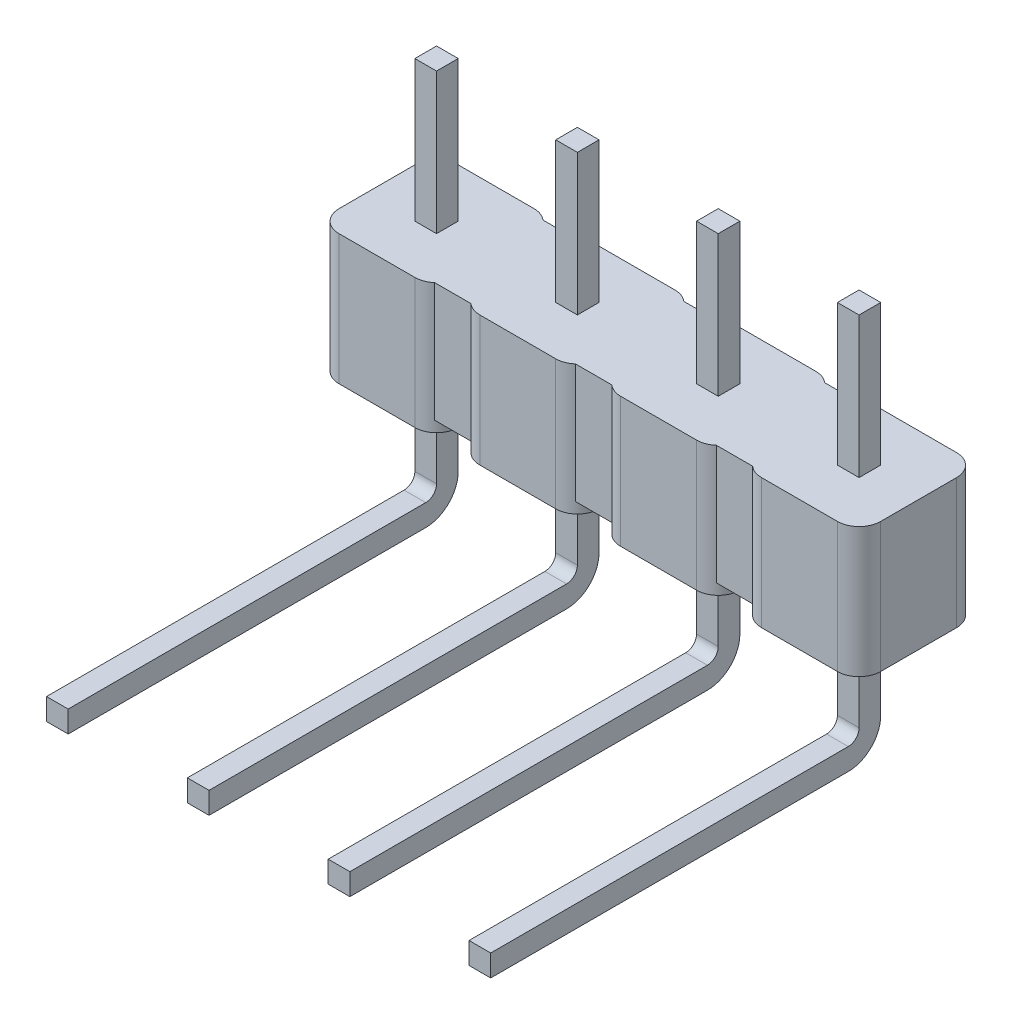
ISO-10303-21;
HEADER;
FILE_DESCRIPTION(('STEP AP214'),'2;1');
FILE_NAME('part.step','',(''),(''),'','','');
FILE_SCHEMA(('AUTOMOTIVE_DESIGN { 1 0 10303 214 1 1 1 1 }'));
ENDSEC;
DATA;
#1=APPLICATION_CONTEXT('core data for automotive mechanical design processes');
#2=APPLICATION_PROTOCOL_DEFINITION('international standard','automotive_design',2000,#1);
#3=PRODUCT_CONTEXT('',#1,'mechanical');
#4=PRODUCT('Part','Part','',(#3));
#5=PRODUCT_RELATED_PRODUCT_CATEGORY('part','',(#4));
#6=PRODUCT_DEFINITION_FORMATION('','',#4);
#7=PRODUCT_DEFINITION_CONTEXT('part definition',#1,'design');
#8=PRODUCT_DEFINITION('design','',#6,#7);
#9=PRODUCT_DEFINITION_SHAPE('','',#8);
#10=(LENGTH_UNIT() NAMED_UNIT(*) SI_UNIT(.MILLI.,.METRE.));
#11=(NAMED_UNIT(*) PLANE_ANGLE_UNIT() SI_UNIT($,.RADIAN.));
#12=(NAMED_UNIT(*) SI_UNIT($,.STERADIAN.) SOLID_ANGLE_UNIT());
#13=UNCERTAINTY_MEASURE_WITH_UNIT(LENGTH_MEASURE(1.E-05),#10,'distance_accuracy_value','');
#14=(GEOMETRIC_REPRESENTATION_CONTEXT(3) GLOBAL_UNCERTAINTY_ASSIGNED_CONTEXT((#13)) GLOBAL_UNIT_ASSIGNED_CONTEXT((#10,
#11,#12)) REPRESENTATION_CONTEXT('',''));
#15=CARTESIAN_POINT('',(0.,0.,0.));
#16=DIRECTION('',(0.,0.,1.));
#17=DIRECTION('',(1.,0.,0.));
#18=AXIS2_PLACEMENT_3D('',#15,#16,#17);
#19=CARTESIAN_POINT('',(1.5,-4.2,7.));
#20=DIRECTION('',(1.,0.,0.));
#21=DIRECTION('',(0.,0.,-1.));
#22=AXIS2_PLACEMENT_3D('',#19,#20,#21);
#23=PLANE('',#22);
#24=CARTESIAN_POINT('',(1.5,-4.,0.4));
#25=DIRECTION('',(1.,0.,0.));
#26=DIRECTION('',(0.,0.,-1.));
#27=AXIS2_PLACEMENT_3D('',#24,#25,#26);
#28=CIRCLE('',#27,0.2);
#29=CARTESIAN_POINT('',(1.5,-4.,0.200000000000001));
#30=VERTEX_POINT('',#29);
#31=CARTESIAN_POINT('',(1.5,-4.2,0.4));
#32=VERTEX_POINT('',#31);
#33=EDGE_CURVE('P0_E21',#30,#32,#28,.F.);
#34=ORIENTED_EDGE('',*,*,#33,.T.);
#35=DIRECTION('',(0.,0.,1.));
#36=VECTOR('',#35,1.);
#37=CARTESIAN_POINT('',(1.5,-4.2,7.));
#38=LINE('',#37,#36);
#39=CARTESIAN_POINT('',(1.5,-4.2,7.));
#40=VERTEX_POINT('',#39);
#41=EDGE_CURVE('P0_E83',#40,#32,#38,.F.);
#42=ORIENTED_EDGE('',*,*,#41,.F.);
#43=DIRECTION('',(0.,1.,0.));
#44=VECTOR('',#43,1.);
#45=CARTESIAN_POINT('',(1.5,-4.4,7.));
#46=LINE('',#45,#44);
#47=CARTESIAN_POINT('',(1.5,-4.6,7.));
#48=VERTEX_POINT('',#47);
#49=EDGE_CURVE('P0_E77',#48,#40,#46,.T.);
#50=ORIENTED_EDGE('',*,*,#49,.F.);
#51=DIRECTION('',(0.,0.,-1.));
#52=VECTOR('',#51,1.);
#53=CARTESIAN_POINT('',(1.5,-4.6,7.));
#54=LINE('',#53,#52);
#55=CARTESIAN_POINT('',(1.5,-4.6,0.4));
#56=VERTEX_POINT('',#55);
#57=EDGE_CURVE('P0_E82',#56,#48,#54,.F.);
#58=ORIENTED_EDGE('',*,*,#57,.F.);
#59=CARTESIAN_POINT('',(1.5,-4.,0.4));
#60=DIRECTION('',(1.,0.,0.));
#61=DIRECTION('',(0.,0.,-1.));
#62=AXIS2_PLACEMENT_3D('',#59,#60,#61);
#63=CIRCLE('',#62,0.6);
#64=CARTESIAN_POINT('',(1.5,-4.,-0.2));
#65=VERTEX_POINT('',#64);
#66=EDGE_CURVE('P0_E94',#65,#56,#63,.F.);
#67=ORIENTED_EDGE('',*,*,#66,.F.);
#68=DIRECTION('',(0.,1.,0.));
#69=VECTOR('',#68,1.);
#70=CARTESIAN_POINT('',(1.5,-4.,-0.2));
#71=LINE('',#70,#69);
#72=CARTESIAN_POINT('',(1.5,2.6,-0.2));
#73=VERTEX_POINT('',#72);
#74=EDGE_CURVE('P0_E109',#73,#65,#71,.F.);
#75=ORIENTED_EDGE('',*,*,#74,.F.);
#76=DIRECTION('',(0.,0.,-1.));
#77=VECTOR('',#76,1.);
#78=CARTESIAN_POINT('',(1.5,2.6,0.));
#79=LINE('',#78,#77);
#80=CARTESIAN_POINT('',(1.5,2.6,0.200000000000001));
#81=VERTEX_POINT('',#80);
#82=EDGE_CURVE('P0_E115',#73,#81,#79,.F.);
#83=ORIENTED_EDGE('',*,*,#82,.T.);
#84=DIRECTION('',(0.,1.,0.));
#85=VECTOR('',#84,1.);
#86=CARTESIAN_POINT('',(1.5,-4.,0.200000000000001));
#87=LINE('',#86,#85);
#88=EDGE_CURVE('P0_E118',#30,#81,#87,.T.);
#89=ORIENTED_EDGE('',*,*,#88,.F.);
#90=EDGE_LOOP('',(#34,#42,#50,#58,#67,#75,#83,#89));
#91=FACE_BOUND('',#90,.T.);
#92=ADVANCED_FACE('P0_F17',(#91),#23,.T.);
#93=CARTESIAN_POINT('',(1.3,-4.4,7.));
#94=DIRECTION('',(0.,0.,1.));
#95=DIRECTION('',(1.,0.,0.));
#96=AXIS2_PLACEMENT_3D('',#93,#94,#95);
#97=PLANE('',#96);
#98=DIRECTION('',(1.,0.,0.));
#99=VECTOR('',#98,1.);
#100=CARTESIAN_POINT('',(1.1,-4.2,7.));
#101=LINE('',#100,#99);
#102=CARTESIAN_POINT('',(1.1,-4.2,7.));
#103=VERTEX_POINT('',#102);
#104=EDGE_CURVE('P0_E85',#103,#40,#101,.T.);
#105=ORIENTED_EDGE('',*,*,#104,.F.);
#106=DIRECTION('',(0.,1.,0.));
#107=VECTOR('',#106,1.);
#108=CARTESIAN_POINT('',(1.1,-4.6,7.));
#109=LINE('',#108,#107);
#110=CARTESIAN_POINT('',(1.1,-4.6,7.));
#111=VERTEX_POINT('',#110);
#112=EDGE_CURVE('P0_E92',#111,#103,#109,.T.);
#113=ORIENTED_EDGE('',*,*,#112,.F.);
#114=DIRECTION('',(1.,0.,0.));
#115=VECTOR('',#114,1.);
#116=CARTESIAN_POINT('',(1.5,-4.6,7.));
#117=LINE('',#116,#115);
#118=EDGE_CURVE('P0_E89',#48,#111,#117,.F.);
#119=ORIENTED_EDGE('',*,*,#118,.F.);
#120=ORIENTED_EDGE('',*,*,#49,.T.);
#121=EDGE_LOOP('',(#105,#113,#119,#120));
#122=FACE_BOUND('',#121,.T.);
#123=ADVANCED_FACE('P0_F90',(#122),#97,.T.);
#124=CARTESIAN_POINT('',(1.1,-4.2,7.));
#125=DIRECTION('',(0.,1.,0.));
#126=DIRECTION('',(0.,0.,1.));
#127=AXIS2_PLACEMENT_3D('',#124,#125,#126);
#128=PLANE('',#127);
#129=DIRECTION('',(1.,0.,0.));
#130=VECTOR('',#129,1.);
#131=CARTESIAN_POINT('',(1.3,-4.2,0.4));
#132=LINE('',#131,#130);
#133=CARTESIAN_POINT('',(1.1,-4.2,0.4));
#134=VERTEX_POINT('',#133);
#135=EDGE_CURVE('P0_E155',#32,#134,#132,.F.);
#136=ORIENTED_EDGE('',*,*,#135,.T.);
#137=DIRECTION('',(0.,0.,1.));
#138=VECTOR('',#137,1.);
#139=CARTESIAN_POINT('',(1.1,-4.2,7.));
#140=LINE('',#139,#138);
#141=EDGE_CURVE('P0_E98',#103,#134,#140,.F.);
#142=ORIENTED_EDGE('',*,*,#141,.F.);
#143=ORIENTED_EDGE('',*,*,#104,.T.);
#144=ORIENTED_EDGE('',*,*,#41,.T.);
#145=EDGE_LOOP('',(#136,#142,#143,#144));
#146=FACE_BOUND('',#145,.T.);
#147=ADVANCED_FACE('P0_F158',(#146),#128,.T.);
#148=CARTESIAN_POINT('',(1.3,-4.,0.4));
#149=DIRECTION('',(1.,0.,0.));
#150=DIRECTION('',(0.,0.,-1.));
#151=AXIS2_PLACEMENT_3D('',#148,#149,#150);
#152=CYLINDRICAL_SURFACE('',#151,0.2);
#153=ORIENTED_EDGE('',*,*,#33,.F.);
#154=DIRECTION('',(1.,0.,0.));
#155=VECTOR('',#154,1.);
#156=CARTESIAN_POINT('',(1.1,-4.,0.200000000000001));
#157=LINE('',#156,#155);
#158=CARTESIAN_POINT('',(1.1,-4.,0.200000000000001));
#159=VERTEX_POINT('',#158);
#160=EDGE_CURVE('P0_E123',#159,#30,#157,.T.);
#161=ORIENTED_EDGE('',*,*,#160,.F.);
#162=CARTESIAN_POINT('',(1.1,-4.,0.4));
#163=DIRECTION('',(1.,0.,0.));
#164=DIRECTION('',(0.,0.,-1.));
#165=AXIS2_PLACEMENT_3D('',#162,#163,#164);
#166=CIRCLE('',#165,0.2);
#167=EDGE_CURVE('P0_E132',#134,#159,#166,.T.);
#168=ORIENTED_EDGE('',*,*,#167,.F.);
#169=ORIENTED_EDGE('',*,*,#135,.F.);
#170=EDGE_LOOP('',(#153,#161,#168,#169));
#171=FACE_BOUND('',#170,.T.);
#172=ADVANCED_FACE('P0_F232',(#171),#152,.F.);
#173=CARTESIAN_POINT('',(1.1,-4.,0.200000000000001));
#174=DIRECTION('',(0.,0.,1.));
#175=DIRECTION('',(1.,0.,0.));
#176=AXIS2_PLACEMENT_3D('',#173,#174,#175);
#177=PLANE('',#176);
#178=DIRECTION('',(1.,0.,0.));
#179=VECTOR('',#178,1.);
#180=CARTESIAN_POINT('',(1.3,2.6,0.200000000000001));
#181=LINE('',#180,#179);
#182=CARTESIAN_POINT('',(1.1,2.6,0.200000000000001));
#183=VERTEX_POINT('',#182);
#184=EDGE_CURVE('P0_E117',#81,#183,#181,.F.);
#185=ORIENTED_EDGE('',*,*,#184,.T.);
#186=DIRECTION('',(0.,1.,0.));
#187=VECTOR('',#186,1.);
#188=CARTESIAN_POINT('',(1.1,-4.6,0.200000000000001));
#189=LINE('',#188,#187);
#190=EDGE_CURVE('P0_E134',#159,#183,#189,.T.);
#191=ORIENTED_EDGE('',*,*,#190,.F.);
#192=ORIENTED_EDGE('',*,*,#160,.T.);
#193=ORIENTED_EDGE('',*,*,#88,.T.);
#194=EDGE_LOOP('',(#185,#191,#192,#193));
#195=FACE_BOUND('',#194,.T.);
#196=ADVANCED_FACE('P0_F225',(#195),#177,.T.);
#197=CARTESIAN_POINT('',(1.3,2.6,0.));
#198=DIRECTION('',(0.,-1.,0.));
#199=DIRECTION('',(0.,0.,-1.));
#200=AXIS2_PLACEMENT_3D('',#197,#198,#199);
#201=PLANE('',#200);
#202=DIRECTION('',(0.,0.,1.));
#203=VECTOR('',#202,1.);
#204=CARTESIAN_POINT('',(1.1,2.6,7.));
#205=LINE('',#204,#203);
#206=CARTESIAN_POINT('',(1.1,2.6,-0.2));
#207=VERTEX_POINT('',#206);
#208=EDGE_CURVE('P0_E144',#183,#207,#205,.F.);
#209=ORIENTED_EDGE('',*,*,#208,.F.);
#210=ORIENTED_EDGE('',*,*,#184,.F.);
#211=ORIENTED_EDGE('',*,*,#82,.F.);
#212=DIRECTION('',(-1.,0.,0.));
#213=VECTOR('',#212,1.);
#214=CARTESIAN_POINT('',(1.5,2.6,-0.2));
#215=LINE('',#214,#213);
#216=EDGE_CURVE('P0_E112',#207,#73,#215,.F.);
#217=ORIENTED_EDGE('',*,*,#216,.F.);
#218=EDGE_LOOP('',(#209,#210,#211,#217));
#219=FACE_BOUND('',#218,.T.);
#220=ADVANCED_FACE('P0_F170',(#219),#201,.F.);
#221=CARTESIAN_POINT('',(1.5,-4.,-0.2));
#222=DIRECTION('',(0.,0.,-1.));
#223=DIRECTION('',(-1.,0.,0.));
#224=AXIS2_PLACEMENT_3D('',#221,#222,#223);
#225=PLANE('',#224);
#226=ORIENTED_EDGE('',*,*,#216,.T.);
#227=ORIENTED_EDGE('',*,*,#74,.T.);
#228=DIRECTION('',(1.,0.,0.));
#229=VECTOR('',#228,1.);
#230=CARTESIAN_POINT('',(1.3,-4.,-0.2));
#231=LINE('',#230,#229);
#232=CARTESIAN_POINT('',(1.1,-4.,-0.2));
#233=VERTEX_POINT('',#232);
#234=EDGE_CURVE('P0_E111',#233,#65,#231,.T.);
#235=ORIENTED_EDGE('',*,*,#234,.F.);
#236=DIRECTION('',(0.,1.,0.));
#237=VECTOR('',#236,1.);
#238=CARTESIAN_POINT('',(1.1,-4.6,-0.2));
#239=LINE('',#238,#237);
#240=EDGE_CURVE('P0_E131',#207,#233,#239,.F.);
#241=ORIENTED_EDGE('',*,*,#240,.F.);
#242=EDGE_LOOP('',(#226,#227,#235,#241));
#243=FACE_BOUND('',#242,.T.);
#244=ADVANCED_FACE('P0_F173',(#243),#225,.T.);
#245=CARTESIAN_POINT('',(1.3,-4.,0.4));
#246=DIRECTION('',(1.,0.,0.));
#247=DIRECTION('',(0.,0.,-1.));
#248=AXIS2_PLACEMENT_3D('',#245,#246,#247);
#249=CYLINDRICAL_SURFACE('',#248,0.6);
#250=ORIENTED_EDGE('',*,*,#234,.T.);
#251=ORIENTED_EDGE('',*,*,#66,.T.);
#252=DIRECTION('',(1.,0.,0.));
#253=VECTOR('',#252,1.);
#254=CARTESIAN_POINT('',(1.5,-4.6,0.4));
#255=LINE('',#254,#253);
#256=CARTESIAN_POINT('',(1.1,-4.6,0.4));
#257=VERTEX_POINT('',#256);
#258=EDGE_CURVE('P0_E36',#257,#56,#255,.T.);
#259=ORIENTED_EDGE('',*,*,#258,.F.);
#260=CARTESIAN_POINT('',(1.1,-4.,0.4));
#261=DIRECTION('',(1.,0.,0.));
#262=DIRECTION('',(0.,0.,-1.));
#263=AXIS2_PLACEMENT_3D('',#260,#261,#262);
#264=CIRCLE('',#263,0.6);
#265=EDGE_CURVE('P0_E27',#233,#257,#264,.F.);
#266=ORIENTED_EDGE('',*,*,#265,.F.);
#267=EDGE_LOOP('',(#250,#251,#259,#266));
#268=FACE_BOUND('',#267,.T.);
#269=ADVANCED_FACE('P0_F191',(#268),#249,.T.);
#270=CARTESIAN_POINT('',(1.5,-4.6,7.));
#271=DIRECTION('',(0.,-1.,0.));
#272=DIRECTION('',(0.,0.,-1.));
#273=AXIS2_PLACEMENT_3D('',#270,#271,#272);
#274=PLANE('',#273);
#275=ORIENTED_EDGE('',*,*,#258,.T.);
#276=ORIENTED_EDGE('',*,*,#57,.T.);
#277=ORIENTED_EDGE('',*,*,#118,.T.);
#278=DIRECTION('',(0.,0.,1.));
#279=VECTOR('',#278,1.);
#280=CARTESIAN_POINT('',(1.1,-4.6,7.));
#281=LINE('',#280,#279);
#282=EDGE_CURVE('P0_E11',#257,#111,#281,.T.);
#283=ORIENTED_EDGE('',*,*,#282,.F.);
#284=EDGE_LOOP('',(#275,#276,#277,#283));
#285=FACE_BOUND('',#284,.T.);
#286=ADVANCED_FACE('P0_F96',(#285),#274,.T.);
#287=CARTESIAN_POINT('',(1.1,-4.6,7.));
#288=DIRECTION('',(-1.,0.,0.));
#289=DIRECTION('',(0.,0.,1.));
#290=AXIS2_PLACEMENT_3D('',#287,#288,#289);
#291=PLANE('',#290);
#292=ORIENTED_EDGE('',*,*,#265,.T.);
#293=ORIENTED_EDGE('',*,*,#282,.T.);
#294=ORIENTED_EDGE('',*,*,#112,.T.);
#295=ORIENTED_EDGE('',*,*,#141,.T.);
#296=ORIENTED_EDGE('',*,*,#167,.T.);
#297=ORIENTED_EDGE('',*,*,#190,.T.);
#298=ORIENTED_EDGE('',*,*,#208,.T.);
#299=ORIENTED_EDGE('',*,*,#240,.T.);
#300=EDGE_LOOP('',(#292,#293,#294,#295,#296,#297,#298,#299));
#301=FACE_BOUND('',#300,.T.);
#302=ADVANCED_FACE('P0_F19',(#301),#291,.T.);
#303=CLOSED_SHELL('',(#92,#123,#147,#172,#196,#220,#244,#269,#286,#302));
#304=MANIFOLD_SOLID_BREP('P0_B1',#303);
#305=CARTESIAN_POINT('',(4.1,-4.2,7.));
#306=DIRECTION('',(1.,0.,0.));
#307=DIRECTION('',(0.,0.,-1.));
#308=AXIS2_PLACEMENT_3D('',#305,#306,#307);
#309=PLANE('',#308);
#310=CARTESIAN_POINT('',(4.1,-4.,0.4));
#311=DIRECTION('',(1.,0.,0.));
#312=DIRECTION('',(0.,0.,-1.));
#313=AXIS2_PLACEMENT_3D('',#310,#311,#312);
#314=CIRCLE('',#313,0.2);
#315=CARTESIAN_POINT('',(4.1,-4.,0.200000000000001));
#316=VERTEX_POINT('',#315);
#317=CARTESIAN_POINT('',(4.1,-4.2,0.4));
#318=VERTEX_POINT('',#317);
#319=EDGE_CURVE('P1_E21',#316,#318,#314,.F.);
#320=ORIENTED_EDGE('',*,*,#319,.T.);
#321=DIRECTION('',(0.,0.,1.));
#322=VECTOR('',#321,1.);
#323=CARTESIAN_POINT('',(4.1,-4.2,7.));
#324=LINE('',#323,#322);
#325=CARTESIAN_POINT('',(4.1,-4.2,7.));
#326=VERTEX_POINT('',#325);
#327=EDGE_CURVE('P1_E83',#326,#318,#324,.F.);
#328=ORIENTED_EDGE('',*,*,#327,.F.);
#329=DIRECTION('',(0.,1.,0.));
#330=VECTOR('',#329,1.);
#331=CARTESIAN_POINT('',(4.1,-4.4,7.));
#332=LINE('',#331,#330);
#333=CARTESIAN_POINT('',(4.1,-4.6,7.));
#334=VERTEX_POINT('',#333);
#335=EDGE_CURVE('P1_E77',#334,#326,#332,.T.);
#336=ORIENTED_EDGE('',*,*,#335,.F.);
#337=DIRECTION('',(0.,0.,-1.));
#338=VECTOR('',#337,1.);
#339=CARTESIAN_POINT('',(4.1,-4.6,7.));
#340=LINE('',#339,#338);
#341=CARTESIAN_POINT('',(4.1,-4.6,0.4));
#342=VERTEX_POINT('',#341);
#343=EDGE_CURVE('P1_E82',#342,#334,#340,.F.);
#344=ORIENTED_EDGE('',*,*,#343,.F.);
#345=CARTESIAN_POINT('',(4.1,-4.,0.4));
#346=DIRECTION('',(1.,0.,0.));
#347=DIRECTION('',(0.,0.,-1.));
#348=AXIS2_PLACEMENT_3D('',#345,#346,#347);
#349=CIRCLE('',#348,0.6);
#350=CARTESIAN_POINT('',(4.1,-4.,-0.2));
#351=VERTEX_POINT('',#350);
#352=EDGE_CURVE('P1_E94',#351,#342,#349,.F.);
#353=ORIENTED_EDGE('',*,*,#352,.F.);
#354=DIRECTION('',(0.,1.,0.));
#355=VECTOR('',#354,1.);
#356=CARTESIAN_POINT('',(4.1,-4.,-0.2));
#357=LINE('',#356,#355);
#358=CARTESIAN_POINT('',(4.1,2.6,-0.2));
#359=VERTEX_POINT('',#358);
#360=EDGE_CURVE('P1_E109',#359,#351,#357,.F.);
#361=ORIENTED_EDGE('',*,*,#360,.F.);
#362=DIRECTION('',(0.,0.,-1.));
#363=VECTOR('',#362,1.);
#364=CARTESIAN_POINT('',(4.1,2.6,0.));
#365=LINE('',#364,#363);
#366=CARTESIAN_POINT('',(4.1,2.6,0.200000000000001));
#367=VERTEX_POINT('',#366);
#368=EDGE_CURVE('P1_E115',#359,#367,#365,.F.);
#369=ORIENTED_EDGE('',*,*,#368,.T.);
#370=DIRECTION('',(0.,1.,0.));
#371=VECTOR('',#370,1.);
#372=CARTESIAN_POINT('',(4.1,-4.,0.200000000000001));
#373=LINE('',#372,#371);
#374=EDGE_CURVE('P1_E118',#316,#367,#373,.T.);
#375=ORIENTED_EDGE('',*,*,#374,.F.);
#376=EDGE_LOOP('',(#320,#328,#336,#344,#353,#361,#369,#375));
#377=FACE_BOUND('',#376,.T.);
#378=ADVANCED_FACE('P1_F17',(#377),#309,.T.);
#379=CARTESIAN_POINT('',(3.9,-4.4,7.));
#380=DIRECTION('',(0.,0.,1.));
#381=DIRECTION('',(1.,0.,0.));
#382=AXIS2_PLACEMENT_3D('',#379,#380,#381);
#383=PLANE('',#382);
#384=DIRECTION('',(1.,0.,0.));
#385=VECTOR('',#384,1.);
#386=CARTESIAN_POINT('',(3.7,-4.2,7.));
#387=LINE('',#386,#385);
#388=CARTESIAN_POINT('',(3.7,-4.2,7.));
#389=VERTEX_POINT('',#388);
#390=EDGE_CURVE('P1_E85',#389,#326,#387,.T.);
#391=ORIENTED_EDGE('',*,*,#390,.F.);
#392=DIRECTION('',(0.,1.,0.));
#393=VECTOR('',#392,1.);
#394=CARTESIAN_POINT('',(3.7,-4.6,7.));
#395=LINE('',#394,#393);
#396=CARTESIAN_POINT('',(3.7,-4.6,7.));
#397=VERTEX_POINT('',#396);
#398=EDGE_CURVE('P1_E92',#397,#389,#395,.T.);
#399=ORIENTED_EDGE('',*,*,#398,.F.);
#400=DIRECTION('',(1.,0.,0.));
#401=VECTOR('',#400,1.);
#402=CARTESIAN_POINT('',(4.1,-4.6,7.));
#403=LINE('',#402,#401);
#404=EDGE_CURVE('P1_E89',#334,#397,#403,.F.);
#405=ORIENTED_EDGE('',*,*,#404,.F.);
#406=ORIENTED_EDGE('',*,*,#335,.T.);
#407=EDGE_LOOP('',(#391,#399,#405,#406));
#408=FACE_BOUND('',#407,.T.);
#409=ADVANCED_FACE('P1_F90',(#408),#383,.T.);
#410=CARTESIAN_POINT('',(3.7,-4.2,7.));
#411=DIRECTION('',(0.,1.,0.));
#412=DIRECTION('',(0.,0.,1.));
#413=AXIS2_PLACEMENT_3D('',#410,#411,#412);
#414=PLANE('',#413);
#415=DIRECTION('',(1.,0.,0.));
#416=VECTOR('',#415,1.);
#417=CARTESIAN_POINT('',(3.9,-4.2,0.4));
#418=LINE('',#417,#416);
#419=CARTESIAN_POINT('',(3.7,-4.2,0.4));
#420=VERTEX_POINT('',#419);
#421=EDGE_CURVE('P1_E155',#318,#420,#418,.F.);
#422=ORIENTED_EDGE('',*,*,#421,.T.);
#423=DIRECTION('',(0.,0.,1.));
#424=VECTOR('',#423,1.);
#425=CARTESIAN_POINT('',(3.7,-4.2,7.));
#426=LINE('',#425,#424);
#427=EDGE_CURVE('P1_E98',#389,#420,#426,.F.);
#428=ORIENTED_EDGE('',*,*,#427,.F.);
#429=ORIENTED_EDGE('',*,*,#390,.T.);
#430=ORIENTED_EDGE('',*,*,#327,.T.);
#431=EDGE_LOOP('',(#422,#428,#429,#430));
#432=FACE_BOUND('',#431,.T.);
#433=ADVANCED_FACE('P1_F158',(#432),#414,.T.);
#434=CARTESIAN_POINT('',(3.9,-4.,0.4));
#435=DIRECTION('',(1.,0.,0.));
#436=DIRECTION('',(0.,0.,-1.));
#437=AXIS2_PLACEMENT_3D('',#434,#435,#436);
#438=CYLINDRICAL_SURFACE('',#437,0.2);
#439=ORIENTED_EDGE('',*,*,#319,.F.);
#440=DIRECTION('',(1.,0.,0.));
#441=VECTOR('',#440,1.);
#442=CARTESIAN_POINT('',(3.7,-4.,0.200000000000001));
#443=LINE('',#442,#441);
#444=CARTESIAN_POINT('',(3.7,-4.,0.200000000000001));
#445=VERTEX_POINT('',#444);
#446=EDGE_CURVE('P1_E123',#445,#316,#443,.T.);
#447=ORIENTED_EDGE('',*,*,#446,.F.);
#448=CARTESIAN_POINT('',(3.7,-4.,0.4));
#449=DIRECTION('',(1.,0.,0.));
#450=DIRECTION('',(0.,0.,-1.));
#451=AXIS2_PLACEMENT_3D('',#448,#449,#450);
#452=CIRCLE('',#451,0.2);
#453=EDGE_CURVE('P1_E132',#420,#445,#452,.T.);
#454=ORIENTED_EDGE('',*,*,#453,.F.);
#455=ORIENTED_EDGE('',*,*,#421,.F.);
#456=EDGE_LOOP('',(#439,#447,#454,#455));
#457=FACE_BOUND('',#456,.T.);
#458=ADVANCED_FACE('P1_F232',(#457),#438,.F.);
#459=CARTESIAN_POINT('',(3.7,-4.,0.200000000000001));
#460=DIRECTION('',(0.,0.,1.));
#461=DIRECTION('',(1.,0.,0.));
#462=AXIS2_PLACEMENT_3D('',#459,#460,#461);
#463=PLANE('',#462);
#464=DIRECTION('',(1.,0.,0.));
#465=VECTOR('',#464,1.);
#466=CARTESIAN_POINT('',(3.9,2.6,0.200000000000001));
#467=LINE('',#466,#465);
#468=CARTESIAN_POINT('',(3.7,2.6,0.200000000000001));
#469=VERTEX_POINT('',#468);
#470=EDGE_CURVE('P1_E117',#367,#469,#467,.F.);
#471=ORIENTED_EDGE('',*,*,#470,.T.);
#472=DIRECTION('',(0.,1.,0.));
#473=VECTOR('',#472,1.);
#474=CARTESIAN_POINT('',(3.7,-4.6,0.200000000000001));
#475=LINE('',#474,#473);
#476=EDGE_CURVE('P1_E134',#445,#469,#475,.T.);
#477=ORIENTED_EDGE('',*,*,#476,.F.);
#478=ORIENTED_EDGE('',*,*,#446,.T.);
#479=ORIENTED_EDGE('',*,*,#374,.T.);
#480=EDGE_LOOP('',(#471,#477,#478,#479));
#481=FACE_BOUND('',#480,.T.);
#482=ADVANCED_FACE('P1_F225',(#481),#463,.T.);
#483=CARTESIAN_POINT('',(3.9,2.6,0.));
#484=DIRECTION('',(0.,-1.,0.));
#485=DIRECTION('',(0.,0.,-1.));
#486=AXIS2_PLACEMENT_3D('',#483,#484,#485);
#487=PLANE('',#486);
#488=DIRECTION('',(0.,0.,1.));
#489=VECTOR('',#488,1.);
#490=CARTESIAN_POINT('',(3.7,2.6,7.));
#491=LINE('',#490,#489);
#492=CARTESIAN_POINT('',(3.7,2.6,-0.2));
#493=VERTEX_POINT('',#492);
#494=EDGE_CURVE('P1_E144',#469,#493,#491,.F.);
#495=ORIENTED_EDGE('',*,*,#494,.F.);
#496=ORIENTED_EDGE('',*,*,#470,.F.);
#497=ORIENTED_EDGE('',*,*,#368,.F.);
#498=DIRECTION('',(-1.,0.,0.));
#499=VECTOR('',#498,1.);
#500=CARTESIAN_POINT('',(4.1,2.6,-0.2));
#501=LINE('',#500,#499);
#502=EDGE_CURVE('P1_E112',#493,#359,#501,.F.);
#503=ORIENTED_EDGE('',*,*,#502,.F.);
#504=EDGE_LOOP('',(#495,#496,#497,#503));
#505=FACE_BOUND('',#504,.T.);
#506=ADVANCED_FACE('P1_F170',(#505),#487,.F.);
#507=CARTESIAN_POINT('',(4.1,-4.,-0.2));
#508=DIRECTION('',(0.,0.,-1.));
#509=DIRECTION('',(-1.,0.,0.));
#510=AXIS2_PLACEMENT_3D('',#507,#508,#509);
#511=PLANE('',#510);
#512=ORIENTED_EDGE('',*,*,#502,.T.);
#513=ORIENTED_EDGE('',*,*,#360,.T.);
#514=DIRECTION('',(1.,0.,0.));
#515=VECTOR('',#514,1.);
#516=CARTESIAN_POINT('',(3.9,-4.,-0.2));
#517=LINE('',#516,#515);
#518=CARTESIAN_POINT('',(3.7,-4.,-0.2));
#519=VERTEX_POINT('',#518);
#520=EDGE_CURVE('P1_E111',#519,#351,#517,.T.);
#521=ORIENTED_EDGE('',*,*,#520,.F.);
#522=DIRECTION('',(0.,1.,0.));
#523=VECTOR('',#522,1.);
#524=CARTESIAN_POINT('',(3.7,-4.6,-0.2));
#525=LINE('',#524,#523);
#526=EDGE_CURVE('P1_E131',#493,#519,#525,.F.);
#527=ORIENTED_EDGE('',*,*,#526,.F.);
#528=EDGE_LOOP('',(#512,#513,#521,#527));
#529=FACE_BOUND('',#528,.T.);
#530=ADVANCED_FACE('P1_F173',(#529),#511,.T.);
#531=CARTESIAN_POINT('',(3.9,-4.,0.4));
#532=DIRECTION('',(1.,0.,0.));
#533=DIRECTION('',(0.,0.,-1.));
#534=AXIS2_PLACEMENT_3D('',#531,#532,#533);
#535=CYLINDRICAL_SURFACE('',#534,0.6);
#536=ORIENTED_EDGE('',*,*,#520,.T.);
#537=ORIENTED_EDGE('',*,*,#352,.T.);
#538=DIRECTION('',(1.,0.,0.));
#539=VECTOR('',#538,1.);
#540=CARTESIAN_POINT('',(4.1,-4.6,0.4));
#541=LINE('',#540,#539);
#542=CARTESIAN_POINT('',(3.7,-4.6,0.4));
#543=VERTEX_POINT('',#542);
#544=EDGE_CURVE('P1_E36',#543,#342,#541,.T.);
#545=ORIENTED_EDGE('',*,*,#544,.F.);
#546=CARTESIAN_POINT('',(3.7,-4.,0.4));
#547=DIRECTION('',(1.,0.,0.));
#548=DIRECTION('',(0.,0.,-1.));
#549=AXIS2_PLACEMENT_3D('',#546,#547,#548);
#550=CIRCLE('',#549,0.6);
#551=EDGE_CURVE('P1_E27',#519,#543,#550,.F.);
#552=ORIENTED_EDGE('',*,*,#551,.F.);
#553=EDGE_LOOP('',(#536,#537,#545,#552));
#554=FACE_BOUND('',#553,.T.);
#555=ADVANCED_FACE('P1_F191',(#554),#535,.T.);
#556=CARTESIAN_POINT('',(4.1,-4.6,7.));
#557=DIRECTION('',(0.,-1.,0.));
#558=DIRECTION('',(0.,0.,-1.));
#559=AXIS2_PLACEMENT_3D('',#556,#557,#558);
#560=PLANE('',#559);
#561=ORIENTED_EDGE('',*,*,#544,.T.);
#562=ORIENTED_EDGE('',*,*,#343,.T.);
#563=ORIENTED_EDGE('',*,*,#404,.T.);
#564=DIRECTION('',(0.,0.,1.));
#565=VECTOR('',#564,1.);
#566=CARTESIAN_POINT('',(3.7,-4.6,7.));
#567=LINE('',#566,#565);
#568=EDGE_CURVE('P1_E11',#543,#397,#567,.T.);
#569=ORIENTED_EDGE('',*,*,#568,.F.);
#570=EDGE_LOOP('',(#561,#562,#563,#569));
#571=FACE_BOUND('',#570,.T.);
#572=ADVANCED_FACE('P1_F96',(#571),#560,.T.);
#573=CARTESIAN_POINT('',(3.7,-4.6,7.));
#574=DIRECTION('',(-1.,0.,0.));
#575=DIRECTION('',(0.,0.,1.));
#576=AXIS2_PLACEMENT_3D('',#573,#574,#575);
#577=PLANE('',#576);
#578=ORIENTED_EDGE('',*,*,#551,.T.);
#579=ORIENTED_EDGE('',*,*,#568,.T.);
#580=ORIENTED_EDGE('',*,*,#398,.T.);
#581=ORIENTED_EDGE('',*,*,#427,.T.);
#582=ORIENTED_EDGE('',*,*,#453,.T.);
#583=ORIENTED_EDGE('',*,*,#476,.T.);
#584=ORIENTED_EDGE('',*,*,#494,.T.);
#585=ORIENTED_EDGE('',*,*,#526,.T.);
#586=EDGE_LOOP('',(#578,#579,#580,#581,#582,#583,#584,#585));
#587=FACE_BOUND('',#586,.T.);
#588=ADVANCED_FACE('P1_F19',(#587),#577,.T.);
#589=CLOSED_SHELL('',(#378,#409,#433,#458,#482,#506,#530,#555,#572,#588));
#590=MANIFOLD_SOLID_BREP('P1_B1',#589);
#591=CARTESIAN_POINT('',(-3.7,-4.2,7.));
#592=DIRECTION('',(1.,0.,0.));
#593=DIRECTION('',(0.,0.,-1.));
#594=AXIS2_PLACEMENT_3D('',#591,#592,#593);
#595=PLANE('',#594);
#596=CARTESIAN_POINT('',(-3.7,-4.,0.4));
#597=DIRECTION('',(1.,0.,0.));
#598=DIRECTION('',(0.,0.,-1.));
#599=AXIS2_PLACEMENT_3D('',#596,#597,#598);
#600=CIRCLE('',#599,0.2);
#601=CARTESIAN_POINT('',(-3.7,-4.,0.200000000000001));
#602=VERTEX_POINT('',#601);
#603=CARTESIAN_POINT('',(-3.7,-4.2,0.4));
#604=VERTEX_POINT('',#603);
#605=EDGE_CURVE('P2_E21',#602,#604,#600,.F.);
#606=ORIENTED_EDGE('',*,*,#605,.T.);
#607=DIRECTION('',(0.,0.,1.));
#608=VECTOR('',#607,1.);
#609=CARTESIAN_POINT('',(-3.7,-4.2,7.));
#610=LINE('',#609,#608);
#611=CARTESIAN_POINT('',(-3.7,-4.2,7.));
#612=VERTEX_POINT('',#611);
#613=EDGE_CURVE('P2_E83',#612,#604,#610,.F.);
#614=ORIENTED_EDGE('',*,*,#613,.F.);
#615=DIRECTION('',(0.,1.,0.));
#616=VECTOR('',#615,1.);
#617=CARTESIAN_POINT('',(-3.7,-4.4,7.));
#618=LINE('',#617,#616);
#619=CARTESIAN_POINT('',(-3.7,-4.6,7.));
#620=VERTEX_POINT('',#619);
#621=EDGE_CURVE('P2_E77',#620,#612,#618,.T.);
#622=ORIENTED_EDGE('',*,*,#621,.F.);
#623=DIRECTION('',(0.,0.,-1.));
#624=VECTOR('',#623,1.);
#625=CARTESIAN_POINT('',(-3.7,-4.6,7.));
#626=LINE('',#625,#624);
#627=CARTESIAN_POINT('',(-3.7,-4.6,0.4));
#628=VERTEX_POINT('',#627);
#629=EDGE_CURVE('P2_E82',#628,#620,#626,.F.);
#630=ORIENTED_EDGE('',*,*,#629,.F.);
#631=CARTESIAN_POINT('',(-3.7,-4.,0.4));
#632=DIRECTION('',(1.,0.,0.));
#633=DIRECTION('',(0.,0.,-1.));
#634=AXIS2_PLACEMENT_3D('',#631,#632,#633);
#635=CIRCLE('',#634,0.6);
#636=CARTESIAN_POINT('',(-3.7,-4.,-0.2));
#637=VERTEX_POINT('',#636);
#638=EDGE_CURVE('P2_E94',#637,#628,#635,.F.);
#639=ORIENTED_EDGE('',*,*,#638,.F.);
#640=DIRECTION('',(0.,1.,0.));
#641=VECTOR('',#640,1.);
#642=CARTESIAN_POINT('',(-3.7,-4.,-0.2));
#643=LINE('',#642,#641);
#644=CARTESIAN_POINT('',(-3.7,2.6,-0.2));
#645=VERTEX_POINT('',#644);
#646=EDGE_CURVE('P2_E109',#645,#637,#643,.F.);
#647=ORIENTED_EDGE('',*,*,#646,.F.);
#648=DIRECTION('',(0.,0.,-1.));
#649=VECTOR('',#648,1.);
#650=CARTESIAN_POINT('',(-3.7,2.6,0.));
#651=LINE('',#650,#649);
#652=CARTESIAN_POINT('',(-3.7,2.6,0.200000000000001));
#653=VERTEX_POINT('',#652);
#654=EDGE_CURVE('P2_E115',#645,#653,#651,.F.);
#655=ORIENTED_EDGE('',*,*,#654,.T.);
#656=DIRECTION('',(0.,1.,0.));
#657=VECTOR('',#656,1.);
#658=CARTESIAN_POINT('',(-3.7,-4.,0.200000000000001));
#659=LINE('',#658,#657);
#660=EDGE_CURVE('P2_E118',#602,#653,#659,.T.);
#661=ORIENTED_EDGE('',*,*,#660,.F.);
#662=EDGE_LOOP('',(#606,#614,#622,#630,#639,#647,#655,#661));
#663=FACE_BOUND('',#662,.T.);
#664=ADVANCED_FACE('P2_F17',(#663),#595,.T.);
#665=CARTESIAN_POINT('',(-3.9,-4.4,7.));
#666=DIRECTION('',(0.,0.,1.));
#667=DIRECTION('',(1.,0.,0.));
#668=AXIS2_PLACEMENT_3D('',#665,#666,#667);
#669=PLANE('',#668);
#670=DIRECTION('',(1.,0.,0.));
#671=VECTOR('',#670,1.);
#672=CARTESIAN_POINT('',(-4.1,-4.2,7.));
#673=LINE('',#672,#671);
#674=CARTESIAN_POINT('',(-4.1,-4.2,7.));
#675=VERTEX_POINT('',#674);
#676=EDGE_CURVE('P2_E85',#675,#612,#673,.T.);
#677=ORIENTED_EDGE('',*,*,#676,.F.);
#678=DIRECTION('',(0.,1.,0.));
#679=VECTOR('',#678,1.);
#680=CARTESIAN_POINT('',(-4.1,-4.6,7.));
#681=LINE('',#680,#679);
#682=CARTESIAN_POINT('',(-4.1,-4.6,7.));
#683=VERTEX_POINT('',#682);
#684=EDGE_CURVE('P2_E92',#683,#675,#681,.T.);
#685=ORIENTED_EDGE('',*,*,#684,.F.);
#686=DIRECTION('',(1.,0.,0.));
#687=VECTOR('',#686,1.);
#688=CARTESIAN_POINT('',(-3.7,-4.6,7.));
#689=LINE('',#688,#687);
#690=EDGE_CURVE('P2_E89',#620,#683,#689,.F.);
#691=ORIENTED_EDGE('',*,*,#690,.F.);
#692=ORIENTED_EDGE('',*,*,#621,.T.);
#693=EDGE_LOOP('',(#677,#685,#691,#692));
#694=FACE_BOUND('',#693,.T.);
#695=ADVANCED_FACE('P2_F90',(#694),#669,.T.);
#696=CARTESIAN_POINT('',(-4.1,-4.2,7.));
#697=DIRECTION('',(0.,1.,0.));
#698=DIRECTION('',(0.,0.,1.));
#699=AXIS2_PLACEMENT_3D('',#696,#697,#698);
#700=PLANE('',#699);
#701=DIRECTION('',(1.,0.,0.));
#702=VECTOR('',#701,1.);
#703=CARTESIAN_POINT('',(-3.9,-4.2,0.4));
#704=LINE('',#703,#702);
#705=CARTESIAN_POINT('',(-4.1,-4.2,0.4));
#706=VERTEX_POINT('',#705);
#707=EDGE_CURVE('P2_E155',#604,#706,#704,.F.);
#708=ORIENTED_EDGE('',*,*,#707,.T.);
#709=DIRECTION('',(0.,0.,1.));
#710=VECTOR('',#709,1.);
#711=CARTESIAN_POINT('',(-4.1,-4.2,7.));
#712=LINE('',#711,#710);
#713=EDGE_CURVE('P2_E98',#675,#706,#712,.F.);
#714=ORIENTED_EDGE('',*,*,#713,.F.);
#715=ORIENTED_EDGE('',*,*,#676,.T.);
#716=ORIENTED_EDGE('',*,*,#613,.T.);
#717=EDGE_LOOP('',(#708,#714,#715,#716));
#718=FACE_BOUND('',#717,.T.);
#719=ADVANCED_FACE('P2_F158',(#718),#700,.T.);
#720=CARTESIAN_POINT('',(-3.9,-4.,0.4));
#721=DIRECTION('',(1.,0.,0.));
#722=DIRECTION('',(0.,0.,-1.));
#723=AXIS2_PLACEMENT_3D('',#720,#721,#722);
#724=CYLINDRICAL_SURFACE('',#723,0.2);
#725=ORIENTED_EDGE('',*,*,#605,.F.);
#726=DIRECTION('',(1.,0.,0.));
#727=VECTOR('',#726,1.);
#728=CARTESIAN_POINT('',(-4.1,-4.,0.200000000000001));
#729=LINE('',#728,#727);
#730=CARTESIAN_POINT('',(-4.1,-4.,0.200000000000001));
#731=VERTEX_POINT('',#730);
#732=EDGE_CURVE('P2_E123',#731,#602,#729,.T.);
#733=ORIENTED_EDGE('',*,*,#732,.F.);
#734=CARTESIAN_POINT('',(-4.1,-4.,0.4));
#735=DIRECTION('',(1.,0.,0.));
#736=DIRECTION('',(0.,0.,-1.));
#737=AXIS2_PLACEMENT_3D('',#734,#735,#736);
#738=CIRCLE('',#737,0.2);
#739=EDGE_CURVE('P2_E132',#706,#731,#738,.T.);
#740=ORIENTED_EDGE('',*,*,#739,.F.);
#741=ORIENTED_EDGE('',*,*,#707,.F.);
#742=EDGE_LOOP('',(#725,#733,#740,#741));
#743=FACE_BOUND('',#742,.T.);
#744=ADVANCED_FACE('P2_F232',(#743),#724,.F.);
#745=CARTESIAN_POINT('',(-4.1,-4.,0.200000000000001));
#746=DIRECTION('',(0.,0.,1.));
#747=DIRECTION('',(1.,0.,0.));
#748=AXIS2_PLACEMENT_3D('',#745,#746,#747);
#749=PLANE('',#748);
#750=DIRECTION('',(1.,0.,0.));
#751=VECTOR('',#750,1.);
#752=CARTESIAN_POINT('',(-3.9,2.6,0.200000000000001));
#753=LINE('',#752,#751);
#754=CARTESIAN_POINT('',(-4.1,2.6,0.200000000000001));
#755=VERTEX_POINT('',#754);
#756=EDGE_CURVE('P2_E117',#653,#755,#753,.F.);
#757=ORIENTED_EDGE('',*,*,#756,.T.);
#758=DIRECTION('',(0.,1.,0.));
#759=VECTOR('',#758,1.);
#760=CARTESIAN_POINT('',(-4.1,-4.6,0.200000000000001));
#761=LINE('',#760,#759);
#762=EDGE_CURVE('P2_E134',#731,#755,#761,.T.);
#763=ORIENTED_EDGE('',*,*,#762,.F.);
#764=ORIENTED_EDGE('',*,*,#732,.T.);
#765=ORIENTED_EDGE('',*,*,#660,.T.);
#766=EDGE_LOOP('',(#757,#763,#764,#765));
#767=FACE_BOUND('',#766,.T.);
#768=ADVANCED_FACE('P2_F225',(#767),#749,.T.);
#769=CARTESIAN_POINT('',(-3.9,2.6,0.));
#770=DIRECTION('',(0.,-1.,0.));
#771=DIRECTION('',(0.,0.,-1.));
#772=AXIS2_PLACEMENT_3D('',#769,#770,#771);
#773=PLANE('',#772);
#774=DIRECTION('',(0.,0.,1.));
#775=VECTOR('',#774,1.);
#776=CARTESIAN_POINT('',(-4.1,2.6,7.));
#777=LINE('',#776,#775);
#778=CARTESIAN_POINT('',(-4.1,2.6,-0.2));
#779=VERTEX_POINT('',#778);
#780=EDGE_CURVE('P2_E144',#755,#779,#777,.F.);
#781=ORIENTED_EDGE('',*,*,#780,.F.);
#782=ORIENTED_EDGE('',*,*,#756,.F.);
#783=ORIENTED_EDGE('',*,*,#654,.F.);
#784=DIRECTION('',(-1.,0.,0.));
#785=VECTOR('',#784,1.);
#786=CARTESIAN_POINT('',(-3.7,2.6,-0.2));
#787=LINE('',#786,#785);
#788=EDGE_CURVE('P2_E112',#779,#645,#787,.F.);
#789=ORIENTED_EDGE('',*,*,#788,.F.);
#790=EDGE_LOOP('',(#781,#782,#783,#789));
#791=FACE_BOUND('',#790,.T.);
#792=ADVANCED_FACE('P2_F170',(#791),#773,.F.);
#793=CARTESIAN_POINT('',(-3.7,-4.,-0.2));
#794=DIRECTION('',(0.,0.,-1.));
#795=DIRECTION('',(-1.,0.,0.));
#796=AXIS2_PLACEMENT_3D('',#793,#794,#795);
#797=PLANE('',#796);
#798=ORIENTED_EDGE('',*,*,#788,.T.);
#799=ORIENTED_EDGE('',*,*,#646,.T.);
#800=DIRECTION('',(1.,0.,0.));
#801=VECTOR('',#800,1.);
#802=CARTESIAN_POINT('',(-3.9,-4.,-0.2));
#803=LINE('',#802,#801);
#804=CARTESIAN_POINT('',(-4.1,-4.,-0.2));
#805=VERTEX_POINT('',#804);
#806=EDGE_CURVE('P2_E111',#805,#637,#803,.T.);
#807=ORIENTED_EDGE('',*,*,#806,.F.);
#808=DIRECTION('',(0.,1.,0.));
#809=VECTOR('',#808,1.);
#810=CARTESIAN_POINT('',(-4.1,-4.6,-0.2));
#811=LINE('',#810,#809);
#812=EDGE_CURVE('P2_E131',#779,#805,#811,.F.);
#813=ORIENTED_EDGE('',*,*,#812,.F.);
#814=EDGE_LOOP('',(#798,#799,#807,#813));
#815=FACE_BOUND('',#814,.T.);
#816=ADVANCED_FACE('P2_F173',(#815),#797,.T.);
#817=CARTESIAN_POINT('',(-3.9,-4.,0.4));
#818=DIRECTION('',(1.,0.,0.));
#819=DIRECTION('',(0.,0.,-1.));
#820=AXIS2_PLACEMENT_3D('',#817,#818,#819);
#821=CYLINDRICAL_SURFACE('',#820,0.6);
#822=ORIENTED_EDGE('',*,*,#806,.T.);
#823=ORIENTED_EDGE('',*,*,#638,.T.);
#824=DIRECTION('',(1.,0.,0.));
#825=VECTOR('',#824,1.);
#826=CARTESIAN_POINT('',(-3.7,-4.6,0.4));
#827=LINE('',#826,#825);
#828=CARTESIAN_POINT('',(-4.1,-4.6,0.4));
#829=VERTEX_POINT('',#828);
#830=EDGE_CURVE('P2_E36',#829,#628,#827,.T.);
#831=ORIENTED_EDGE('',*,*,#830,.F.);
#832=CARTESIAN_POINT('',(-4.1,-4.,0.4));
#833=DIRECTION('',(1.,0.,0.));
#834=DIRECTION('',(0.,0.,-1.));
#835=AXIS2_PLACEMENT_3D('',#832,#833,#834);
#836=CIRCLE('',#835,0.6);
#837=EDGE_CURVE('P2_E27',#805,#829,#836,.F.);
#838=ORIENTED_EDGE('',*,*,#837,.F.);
#839=EDGE_LOOP('',(#822,#823,#831,#838));
#840=FACE_BOUND('',#839,.T.);
#841=ADVANCED_FACE('P2_F191',(#840),#821,.T.);
#842=CARTESIAN_POINT('',(-3.7,-4.6,7.));
#843=DIRECTION('',(0.,-1.,0.));
#844=DIRECTION('',(0.,0.,-1.));
#845=AXIS2_PLACEMENT_3D('',#842,#843,#844);
#846=PLANE('',#845);
#847=ORIENTED_EDGE('',*,*,#830,.T.);
#848=ORIENTED_EDGE('',*,*,#629,.T.);
#849=ORIENTED_EDGE('',*,*,#690,.T.);
#850=DIRECTION('',(0.,0.,1.));
#851=VECTOR('',#850,1.);
#852=CARTESIAN_POINT('',(-4.1,-4.6,7.));
#853=LINE('',#852,#851);
#854=EDGE_CURVE('P2_E11',#829,#683,#853,.T.);
#855=ORIENTED_EDGE('',*,*,#854,.F.);
#856=EDGE_LOOP('',(#847,#848,#849,#855));
#857=FACE_BOUND('',#856,.T.);
#858=ADVANCED_FACE('P2_F96',(#857),#846,.T.);
#859=CARTESIAN_POINT('',(-4.1,-4.6,7.));
#860=DIRECTION('',(-1.,0.,0.));
#861=DIRECTION('',(0.,0.,1.));
#862=AXIS2_PLACEMENT_3D('',#859,#860,#861);
#863=PLANE('',#862);
#864=ORIENTED_EDGE('',*,*,#837,.T.);
#865=ORIENTED_EDGE('',*,*,#854,.T.);
#866=ORIENTED_EDGE('',*,*,#684,.T.);
#867=ORIENTED_EDGE('',*,*,#713,.T.);
#868=ORIENTED_EDGE('',*,*,#739,.T.);
#869=ORIENTED_EDGE('',*,*,#762,.T.);
#870=ORIENTED_EDGE('',*,*,#780,.T.);
#871=ORIENTED_EDGE('',*,*,#812,.T.);
#872=EDGE_LOOP('',(#864,#865,#866,#867,#868,#869,#870,#871));
#873=FACE_BOUND('',#872,.T.);
#874=ADVANCED_FACE('P2_F19',(#873),#863,.T.);
#875=CLOSED_SHELL('',(#664,#695,#719,#744,#768,#792,#816,#841,#858,#874));
#876=MANIFOLD_SOLID_BREP('P2_B1',#875);
#877=CARTESIAN_POINT('',(3.2,0.,0.7));
#878=DIRECTION('',(0.,-1.,0.));
#879=DIRECTION('',(0.,0.,-1.));
#880=AXIS2_PLACEMENT_3D('',#877,#878,#879);
#881=CYLINDRICAL_SURFACE('',#880,0.4);
#882=CARTESIAN_POINT('',(3.2,0.,0.7));
#883=DIRECTION('',(0.,-1.,0.));
#884=DIRECTION('',(0.,0.,-1.));
#885=AXIS2_PLACEMENT_3D('',#882,#883,#884);
#886=CIRCLE('',#885,0.4);
#887=CARTESIAN_POINT('',(3.2,0.,1.1));
#888=VERTEX_POINT('',#887);
#889=CARTESIAN_POINT('',(2.93542486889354,0.,1.));
#890=VERTEX_POINT('',#889);
#891=EDGE_CURVE('P3_E347',#888,#890,#886,.T.);
#892=ORIENTED_EDGE('',*,*,#891,.T.);
#893=DIRECTION('',(0.,1.,0.));
#894=VECTOR('',#893,1.);
#895=CARTESIAN_POINT('',(2.93542486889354,0.,1.));
#896=LINE('',#895,#894);
#897=CARTESIAN_POINT('',(2.93542486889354,-2.2,1.));
#898=VERTEX_POINT('',#897);
#899=EDGE_CURVE('P3_E345',#898,#890,#896,.T.);
#900=ORIENTED_EDGE('',*,*,#899,.F.);
#901=CARTESIAN_POINT('',(3.2,-2.2,0.7));
#902=DIRECTION('',(0.,-1.,0.));
#903=DIRECTION('',(0.,0.,-1.));
#904=AXIS2_PLACEMENT_3D('',#901,#902,#903);
#905=CIRCLE('',#904,0.4);
#906=CARTESIAN_POINT('',(2.8,-2.2,0.7));
#907=VERTEX_POINT('',#906);
#908=EDGE_CURVE('P3_E21',#898,#907,#905,.T.);
#909=ORIENTED_EDGE('',*,*,#908,.T.);
#910=DIRECTION('',(0.,-1.,0.));
#911=VECTOR('',#910,1.);
#912=CARTESIAN_POINT('',(2.8,0.,0.7));
#913=LINE('',#912,#911);
#914=CARTESIAN_POINT('',(2.8,-2.4,0.7));
#915=VERTEX_POINT('',#914);
#916=EDGE_CURVE('P3_E343',#907,#915,#913,.T.);
#917=ORIENTED_EDGE('',*,*,#916,.T.);
#918=CARTESIAN_POINT('',(3.2,-2.4,0.7));
#919=DIRECTION('',(0.,-1.,0.));
#920=DIRECTION('',(0.,0.,-1.));
#921=AXIS2_PLACEMENT_3D('',#918,#919,#920);
#922=CIRCLE('',#921,0.4);
#923=CARTESIAN_POINT('',(3.2,-2.4,1.1));
#924=VERTEX_POINT('',#923);
#925=EDGE_CURVE('P3_E365',#915,#924,#922,.F.);
#926=ORIENTED_EDGE('',*,*,#925,.T.);
#927=DIRECTION('',(0.,1.,0.));
#928=VECTOR('',#927,1.);
#929=CARTESIAN_POINT('',(3.2,0.,1.1));
#930=LINE('',#929,#928);
#931=EDGE_CURVE('P3_E356',#888,#924,#930,.F.);
#932=ORIENTED_EDGE('',*,*,#931,.F.);
#933=EDGE_LOOP('',(#892,#900,#909,#917,#926,#932));
#934=FACE_BOUND('',#933,.T.);
#935=ADVANCED_FACE('P3_F17',(#934),#881,.T.);
#936=CARTESIAN_POINT('',(4.86457513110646,0.,1.));
#937=DIRECTION('',(0.,0.,1.));
#938=DIRECTION('',(1.,0.,0.));
#939=AXIS2_PLACEMENT_3D('',#936,#937,#938);
#940=PLANE('',#939);
#941=DIRECTION('',(0.,-1.,0.));
#942=VECTOR('',#941,1.);
#943=CARTESIAN_POINT('',(2.26457513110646,0.,0.999999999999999));
#944=LINE('',#943,#942);
#945=CARTESIAN_POINT('',(2.26457513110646,-2.2,1.));
#946=VERTEX_POINT('',#945);
#947=CARTESIAN_POINT('',(2.26457513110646,0.,1.));
#948=VERTEX_POINT('',#947);
#949=EDGE_CURVE('P3_E354',#946,#948,#944,.F.);
#950=ORIENTED_EDGE('',*,*,#949,.F.);
#951=DIRECTION('',(1.,0.,0.));
#952=VECTOR('',#951,1.);
#953=CARTESIAN_POINT('',(4.86457513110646,-2.2,1.));
#954=LINE('',#953,#952);
#955=EDGE_CURVE('P3_E337',#946,#898,#954,.T.);
#956=ORIENTED_EDGE('',*,*,#955,.T.);
#957=ORIENTED_EDGE('',*,*,#899,.T.);
#958=DIRECTION('',(1.,0.,0.));
#959=VECTOR('',#958,1.);
#960=CARTESIAN_POINT('',(4.86457513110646,0.,1.));
#961=LINE('',#960,#959);
#962=EDGE_CURVE('P3_E350',#890,#948,#961,.F.);
#963=ORIENTED_EDGE('',*,*,#962,.T.);
#964=EDGE_LOOP('',(#950,#956,#957,#963));
#965=FACE_BOUND('',#964,.T.);
#966=ADVANCED_FACE('P3_F352',(#965),#940,.T.);
#967=CARTESIAN_POINT('',(5.,0.,1.1));
#968=DIRECTION('',(0.,0.,1.));
#969=DIRECTION('',(1.,0.,0.));
#970=AXIS2_PLACEMENT_3D('',#967,#968,#969);
#971=PLANE('',#970);
#972=DIRECTION('',(0.,-1.,0.));
#973=VECTOR('',#972,1.);
#974=CARTESIAN_POINT('',(4.6,0.,1.1));
#975=LINE('',#974,#973);
#976=CARTESIAN_POINT('',(4.6,0.,1.1));
#977=VERTEX_POINT('',#976);
#978=CARTESIAN_POINT('',(4.6,-2.4,1.1));
#979=VERTEX_POINT('',#978);
#980=EDGE_CURVE('P3_E473',#977,#979,#975,.T.);
#981=ORIENTED_EDGE('',*,*,#980,.F.);
#982=DIRECTION('',(1.,0.,0.));
#983=VECTOR('',#982,1.);
#984=CARTESIAN_POINT('',(5.,0.,1.1));
#985=LINE('',#984,#983);
#986=EDGE_CURVE('P3_E508',#977,#888,#985,.F.);
#987=ORIENTED_EDGE('',*,*,#986,.T.);
#988=ORIENTED_EDGE('',*,*,#931,.T.);
#989=DIRECTION('',(1.,0.,0.));
#990=VECTOR('',#989,1.);
#991=CARTESIAN_POINT('',(5.,-2.4,1.1));
#992=LINE('',#991,#990);
#993=EDGE_CURVE('P3_E359',#924,#979,#992,.T.);
#994=ORIENTED_EDGE('',*,*,#993,.T.);
#995=EDGE_LOOP('',(#981,#987,#988,#994));
#996=FACE_BOUND('',#995,.T.);
#997=ADVANCED_FACE('P3_F510',(#996),#971,.T.);
#998=CARTESIAN_POINT('',(-0.199999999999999,0.,-1.1));
#999=DIRECTION('',(0.,0.,1.));
#1000=DIRECTION('',(1.,0.,0.));
#1001=AXIS2_PLACEMENT_3D('',#998,#999,#1000);
#1002=PLANE('',#1001);
#1003=DIRECTION('',(1.,0.,0.));
#1004=VECTOR('',#1003,1.);
#1005=CARTESIAN_POINT('',(-0.199999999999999,0.,-1.1));
#1006=LINE('',#1005,#1004);
#1007=CARTESIAN_POINT('',(-0.599999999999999,0.,-1.1));
#1008=VERTEX_POINT('',#1007);
#1009=CARTESIAN_POINT('',(-2.,0.,-1.1));
#1010=VERTEX_POINT('',#1009);
#1011=EDGE_CURVE('P3_E495',#1008,#1010,#1006,.F.);
#1012=ORIENTED_EDGE('',*,*,#1011,.F.);
#1013=DIRECTION('',(0.,1.,0.));
#1014=VECTOR('',#1013,1.);
#1015=CARTESIAN_POINT('',(-0.599999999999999,0.,-1.1));
#1016=LINE('',#1015,#1014);
#1017=CARTESIAN_POINT('',(-0.599999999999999,-2.4,-1.1));
#1018=VERTEX_POINT('',#1017);
#1019=EDGE_CURVE('P3_E479',#1018,#1008,#1016,.T.);
#1020=ORIENTED_EDGE('',*,*,#1019,.F.);
#1021=DIRECTION('',(1.,0.,0.));
#1022=VECTOR('',#1021,1.);
#1023=CARTESIAN_POINT('',(-0.199999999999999,-2.4,-1.1));
#1024=LINE('',#1023,#1022);
#1025=CARTESIAN_POINT('',(-2.,-2.4,-1.1));
#1026=VERTEX_POINT('',#1025);
#1027=EDGE_CURVE('P3_E512',#1026,#1018,#1024,.T.);
#1028=ORIENTED_EDGE('',*,*,#1027,.F.);
#1029=DIRECTION('',(0.,1.,0.));
#1030=VECTOR('',#1029,1.);
#1031=CARTESIAN_POINT('',(-2.,0.,-1.1));
#1032=LINE('',#1031,#1030);
#1033=EDGE_CURVE('P3_E465',#1010,#1026,#1032,.F.);
#1034=ORIENTED_EDGE('',*,*,#1033,.F.);
#1035=EDGE_LOOP('',(#1012,#1020,#1028,#1034));
#1036=FACE_BOUND('',#1035,.T.);
#1037=ADVANCED_FACE('P3_F1137',(#1036),#1002,.F.);
#1038=CARTESIAN_POINT('',(2.,0.,0.7));
#1039=DIRECTION('',(0.,-1.,0.));
#1040=DIRECTION('',(0.,0.,-1.));
#1041=AXIS2_PLACEMENT_3D('',#1038,#1039,#1040);
#1042=CYLINDRICAL_SURFACE('',#1041,0.4);
#1043=CARTESIAN_POINT('',(2.,-2.4,0.7));
#1044=DIRECTION('',(0.,-1.,0.));
#1045=DIRECTION('',(0.,0.,-1.));
#1046=AXIS2_PLACEMENT_3D('',#1043,#1044,#1045);
#1047=CIRCLE('',#1046,0.4);
#1048=CARTESIAN_POINT('',(2.,-2.4,1.1));
#1049=VERTEX_POINT('',#1048);
#1050=CARTESIAN_POINT('',(2.4,-2.4,0.7));
#1051=VERTEX_POINT('',#1050);
#1052=EDGE_CURVE('P3_E488',#1049,#1051,#1047,.F.);
#1053=ORIENTED_EDGE('',*,*,#1052,.T.);
#1054=DIRECTION('',(0.,-1.,0.));
#1055=VECTOR('',#1054,1.);
#1056=CARTESIAN_POINT('',(2.4,0.,0.7));
#1057=LINE('',#1056,#1055);
#1058=CARTESIAN_POINT('',(2.4,-2.2,0.7));
#1059=VERTEX_POINT('',#1058);
#1060=EDGE_CURVE('P3_E487',#1051,#1059,#1057,.F.);
#1061=ORIENTED_EDGE('',*,*,#1060,.T.);
#1062=CARTESIAN_POINT('',(2.,-2.2,0.7));
#1063=DIRECTION('',(0.,-1.,0.));
#1064=DIRECTION('',(0.,0.,-1.));
#1065=AXIS2_PLACEMENT_3D('',#1062,#1063,#1064);
#1066=CIRCLE('',#1065,0.4);
#1067=EDGE_CURVE('P3_E493',#1059,#946,#1066,.T.);
#1068=ORIENTED_EDGE('',*,*,#1067,.T.);
#1069=ORIENTED_EDGE('',*,*,#949,.T.);
#1070=CARTESIAN_POINT('',(2.,0.,0.7));
#1071=DIRECTION('',(0.,-1.,0.));
#1072=DIRECTION('',(0.,0.,-1.));
#1073=AXIS2_PLACEMENT_3D('',#1070,#1071,#1072);
#1074=CIRCLE('',#1073,0.4);
#1075=CARTESIAN_POINT('',(2.,0.,1.1));
#1076=VERTEX_POINT('',#1075);
#1077=EDGE_CURVE('P3_E491',#948,#1076,#1074,.T.);
#1078=ORIENTED_EDGE('',*,*,#1077,.T.);
#1079=DIRECTION('',(0.,1.,0.));
#1080=VECTOR('',#1079,1.);
#1081=CARTESIAN_POINT('',(2.,0.,1.1));
#1082=LINE('',#1081,#1080);
#1083=EDGE_CURVE('P3_E602',#1049,#1076,#1082,.T.);
#1084=ORIENTED_EDGE('',*,*,#1083,.F.);
#1085=EDGE_LOOP('',(#1053,#1061,#1068,#1069,#1078,#1084));
#1086=FACE_BOUND('',#1085,.T.);
#1087=ADVANCED_FACE('P3_F523',(#1086),#1042,.T.);
#1088=CARTESIAN_POINT('',(-0.599999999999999,0.,-0.7));
#1089=DIRECTION('',(0.,1.,0.));
#1090=DIRECTION('',(0.,0.,1.));
#1091=AXIS2_PLACEMENT_3D('',#1088,#1089,#1090);
#1092=CYLINDRICAL_SURFACE('',#1091,0.4);
#1093=ORIENTED_EDGE('',*,*,#1019,.T.);
#1094=CARTESIAN_POINT('',(-0.599999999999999,0.,-0.7));
#1095=DIRECTION('',(0.,1.,0.));
#1096=DIRECTION('',(0.,0.,1.));
#1097=AXIS2_PLACEMENT_3D('',#1094,#1095,#1096);
#1098=CIRCLE('',#1097,0.4);
#1099=CARTESIAN_POINT('',(-0.33542486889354,0.,-1.));
#1100=VERTEX_POINT('',#1099);
#1101=EDGE_CURVE('P3_E477',#1008,#1100,#1098,.F.);
#1102=ORIENTED_EDGE('',*,*,#1101,.T.);
#1103=DIRECTION('',(0.,1.,0.));
#1104=VECTOR('',#1103,1.);
#1105=CARTESIAN_POINT('',(-0.33542486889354,0.,-1.));
#1106=LINE('',#1105,#1104);
#1107=CARTESIAN_POINT('',(-0.33542486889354,-2.2,-1.));
#1108=VERTEX_POINT('',#1107);
#1109=EDGE_CURVE('P3_E597',#1108,#1100,#1106,.T.);
#1110=ORIENTED_EDGE('',*,*,#1109,.F.);
#1111=CARTESIAN_POINT('',(-0.599999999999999,-2.2,-0.7));
#1112=DIRECTION('',(0.,1.,0.));
#1113=DIRECTION('',(0.,0.,1.));
#1114=AXIS2_PLACEMENT_3D('',#1111,#1112,#1113);
#1115=CIRCLE('',#1114,0.4);
#1116=CARTESIAN_POINT('',(-0.199999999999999,-2.2,-0.7));
#1117=VERTEX_POINT('',#1116);
#1118=EDGE_CURVE('P3_E484',#1108,#1117,#1115,.F.);
#1119=ORIENTED_EDGE('',*,*,#1118,.T.);
#1120=DIRECTION('',(0.,1.,0.));
#1121=VECTOR('',#1120,1.);
#1122=CARTESIAN_POINT('',(-0.199999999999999,0.,-0.7));
#1123=LINE('',#1122,#1121);
#1124=CARTESIAN_POINT('',(-0.199999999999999,-2.4,-0.7));
#1125=VERTEX_POINT('',#1124);
#1126=EDGE_CURVE('P3_E483',#1117,#1125,#1123,.F.);
#1127=ORIENTED_EDGE('',*,*,#1126,.T.);
#1128=CARTESIAN_POINT('',(-0.599999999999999,-2.4,-0.7));
#1129=DIRECTION('',(0.,1.,0.));
#1130=DIRECTION('',(0.,0.,1.));
#1131=AXIS2_PLACEMENT_3D('',#1128,#1129,#1130);
#1132=CIRCLE('',#1131,0.4);
#1133=EDGE_CURVE('P3_E480',#1125,#1018,#1132,.T.);
#1134=ORIENTED_EDGE('',*,*,#1133,.T.);
#1135=EDGE_LOOP('',(#1093,#1102,#1110,#1119,#1127,#1134));
#1136=FACE_BOUND('',#1135,.T.);
#1137=ADVANCED_FACE('P3_F890',(#1136),#1092,.T.);
#1138=CARTESIAN_POINT('',(4.6,0.,0.7));
#1139=DIRECTION('',(0.,-1.,0.));
#1140=DIRECTION('',(0.,0.,-1.));
#1141=AXIS2_PLACEMENT_3D('',#1138,#1139,#1140);
#1142=CYLINDRICAL_SURFACE('',#1141,0.4);
#1143=CARTESIAN_POINT('',(4.6,-2.4,0.7));
#1144=DIRECTION('',(0.,-1.,0.));
#1145=DIRECTION('',(0.,0.,-1.));
#1146=AXIS2_PLACEMENT_3D('',#1143,#1144,#1145);
#1147=CIRCLE('',#1146,0.4);
#1148=CARTESIAN_POINT('',(5.,-2.4,0.7));
#1149=VERTEX_POINT('',#1148);
#1150=EDGE_CURVE('P3_E471',#979,#1149,#1147,.F.);
#1151=ORIENTED_EDGE('',*,*,#1150,.T.);
#1152=DIRECTION('',(0.,1.,0.));
#1153=VECTOR('',#1152,1.);
#1154=CARTESIAN_POINT('',(5.,0.,0.7));
#1155=LINE('',#1154,#1153);
#1156=CARTESIAN_POINT('',(5.,0.,0.7));
#1157=VERTEX_POINT('',#1156);
#1158=EDGE_CURVE('P3_E582',#1157,#1149,#1155,.F.);
#1159=ORIENTED_EDGE('',*,*,#1158,.F.);
#1160=CARTESIAN_POINT('',(4.6,0.,0.7));
#1161=DIRECTION('',(0.,-1.,0.));
#1162=DIRECTION('',(0.,0.,-1.));
#1163=AXIS2_PLACEMENT_3D('',#1160,#1161,#1162);
#1164=CIRCLE('',#1163,0.4);
#1165=EDGE_CURVE('P3_E474',#1157,#977,#1164,.T.);
#1166=ORIENTED_EDGE('',*,*,#1165,.T.);
#1167=ORIENTED_EDGE('',*,*,#980,.T.);
#1168=EDGE_LOOP('',(#1151,#1159,#1166,#1167));
#1169=FACE_BOUND('',#1168,.T.);
#1170=ADVANCED_FACE('P3_F627',(#1169),#1142,.T.);
#1171=CARTESIAN_POINT('',(-2.,0.,-0.7));
#1172=DIRECTION('',(0.,1.,0.));
#1173=DIRECTION('',(0.,0.,1.));
#1174=AXIS2_PLACEMENT_3D('',#1171,#1172,#1173);
#1175=CYLINDRICAL_SURFACE('',#1174,0.4);
#1176=CARTESIAN_POINT('',(-2.,-2.4,-0.7));
#1177=DIRECTION('',(0.,1.,0.));
#1178=DIRECTION('',(0.,0.,1.));
#1179=AXIS2_PLACEMENT_3D('',#1176,#1177,#1178);
#1180=CIRCLE('',#1179,0.4);
#1181=CARTESIAN_POINT('',(-2.4,-2.4,-0.7));
#1182=VERTEX_POINT('',#1181);
#1183=EDGE_CURVE('P3_E462',#1026,#1182,#1180,.T.);
#1184=ORIENTED_EDGE('',*,*,#1183,.T.);
#1185=DIRECTION('',(0.,1.,0.));
#1186=VECTOR('',#1185,1.);
#1187=CARTESIAN_POINT('',(-2.4,0.,-0.7));
#1188=LINE('',#1187,#1186);
#1189=CARTESIAN_POINT('',(-2.4,-2.2,-0.7));
#1190=VERTEX_POINT('',#1189);
#1191=EDGE_CURVE('P3_E461',#1182,#1190,#1188,.T.);
#1192=ORIENTED_EDGE('',*,*,#1191,.T.);
#1193=CARTESIAN_POINT('',(-2.,-2.2,-0.7));
#1194=DIRECTION('',(0.,1.,0.));
#1195=DIRECTION('',(0.,0.,1.));
#1196=AXIS2_PLACEMENT_3D('',#1193,#1194,#1195);
#1197=CIRCLE('',#1196,0.4);
#1198=CARTESIAN_POINT('',(-2.26457513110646,-2.2,-1.));
#1199=VERTEX_POINT('',#1198);
#1200=EDGE_CURVE('P3_E469',#1190,#1199,#1197,.F.);
#1201=ORIENTED_EDGE('',*,*,#1200,.T.);
#1202=DIRECTION('',(0.,1.,0.));
#1203=VECTOR('',#1202,1.);
#1204=CARTESIAN_POINT('',(-2.26457513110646,0.,-1.));
#1205=LINE('',#1204,#1203);
#1206=CARTESIAN_POINT('',(-2.26457513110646,0.,-1.));
#1207=VERTEX_POINT('',#1206);
#1208=EDGE_CURVE('P3_E570',#1207,#1199,#1205,.F.);
#1209=ORIENTED_EDGE('',*,*,#1208,.F.);
#1210=CARTESIAN_POINT('',(-2.,0.,-0.7));
#1211=DIRECTION('',(0.,1.,0.));
#1212=DIRECTION('',(0.,0.,1.));
#1213=AXIS2_PLACEMENT_3D('',#1210,#1211,#1212);
#1214=CIRCLE('',#1213,0.4);
#1215=EDGE_CURVE('P3_E466',#1207,#1010,#1214,.F.);
#1216=ORIENTED_EDGE('',*,*,#1215,.T.);
#1217=ORIENTED_EDGE('',*,*,#1033,.T.);
#1218=EDGE_LOOP('',(#1184,#1192,#1201,#1209,#1216,#1217));
#1219=FACE_BOUND('',#1218,.T.);
#1220=ADVANCED_FACE('P3_F1131',(#1219),#1175,.T.);
#1221=CARTESIAN_POINT('',(-4.6,0.,0.7));
#1222=DIRECTION('',(0.,-1.,0.));
#1223=DIRECTION('',(0.,0.,-1.));
#1224=AXIS2_PLACEMENT_3D('',#1221,#1222,#1223);
#1225=CYLINDRICAL_SURFACE('',#1224,0.4);
#1226=CARTESIAN_POINT('',(-4.6,-2.4,0.7));
#1227=DIRECTION('',(0.,-1.,0.));
#1228=DIRECTION('',(0.,0.,-1.));
#1229=AXIS2_PLACEMENT_3D('',#1226,#1227,#1228);
#1230=CIRCLE('',#1229,0.4);
#1231=CARTESIAN_POINT('',(-5.,-2.4,0.7));
#1232=VERTEX_POINT('',#1231);
#1233=CARTESIAN_POINT('',(-4.6,-2.4,1.1));
#1234=VERTEX_POINT('',#1233);
#1235=EDGE_CURVE('P3_E454',#1232,#1234,#1230,.F.);
#1236=ORIENTED_EDGE('',*,*,#1235,.T.);
#1237=DIRECTION('',(0.,1.,0.));
#1238=VECTOR('',#1237,1.);
#1239=CARTESIAN_POINT('',(-4.6,0.,1.1));
#1240=LINE('',#1239,#1238);
#1241=CARTESIAN_POINT('',(-4.6,0.,1.1));
#1242=VERTEX_POINT('',#1241);
#1243=EDGE_CURVE('P3_E610',#1234,#1242,#1240,.T.);
#1244=ORIENTED_EDGE('',*,*,#1243,.T.);
#1245=CARTESIAN_POINT('',(-4.6,0.,0.7));
#1246=DIRECTION('',(0.,-1.,0.));
#1247=DIRECTION('',(0.,0.,-1.));
#1248=AXIS2_PLACEMENT_3D('',#1245,#1246,#1247);
#1249=CIRCLE('',#1248,0.4);
#1250=CARTESIAN_POINT('',(-5.,0.,0.7));
#1251=VERTEX_POINT('',#1250);
#1252=EDGE_CURVE('P3_E458',#1242,#1251,#1249,.T.);
#1253=ORIENTED_EDGE('',*,*,#1252,.T.);
#1254=DIRECTION('',(0.,1.,0.));
#1255=VECTOR('',#1254,1.);
#1256=CARTESIAN_POINT('',(-5.,0.,0.7));
#1257=LINE('',#1256,#1255);
#1258=EDGE_CURVE('P3_E453',#1232,#1251,#1257,.T.);
#1259=ORIENTED_EDGE('',*,*,#1258,.F.);
#1260=EDGE_LOOP('',(#1236,#1244,#1253,#1259));
#1261=FACE_BOUND('',#1260,.T.);
#1262=ADVANCED_FACE('P3_F1117',(#1261),#1225,.T.);
#1263=CARTESIAN_POINT('',(-5.,0.,1.1));
#1264=DIRECTION('',(0.,0.,-1.));
#1265=DIRECTION('',(-1.,0.,0.));
#1266=AXIS2_PLACEMENT_3D('',#1263,#1264,#1265);
#1267=PLANE('',#1266);
#1268=DIRECTION('',(-1.,0.,0.));
#1269=VECTOR('',#1268,1.);
#1270=CARTESIAN_POINT('',(-5.,0.,1.1));
#1271=LINE('',#1270,#1269);
#1272=CARTESIAN_POINT('',(-3.2,0.,1.1));
#1273=VERTEX_POINT('',#1272);
#1274=EDGE_CURVE('P3_E606',#1242,#1273,#1271,.F.);
#1275=ORIENTED_EDGE('',*,*,#1274,.F.);
#1276=ORIENTED_EDGE('',*,*,#1243,.F.);
#1277=DIRECTION('',(-1.,0.,0.));
#1278=VECTOR('',#1277,1.);
#1279=CARTESIAN_POINT('',(-5.,-2.4,1.1));
#1280=LINE('',#1279,#1278);
#1281=CARTESIAN_POINT('',(-3.2,-2.4,1.1));
#1282=VERTEX_POINT('',#1281);
#1283=EDGE_CURVE('P3_E457',#1282,#1234,#1280,.T.);
#1284=ORIENTED_EDGE('',*,*,#1283,.F.);
#1285=DIRECTION('',(0.,1.,0.));
#1286=VECTOR('',#1285,1.);
#1287=CARTESIAN_POINT('',(-3.2,0.,1.1));
#1288=LINE('',#1287,#1286);
#1289=EDGE_CURVE('P3_E449',#1273,#1282,#1288,.F.);
#1290=ORIENTED_EDGE('',*,*,#1289,.F.);
#1291=EDGE_LOOP('',(#1275,#1276,#1284,#1290));
#1292=FACE_BOUND('',#1291,.T.);
#1293=ADVANCED_FACE('P3_F1113',(#1292),#1267,.F.);
#1294=CARTESIAN_POINT('',(2.4,0.,1.1));
#1295=DIRECTION('',(0.,0.,1.));
#1296=DIRECTION('',(1.,0.,0.));
#1297=AXIS2_PLACEMENT_3D('',#1294,#1295,#1296);
#1298=PLANE('',#1297);
#1299=ORIENTED_EDGE('',*,*,#1083,.T.);
#1300=DIRECTION('',(1.,0.,0.));
#1301=VECTOR('',#1300,1.);
#1302=CARTESIAN_POINT('',(2.4,0.,1.1));
#1303=LINE('',#1302,#1301);
#1304=CARTESIAN_POINT('',(0.6,0.,1.1));
#1305=VERTEX_POINT('',#1304);
#1306=EDGE_CURVE('P3_E600',#1076,#1305,#1303,.F.);
#1307=ORIENTED_EDGE('',*,*,#1306,.T.);
#1308=DIRECTION('',(0.,-1.,0.));
#1309=VECTOR('',#1308,1.);
#1310=CARTESIAN_POINT('',(0.6,0.,1.1));
#1311=LINE('',#1310,#1309);
#1312=CARTESIAN_POINT('',(0.6,-2.4,1.1));
#1313=VERTEX_POINT('',#1312);
#1314=EDGE_CURVE('P3_E440',#1313,#1305,#1311,.F.);
#1315=ORIENTED_EDGE('',*,*,#1314,.F.);
#1316=DIRECTION('',(1.,0.,0.));
#1317=VECTOR('',#1316,1.);
#1318=CARTESIAN_POINT('',(2.4,-2.4,1.1));
#1319=LINE('',#1318,#1317);
#1320=EDGE_CURVE('P3_E603',#1313,#1049,#1319,.T.);
#1321=ORIENTED_EDGE('',*,*,#1320,.T.);
#1322=EDGE_LOOP('',(#1299,#1307,#1315,#1321));
#1323=FACE_BOUND('',#1322,.T.);
#1324=ADVANCED_FACE('P3_F1154',(#1323),#1298,.T.);
#1325=CARTESIAN_POINT('',(-4.86457513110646,0.,-1.));
#1326=DIRECTION('',(0.,0.,-1.));
#1327=DIRECTION('',(-1.,0.,0.));
#1328=AXIS2_PLACEMENT_3D('',#1325,#1326,#1327);
#1329=PLANE('',#1328);
#1330=DIRECTION('',(0.,-1.,0.));
#1331=VECTOR('',#1330,1.);
#1332=CARTESIAN_POINT('',(0.33542486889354,0.,-1.));
#1333=LINE('',#1332,#1331);
#1334=CARTESIAN_POINT('',(0.33542486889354,-2.2,-1.));
#1335=VERTEX_POINT('',#1334);
#1336=CARTESIAN_POINT('',(0.33542486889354,0.,-1.));
#1337=VERTEX_POINT('',#1336);
#1338=EDGE_CURVE('P3_E431',#1335,#1337,#1333,.F.);
#1339=ORIENTED_EDGE('',*,*,#1338,.F.);
#1340=DIRECTION('',(-1.,0.,0.));
#1341=VECTOR('',#1340,1.);
#1342=CARTESIAN_POINT('',(-4.86457513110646,-2.2,-1.));
#1343=LINE('',#1342,#1341);
#1344=EDGE_CURVE('P3_E586',#1335,#1108,#1343,.T.);
#1345=ORIENTED_EDGE('',*,*,#1344,.T.);
#1346=ORIENTED_EDGE('',*,*,#1109,.T.);
#1347=DIRECTION('',(-1.,0.,0.));
#1348=VECTOR('',#1347,1.);
#1349=CARTESIAN_POINT('',(-4.86457513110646,0.,-1.));
#1350=LINE('',#1349,#1348);
#1351=EDGE_CURVE('P3_E595',#1100,#1337,#1350,.F.);
#1352=ORIENTED_EDGE('',*,*,#1351,.T.);
#1353=EDGE_LOOP('',(#1339,#1345,#1346,#1352));
#1354=FACE_BOUND('',#1353,.T.);
#1355=ADVANCED_FACE('P3_F1141',(#1354),#1329,.T.);
#1356=CARTESIAN_POINT('',(5.,0.,-0.7));
#1357=DIRECTION('',(1.,0.,0.));
#1358=DIRECTION('',(0.,0.,-1.));
#1359=AXIS2_PLACEMENT_3D('',#1356,#1357,#1358);
#1360=PLANE('',#1359);
#1361=DIRECTION('',(0.,0.,-1.));
#1362=VECTOR('',#1361,1.);
#1363=CARTESIAN_POINT('',(5.,-2.4,-0.7));
#1364=LINE('',#1363,#1362);
#1365=CARTESIAN_POINT('',(5.,-2.4,-0.7));
#1366=VERTEX_POINT('',#1365);
#1367=EDGE_CURVE('P3_E578',#1149,#1366,#1364,.T.);
#1368=ORIENTED_EDGE('',*,*,#1367,.T.);
#1369=DIRECTION('',(0.,-1.,0.));
#1370=VECTOR('',#1369,1.);
#1371=CARTESIAN_POINT('',(5.,0.,-0.7));
#1372=LINE('',#1371,#1370);
#1373=CARTESIAN_POINT('',(5.,0.,-0.7));
#1374=VERTEX_POINT('',#1373);
#1375=EDGE_CURVE('P3_E412',#1374,#1366,#1372,.T.);
#1376=ORIENTED_EDGE('',*,*,#1375,.F.);
#1377=DIRECTION('',(0.,0.,-1.));
#1378=VECTOR('',#1377,1.);
#1379=CARTESIAN_POINT('',(5.,0.,-0.7));
#1380=LINE('',#1379,#1378);
#1381=EDGE_CURVE('P3_E583',#1374,#1157,#1380,.F.);
#1382=ORIENTED_EDGE('',*,*,#1381,.T.);
#1383=ORIENTED_EDGE('',*,*,#1158,.T.);
#1384=EDGE_LOOP('',(#1368,#1376,#1382,#1383));
#1385=FACE_BOUND('',#1384,.T.);
#1386=ADVANCED_FACE('P3_F634',(#1385),#1360,.T.);
#1387=CARTESIAN_POINT('',(-4.86457513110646,0.,-1.));
#1388=DIRECTION('',(0.,0.,-1.));
#1389=DIRECTION('',(-1.,0.,0.));
#1390=AXIS2_PLACEMENT_3D('',#1387,#1388,#1389);
#1391=PLANE('',#1390);
#1392=DIRECTION('',(0.,-1.,0.));
#1393=VECTOR('',#1392,1.);
#1394=CARTESIAN_POINT('',(2.26457513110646,0.,-0.999999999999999));
#1395=LINE('',#1394,#1393);
#1396=CARTESIAN_POINT('',(2.26457513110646,0.,-1.));
#1397=VERTEX_POINT('',#1396);
#1398=CARTESIAN_POINT('',(2.26457513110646,-2.2,-1.));
#1399=VERTEX_POINT('',#1398);
#1400=EDGE_CURVE('P3_E437',#1397,#1399,#1395,.T.);
#1401=ORIENTED_EDGE('',*,*,#1400,.F.);
#1402=DIRECTION('',(-1.,0.,0.));
#1403=VECTOR('',#1402,1.);
#1404=CARTESIAN_POINT('',(-4.86457513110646,0.,-1.));
#1405=LINE('',#1404,#1403);
#1406=CARTESIAN_POINT('',(2.93542486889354,0.,-1.));
#1407=VERTEX_POINT('',#1406);
#1408=EDGE_CURVE('P3_E574',#1397,#1407,#1405,.F.);
#1409=ORIENTED_EDGE('',*,*,#1408,.T.);
#1410=DIRECTION('',(0.,-1.,0.));
#1411=VECTOR('',#1410,1.);
#1412=CARTESIAN_POINT('',(2.93542486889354,0.,-1.));
#1413=LINE('',#1412,#1411);
#1414=CARTESIAN_POINT('',(2.93542486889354,-2.2,-1.));
#1415=VERTEX_POINT('',#1414);
#1416=EDGE_CURVE('P3_E409',#1415,#1407,#1413,.F.);
#1417=ORIENTED_EDGE('',*,*,#1416,.F.);
#1418=DIRECTION('',(1.,0.,0.));
#1419=VECTOR('',#1418,1.);
#1420=CARTESIAN_POINT('',(0.,-2.2,-1.));
#1421=LINE('',#1420,#1419);
#1422=EDGE_CURVE('P3_E418',#1415,#1399,#1421,.F.);
#1423=ORIENTED_EDGE('',*,*,#1422,.T.);
#1424=EDGE_LOOP('',(#1401,#1409,#1417,#1423));
#1425=FACE_BOUND('',#1424,.T.);
#1426=ADVANCED_FACE('P3_F919',(#1425),#1391,.T.);
#1427=CARTESIAN_POINT('',(-4.86457513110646,0.,-1.));
#1428=DIRECTION('',(0.,0.,-1.));
#1429=DIRECTION('',(-1.,0.,0.));
#1430=AXIS2_PLACEMENT_3D('',#1427,#1428,#1429);
#1431=PLANE('',#1430);
#1432=DIRECTION('',(0.,1.,0.));
#1433=VECTOR('',#1432,1.);
#1434=CARTESIAN_POINT('',(-2.93542486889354,0.,-1.));
#1435=LINE('',#1434,#1433);
#1436=CARTESIAN_POINT('',(-2.93542486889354,0.,-1.));
#1437=VERTEX_POINT('',#1436);
#1438=CARTESIAN_POINT('',(-2.93542486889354,-2.2,-1.));
#1439=VERTEX_POINT('',#1438);
#1440=EDGE_CURVE('P3_E396',#1437,#1439,#1435,.F.);
#1441=ORIENTED_EDGE('',*,*,#1440,.F.);
#1442=DIRECTION('',(-1.,0.,0.));
#1443=VECTOR('',#1442,1.);
#1444=CARTESIAN_POINT('',(-4.86457513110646,0.,-1.));
#1445=LINE('',#1444,#1443);
#1446=EDGE_CURVE('P3_E565',#1437,#1207,#1445,.F.);
#1447=ORIENTED_EDGE('',*,*,#1446,.T.);
#1448=ORIENTED_EDGE('',*,*,#1208,.T.);
#1449=DIRECTION('',(1.,0.,0.));
#1450=VECTOR('',#1449,1.);
#1451=CARTESIAN_POINT('',(0.,-2.2,-1.));
#1452=LINE('',#1451,#1450);
#1453=EDGE_CURVE('P3_E401',#1199,#1439,#1452,.F.);
#1454=ORIENTED_EDGE('',*,*,#1453,.T.);
#1455=EDGE_LOOP('',(#1441,#1447,#1448,#1454));
#1456=FACE_BOUND('',#1455,.T.);
#1457=ADVANCED_FACE('P3_F1379',(#1456),#1431,.T.);
#1458=CARTESIAN_POINT('',(-5.,0.,0.7));
#1459=DIRECTION('',(-1.,0.,0.));
#1460=DIRECTION('',(0.,0.,1.));
#1461=AXIS2_PLACEMENT_3D('',#1458,#1459,#1460);
#1462=PLANE('',#1461);
#1463=DIRECTION('',(0.,0.,1.));
#1464=VECTOR('',#1463,1.);
#1465=CARTESIAN_POINT('',(-5.,-2.4,0.7));
#1466=LINE('',#1465,#1464);
#1467=CARTESIAN_POINT('',(-5.,-2.4,-0.7));
#1468=VERTEX_POINT('',#1467);
#1469=EDGE_CURVE('P3_E559',#1468,#1232,#1466,.T.);
#1470=ORIENTED_EDGE('',*,*,#1469,.T.);
#1471=ORIENTED_EDGE('',*,*,#1258,.T.);
#1472=DIRECTION('',(0.,0.,1.));
#1473=VECTOR('',#1472,1.);
#1474=CARTESIAN_POINT('',(-5.,0.,0.7));
#1475=LINE('',#1474,#1473);
#1476=CARTESIAN_POINT('',(-5.,0.,-0.7));
#1477=VERTEX_POINT('',#1476);
#1478=EDGE_CURVE('P3_E562',#1251,#1477,#1475,.F.);
#1479=ORIENTED_EDGE('',*,*,#1478,.T.);
#1480=DIRECTION('',(0.,-1.,0.));
#1481=VECTOR('',#1480,1.);
#1482=CARTESIAN_POINT('',(-5.,0.,-0.7));
#1483=LINE('',#1482,#1481);
#1484=EDGE_CURVE('P3_E385',#1468,#1477,#1483,.F.);
#1485=ORIENTED_EDGE('',*,*,#1484,.F.);
#1486=EDGE_LOOP('',(#1470,#1471,#1479,#1485));
#1487=FACE_BOUND('',#1486,.T.);
#1488=ADVANCED_FACE('P3_F1120',(#1487),#1462,.T.);
#1489=CARTESIAN_POINT('',(-3.2,0.,0.7));
#1490=DIRECTION('',(0.,1.,0.));
#1491=DIRECTION('',(0.,0.,1.));
#1492=AXIS2_PLACEMENT_3D('',#1489,#1490,#1491);
#1493=CYLINDRICAL_SURFACE('',#1492,0.4);
#1494=DIRECTION('',(0.,1.,0.));
#1495=VECTOR('',#1494,1.);
#1496=CARTESIAN_POINT('',(-2.8,0.,0.7));
#1497=LINE('',#1496,#1495);
#1498=CARTESIAN_POINT('',(-2.8,-2.4,0.7));
#1499=VERTEX_POINT('',#1498);
#1500=CARTESIAN_POINT('',(-2.8,-2.2,0.7));
#1501=VERTEX_POINT('',#1500);
#1502=EDGE_CURVE('P3_E448',#1499,#1501,#1497,.T.);
#1503=ORIENTED_EDGE('',*,*,#1502,.T.);
#1504=CARTESIAN_POINT('',(-3.2,-2.2,0.7));
#1505=DIRECTION('',(0.,1.,0.));
#1506=DIRECTION('',(0.,0.,1.));
#1507=AXIS2_PLACEMENT_3D('',#1504,#1505,#1506);
#1508=CIRCLE('',#1507,0.4);
#1509=CARTESIAN_POINT('',(-2.93542486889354,-2.2,1.));
#1510=VERTEX_POINT('',#1509);
#1511=EDGE_CURVE('P3_E399',#1501,#1510,#1508,.F.);
#1512=ORIENTED_EDGE('',*,*,#1511,.T.);
#1513=DIRECTION('',(0.,1.,0.));
#1514=VECTOR('',#1513,1.);
#1515=CARTESIAN_POINT('',(-2.93542486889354,0.,1.));
#1516=LINE('',#1515,#1514);
#1517=CARTESIAN_POINT('',(-2.93542486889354,0.,1.));
#1518=VERTEX_POINT('',#1517);
#1519=EDGE_CURVE('P3_E550',#1518,#1510,#1516,.F.);
#1520=ORIENTED_EDGE('',*,*,#1519,.F.);
#1521=CARTESIAN_POINT('',(-3.2,0.,0.7));
#1522=DIRECTION('',(0.,1.,0.));
#1523=DIRECTION('',(0.,0.,1.));
#1524=AXIS2_PLACEMENT_3D('',#1521,#1522,#1523);
#1525=CIRCLE('',#1524,0.4);
#1526=EDGE_CURVE('P3_E450',#1518,#1273,#1525,.F.);
#1527=ORIENTED_EDGE('',*,*,#1526,.T.);
#1528=ORIENTED_EDGE('',*,*,#1289,.T.);
#1529=CARTESIAN_POINT('',(-3.2,-2.4,0.7));
#1530=DIRECTION('',(0.,1.,0.));
#1531=DIRECTION('',(0.,0.,1.));
#1532=AXIS2_PLACEMENT_3D('',#1529,#1530,#1531);
#1533=CIRCLE('',#1532,0.4);
#1534=EDGE_CURVE('P3_E445',#1282,#1499,#1533,.T.);
#1535=ORIENTED_EDGE('',*,*,#1534,.T.);
#1536=EDGE_LOOP('',(#1503,#1512,#1520,#1527,#1528,#1535));
#1537=FACE_BOUND('',#1536,.T.);
#1538=ADVANCED_FACE('P3_F1108',(#1537),#1493,.T.);
#1539=CARTESIAN_POINT('',(0.6,0.,0.7));
#1540=DIRECTION('',(0.,-1.,0.));
#1541=DIRECTION('',(0.,0.,-1.));
#1542=AXIS2_PLACEMENT_3D('',#1539,#1540,#1541);
#1543=CYLINDRICAL_SURFACE('',#1542,0.4);
#1544=CARTESIAN_POINT('',(0.6,0.,0.7));
#1545=DIRECTION('',(0.,-1.,0.));
#1546=DIRECTION('',(0.,0.,-1.));
#1547=AXIS2_PLACEMENT_3D('',#1544,#1545,#1546);
#1548=CIRCLE('',#1547,0.4);
#1549=CARTESIAN_POINT('',(0.335424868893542,0.,1.));
#1550=VERTEX_POINT('',#1549);
#1551=EDGE_CURVE('P3_E438',#1305,#1550,#1548,.T.);
#1552=ORIENTED_EDGE('',*,*,#1551,.T.);
#1553=DIRECTION('',(0.,1.,0.));
#1554=VECTOR('',#1553,1.);
#1555=CARTESIAN_POINT('',(0.335424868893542,0.,1.));
#1556=LINE('',#1555,#1554);
#1557=CARTESIAN_POINT('',(0.335424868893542,-2.2,1.));
#1558=VERTEX_POINT('',#1557);
#1559=EDGE_CURVE('P3_E542',#1558,#1550,#1556,.T.);
#1560=ORIENTED_EDGE('',*,*,#1559,.F.);
#1561=CARTESIAN_POINT('',(0.6,-2.2,0.7));
#1562=DIRECTION('',(0.,-1.,0.));
#1563=DIRECTION('',(0.,0.,-1.));
#1564=AXIS2_PLACEMENT_3D('',#1561,#1562,#1563);
#1565=CIRCLE('',#1564,0.4);
#1566=CARTESIAN_POINT('',(0.2,-2.2,0.7));
#1567=VERTEX_POINT('',#1566);
#1568=EDGE_CURVE('P3_E424',#1558,#1567,#1565,.T.);
#1569=ORIENTED_EDGE('',*,*,#1568,.T.);
#1570=DIRECTION('',(0.,-1.,0.));
#1571=VECTOR('',#1570,1.);
#1572=CARTESIAN_POINT('',(0.2,0.,0.7));
#1573=LINE('',#1572,#1571);
#1574=CARTESIAN_POINT('',(0.2,-2.4,0.7));
#1575=VERTEX_POINT('',#1574);
#1576=EDGE_CURVE('P3_E444',#1567,#1575,#1573,.T.);
#1577=ORIENTED_EDGE('',*,*,#1576,.T.);
#1578=CARTESIAN_POINT('',(0.6,-2.4,0.7));
#1579=DIRECTION('',(0.,-1.,0.));
#1580=DIRECTION('',(0.,0.,-1.));
#1581=AXIS2_PLACEMENT_3D('',#1578,#1579,#1580);
#1582=CIRCLE('',#1581,0.4);
#1583=EDGE_CURVE('P3_E441',#1575,#1313,#1582,.F.);
#1584=ORIENTED_EDGE('',*,*,#1583,.T.);
#1585=ORIENTED_EDGE('',*,*,#1314,.T.);
#1586=EDGE_LOOP('',(#1552,#1560,#1569,#1577,#1584,#1585));
#1587=FACE_BOUND('',#1586,.T.);
#1588=ADVANCED_FACE('P3_F1151',(#1587),#1543,.T.);
#1589=CARTESIAN_POINT('',(2.,0.,-0.7));
#1590=DIRECTION('',(0.,-1.,0.));
#1591=DIRECTION('',(0.,0.,-1.));
#1592=AXIS2_PLACEMENT_3D('',#1589,#1590,#1591);
#1593=CYLINDRICAL_SURFACE('',#1592,0.4);
#1594=DIRECTION('',(0.,1.,0.));
#1595=VECTOR('',#1594,1.);
#1596=CARTESIAN_POINT('',(2.,0.,-1.1));
#1597=LINE('',#1596,#1595);
#1598=CARTESIAN_POINT('',(2.,0.,-1.1));
#1599=VERTEX_POINT('',#1598);
#1600=CARTESIAN_POINT('',(2.,-2.4,-1.1));
#1601=VERTEX_POINT('',#1600);
#1602=EDGE_CURVE('P3_E674',#1599,#1601,#1597,.F.);
#1603=ORIENTED_EDGE('',*,*,#1602,.F.);
#1604=CARTESIAN_POINT('',(2.,0.,-0.7));
#1605=DIRECTION('',(0.,-1.,0.));
#1606=DIRECTION('',(0.,0.,-1.));
#1607=AXIS2_PLACEMENT_3D('',#1604,#1605,#1606);
#1608=CIRCLE('',#1607,0.4);
#1609=EDGE_CURVE('P3_E432',#1599,#1397,#1608,.T.);
#1610=ORIENTED_EDGE('',*,*,#1609,.T.);
#1611=ORIENTED_EDGE('',*,*,#1400,.T.);
#1612=CARTESIAN_POINT('',(2.,-2.2,-0.7));
#1613=DIRECTION('',(0.,-1.,0.));
#1614=DIRECTION('',(0.,0.,-1.));
#1615=AXIS2_PLACEMENT_3D('',#1612,#1613,#1614);
#1616=CIRCLE('',#1615,0.4);
#1617=CARTESIAN_POINT('',(2.4,-2.2,-0.7));
#1618=VERTEX_POINT('',#1617);
#1619=EDGE_CURVE('P3_E416',#1399,#1618,#1616,.T.);
#1620=ORIENTED_EDGE('',*,*,#1619,.T.);
#1621=DIRECTION('',(0.,1.,0.));
#1622=VECTOR('',#1621,1.);
#1623=CARTESIAN_POINT('',(2.4,0.,-0.7));
#1624=LINE('',#1623,#1622);
#1625=CARTESIAN_POINT('',(2.4,-2.4,-0.7));
#1626=VERTEX_POINT('',#1625);
#1627=EDGE_CURVE('P3_E537',#1626,#1618,#1624,.T.);
#1628=ORIENTED_EDGE('',*,*,#1627,.F.);
#1629=CARTESIAN_POINT('',(2.,-2.4,-0.7));
#1630=DIRECTION('',(0.,-1.,0.));
#1631=DIRECTION('',(0.,0.,-1.));
#1632=AXIS2_PLACEMENT_3D('',#1629,#1630,#1631);
#1633=CIRCLE('',#1632,0.4);
#1634=EDGE_CURVE('P3_E435',#1626,#1601,#1633,.F.);
#1635=ORIENTED_EDGE('',*,*,#1634,.T.);
#1636=EDGE_LOOP('',(#1603,#1610,#1611,#1620,#1628,#1635));
#1637=FACE_BOUND('',#1636,.T.);
#1638=ADVANCED_FACE('P3_F922',(#1637),#1593,.T.);
#1639=CARTESIAN_POINT('',(0.599999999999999,0.,-0.7));
#1640=DIRECTION('',(0.,-1.,0.));
#1641=DIRECTION('',(0.,0.,-1.));
#1642=AXIS2_PLACEMENT_3D('',#1639,#1640,#1641);
#1643=CYLINDRICAL_SURFACE('',#1642,0.4);
#1644=CARTESIAN_POINT('',(0.599999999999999,-2.4,-0.7));
#1645=DIRECTION('',(0.,-1.,0.));
#1646=DIRECTION('',(0.,0.,-1.));
#1647=AXIS2_PLACEMENT_3D('',#1644,#1645,#1646);
#1648=CIRCLE('',#1647,0.4);
#1649=CARTESIAN_POINT('',(0.599999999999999,-2.4,-1.1));
#1650=VERTEX_POINT('',#1649);
#1651=CARTESIAN_POINT('',(0.2,-2.4,-0.7));
#1652=VERTEX_POINT('',#1651);
#1653=EDGE_CURVE('P3_E427',#1650,#1652,#1648,.F.);
#1654=ORIENTED_EDGE('',*,*,#1653,.T.);
#1655=DIRECTION('',(0.,1.,0.));
#1656=VECTOR('',#1655,1.);
#1657=CARTESIAN_POINT('',(0.199999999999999,0.,-0.7));
#1658=LINE('',#1657,#1656);
#1659=CARTESIAN_POINT('',(0.199999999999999,-2.2,-0.7));
#1660=VERTEX_POINT('',#1659);
#1661=EDGE_CURVE('P3_E678',#1660,#1652,#1658,.F.);
#1662=ORIENTED_EDGE('',*,*,#1661,.F.);
#1663=CARTESIAN_POINT('',(0.599999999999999,-2.2,-0.7));
#1664=DIRECTION('',(0.,-1.,0.));
#1665=DIRECTION('',(0.,0.,-1.));
#1666=AXIS2_PLACEMENT_3D('',#1663,#1664,#1665);
#1667=CIRCLE('',#1666,0.4);
#1668=EDGE_CURVE('P3_E421',#1660,#1335,#1667,.T.);
#1669=ORIENTED_EDGE('',*,*,#1668,.T.);
#1670=ORIENTED_EDGE('',*,*,#1338,.T.);
#1671=CARTESIAN_POINT('',(0.599999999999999,0.,-0.7));
#1672=DIRECTION('',(0.,-1.,0.));
#1673=DIRECTION('',(0.,0.,-1.));
#1674=AXIS2_PLACEMENT_3D('',#1671,#1672,#1673);
#1675=CIRCLE('',#1674,0.4);
#1676=CARTESIAN_POINT('',(0.599999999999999,0.,-1.1));
#1677=VERTEX_POINT('',#1676);
#1678=EDGE_CURVE('P3_E429',#1337,#1677,#1675,.T.);
#1679=ORIENTED_EDGE('',*,*,#1678,.T.);
#1680=DIRECTION('',(0.,1.,0.));
#1681=VECTOR('',#1680,1.);
#1682=CARTESIAN_POINT('',(0.599999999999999,0.,-1.1));
#1683=LINE('',#1682,#1681);
#1684=EDGE_CURVE('P3_E666',#1650,#1677,#1683,.T.);
#1685=ORIENTED_EDGE('',*,*,#1684,.F.);
#1686=EDGE_LOOP('',(#1654,#1662,#1669,#1670,#1679,#1685));
#1687=FACE_BOUND('',#1686,.T.);
#1688=ADVANCED_FACE('P3_F1144',(#1687),#1643,.T.);
#1689=CARTESIAN_POINT('',(0.,-2.2,0.));
#1690=DIRECTION('',(0.,1.,0.));
#1691=DIRECTION('',(0.,0.,1.));
#1692=AXIS2_PLACEMENT_3D('',#1689,#1690,#1691);
#1693=PLANE('',#1692);
#1694=DIRECTION('',(0.,0.,1.));
#1695=VECTOR('',#1694,1.);
#1696=CARTESIAN_POINT('',(-0.2,-2.2,1.1));
#1697=LINE('',#1696,#1695);
#1698=CARTESIAN_POINT('',(-0.2,-2.2,0.7));
#1699=VERTEX_POINT('',#1698);
#1700=EDGE_CURVE('P3_E662',#1699,#1117,#1697,.F.);
#1701=ORIENTED_EDGE('',*,*,#1700,.T.);
#1702=ORIENTED_EDGE('',*,*,#1118,.F.);
#1703=ORIENTED_EDGE('',*,*,#1344,.F.);
#1704=ORIENTED_EDGE('',*,*,#1668,.F.);
#1705=DIRECTION('',(0.,0.,1.));
#1706=VECTOR('',#1705,1.);
#1707=CARTESIAN_POINT('',(0.2,-2.2,1.1));
#1708=LINE('',#1707,#1706);
#1709=EDGE_CURVE('P3_E540',#1567,#1660,#1708,.F.);
#1710=ORIENTED_EDGE('',*,*,#1709,.F.);
#1711=ORIENTED_EDGE('',*,*,#1568,.F.);
#1712=DIRECTION('',(1.,0.,0.));
#1713=VECTOR('',#1712,1.);
#1714=CARTESIAN_POINT('',(4.86457513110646,-2.2,1.));
#1715=LINE('',#1714,#1713);
#1716=CARTESIAN_POINT('',(-0.335424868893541,-2.2,1.));
#1717=VERTEX_POINT('',#1716);
#1718=EDGE_CURVE('P3_E549',#1717,#1558,#1715,.T.);
#1719=ORIENTED_EDGE('',*,*,#1718,.F.);
#1720=CARTESIAN_POINT('',(-0.6,-2.2,0.7));
#1721=DIRECTION('',(0.,1.,0.));
#1722=DIRECTION('',(0.,0.,1.));
#1723=AXIS2_PLACEMENT_3D('',#1720,#1721,#1722);
#1724=CIRCLE('',#1723,0.4);
#1725=EDGE_CURVE('P3_E419',#1699,#1717,#1724,.F.);
#1726=ORIENTED_EDGE('',*,*,#1725,.F.);
#1727=EDGE_LOOP('',(#1701,#1702,#1703,#1704,#1710,#1711,#1719,#1726));
#1728=FACE_BOUND('',#1727,.T.);
#1729=ADVANCED_FACE('P3_F893',(#1728),#1693,.F.);
#1730=CARTESIAN_POINT('',(0.,-2.2,0.));
#1731=DIRECTION('',(0.,1.,0.));
#1732=DIRECTION('',(0.,0.,1.));
#1733=AXIS2_PLACEMENT_3D('',#1730,#1731,#1732);
#1734=PLANE('',#1733);
#1735=DIRECTION('',(0.,0.,1.));
#1736=VECTOR('',#1735,1.);
#1737=CARTESIAN_POINT('',(2.8,-2.2,1.1));
#1738=LINE('',#1737,#1736);
#1739=CARTESIAN_POINT('',(2.8,-2.2,-0.7));
#1740=VERTEX_POINT('',#1739);
#1741=EDGE_CURVE('P3_E340',#907,#1740,#1738,.F.);
#1742=ORIENTED_EDGE('',*,*,#1741,.F.);
#1743=ORIENTED_EDGE('',*,*,#908,.F.);
#1744=ORIENTED_EDGE('',*,*,#955,.F.);
#1745=ORIENTED_EDGE('',*,*,#1067,.F.);
#1746=DIRECTION('',(0.,0.,-1.));
#1747=VECTOR('',#1746,1.);
#1748=CARTESIAN_POINT('',(2.4,-2.2,-1.1));
#1749=LINE('',#1748,#1747);
#1750=EDGE_CURVE('P3_E530',#1618,#1059,#1749,.F.);
#1751=ORIENTED_EDGE('',*,*,#1750,.F.);
#1752=ORIENTED_EDGE('',*,*,#1619,.F.);
#1753=ORIENTED_EDGE('',*,*,#1422,.F.);
#1754=CARTESIAN_POINT('',(3.2,-2.2,-0.7));
#1755=DIRECTION('',(0.,-1.,0.));
#1756=DIRECTION('',(0.,0.,-1.));
#1757=AXIS2_PLACEMENT_3D('',#1754,#1755,#1756);
#1758=CIRCLE('',#1757,0.4);
#1759=EDGE_CURVE('P3_E402',#1740,#1415,#1758,.T.);
#1760=ORIENTED_EDGE('',*,*,#1759,.F.);
#1761=EDGE_LOOP('',(#1742,#1743,#1744,#1745,#1751,#1752,#1753,#1760));
#1762=FACE_BOUND('',#1761,.T.);
#1763=ADVANCED_FACE('P3_F335',(#1762),#1734,.F.);
#1764=CARTESIAN_POINT('',(4.6,0.,-0.7));
#1765=DIRECTION('',(0.,-1.,0.));
#1766=DIRECTION('',(0.,0.,-1.));
#1767=AXIS2_PLACEMENT_3D('',#1764,#1765,#1766);
#1768=CYLINDRICAL_SURFACE('',#1767,0.4);
#1769=CARTESIAN_POINT('',(4.6,-2.4,-0.7));
#1770=DIRECTION('',(0.,-1.,0.));
#1771=DIRECTION('',(0.,0.,-1.));
#1772=AXIS2_PLACEMENT_3D('',#1769,#1770,#1771);
#1773=CIRCLE('',#1772,0.4);
#1774=CARTESIAN_POINT('',(4.6,-2.4,-1.1));
#1775=VERTEX_POINT('',#1774);
#1776=EDGE_CURVE('P3_E410',#1366,#1775,#1773,.F.);
#1777=ORIENTED_EDGE('',*,*,#1776,.T.);
#1778=DIRECTION('',(0.,1.,0.));
#1779=VECTOR('',#1778,1.);
#1780=CARTESIAN_POINT('',(4.6,0.,-1.1));
#1781=LINE('',#1780,#1779);
#1782=CARTESIAN_POINT('',(4.6,0.,-1.1));
#1783=VERTEX_POINT('',#1782);
#1784=EDGE_CURVE('P3_E639',#1783,#1775,#1781,.F.);
#1785=ORIENTED_EDGE('',*,*,#1784,.F.);
#1786=CARTESIAN_POINT('',(4.6,0.,-0.7));
#1787=DIRECTION('',(0.,-1.,0.));
#1788=DIRECTION('',(0.,0.,-1.));
#1789=AXIS2_PLACEMENT_3D('',#1786,#1787,#1788);
#1790=CIRCLE('',#1789,0.4);
#1791=EDGE_CURVE('P3_E413',#1783,#1374,#1790,.T.);
#1792=ORIENTED_EDGE('',*,*,#1791,.T.);
#1793=ORIENTED_EDGE('',*,*,#1375,.T.);
#1794=EDGE_LOOP('',(#1777,#1785,#1792,#1793));
#1795=FACE_BOUND('',#1794,.T.);
#1796=ADVANCED_FACE('P3_F637',(#1795),#1768,.T.);
#1797=CARTESIAN_POINT('',(3.2,0.,-0.7));
#1798=DIRECTION('',(0.,-1.,0.));
#1799=DIRECTION('',(0.,0.,-1.));
#1800=AXIS2_PLACEMENT_3D('',#1797,#1798,#1799);
#1801=CYLINDRICAL_SURFACE('',#1800,0.4);
#1802=DIRECTION('',(0.,1.,0.));
#1803=VECTOR('',#1802,1.);
#1804=CARTESIAN_POINT('',(2.8,0.,-0.7));
#1805=LINE('',#1804,#1803);
#1806=CARTESIAN_POINT('',(2.8,-2.4,-0.7));
#1807=VERTEX_POINT('',#1806);
#1808=EDGE_CURVE('P3_E645',#1740,#1807,#1805,.F.);
#1809=ORIENTED_EDGE('',*,*,#1808,.F.);
#1810=ORIENTED_EDGE('',*,*,#1759,.T.);
#1811=ORIENTED_EDGE('',*,*,#1416,.T.);
#1812=CARTESIAN_POINT('',(3.2,0.,-0.7));
#1813=DIRECTION('',(0.,-1.,0.));
#1814=DIRECTION('',(0.,0.,-1.));
#1815=AXIS2_PLACEMENT_3D('',#1812,#1813,#1814);
#1816=CIRCLE('',#1815,0.4);
#1817=CARTESIAN_POINT('',(3.2,0.,-1.1));
#1818=VERTEX_POINT('',#1817);
#1819=EDGE_CURVE('P3_E407',#1407,#1818,#1816,.T.);
#1820=ORIENTED_EDGE('',*,*,#1819,.T.);
#1821=DIRECTION('',(0.,1.,0.));
#1822=VECTOR('',#1821,1.);
#1823=CARTESIAN_POINT('',(3.2,0.,-1.1));
#1824=LINE('',#1823,#1822);
#1825=CARTESIAN_POINT('',(3.2,-2.4,-1.1));
#1826=VERTEX_POINT('',#1825);
#1827=EDGE_CURVE('P3_E644',#1826,#1818,#1824,.T.);
#1828=ORIENTED_EDGE('',*,*,#1827,.F.);
#1829=CARTESIAN_POINT('',(3.2,-2.4,-0.7));
#1830=DIRECTION('',(0.,-1.,0.));
#1831=DIRECTION('',(0.,0.,-1.));
#1832=AXIS2_PLACEMENT_3D('',#1829,#1830,#1831);
#1833=CIRCLE('',#1832,0.4);
#1834=EDGE_CURVE('P3_E405',#1826,#1807,#1833,.F.);
#1835=ORIENTED_EDGE('',*,*,#1834,.T.);
#1836=EDGE_LOOP('',(#1809,#1810,#1811,#1820,#1828,#1835));
#1837=FACE_BOUND('',#1836,.T.);
#1838=ADVANCED_FACE('P3_F926',(#1837),#1801,.T.);
#1839=CARTESIAN_POINT('',(0.,-2.2,0.));
#1840=DIRECTION('',(0.,1.,0.));
#1841=DIRECTION('',(0.,0.,1.));
#1842=AXIS2_PLACEMENT_3D('',#1839,#1840,#1841);
#1843=PLANE('',#1842);
#1844=DIRECTION('',(1.,0.,0.));
#1845=VECTOR('',#1844,1.);
#1846=CARTESIAN_POINT('',(4.86457513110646,-2.2,1.));
#1847=LINE('',#1846,#1845);
#1848=CARTESIAN_POINT('',(-2.26457513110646,-2.2,1.));
#1849=VERTEX_POINT('',#1848);
#1850=EDGE_CURVE('P3_E553',#1510,#1849,#1847,.T.);
#1851=ORIENTED_EDGE('',*,*,#1850,.F.);
#1852=ORIENTED_EDGE('',*,*,#1511,.F.);
#1853=DIRECTION('',(0.,0.,1.));
#1854=VECTOR('',#1853,1.);
#1855=CARTESIAN_POINT('',(-2.8,-2.2,1.1));
#1856=LINE('',#1855,#1854);
#1857=CARTESIAN_POINT('',(-2.8,-2.2,-0.7));
#1858=VERTEX_POINT('',#1857);
#1859=EDGE_CURVE('P3_E660',#1501,#1858,#1856,.F.);
#1860=ORIENTED_EDGE('',*,*,#1859,.T.);
#1861=CARTESIAN_POINT('',(-3.2,-2.2,-0.7));
#1862=DIRECTION('',(0.,1.,0.));
#1863=DIRECTION('',(0.,0.,1.));
#1864=AXIS2_PLACEMENT_3D('',#1861,#1862,#1863);
#1865=CIRCLE('',#1864,0.4);
#1866=EDGE_CURVE('P3_E394',#1439,#1858,#1865,.F.);
#1867=ORIENTED_EDGE('',*,*,#1866,.F.);
#1868=ORIENTED_EDGE('',*,*,#1453,.F.);
#1869=ORIENTED_EDGE('',*,*,#1200,.F.);
#1870=DIRECTION('',(0.,0.,-1.));
#1871=VECTOR('',#1870,1.);
#1872=CARTESIAN_POINT('',(-2.4,-2.2,-1.1));
#1873=LINE('',#1872,#1871);
#1874=CARTESIAN_POINT('',(-2.4,-2.2,0.7));
#1875=VERTEX_POINT('',#1874);
#1876=EDGE_CURVE('P3_E687',#1190,#1875,#1873,.F.);
#1877=ORIENTED_EDGE('',*,*,#1876,.T.);
#1878=CARTESIAN_POINT('',(-2.,-2.2,0.7));
#1879=DIRECTION('',(0.,1.,0.));
#1880=DIRECTION('',(0.,0.,1.));
#1881=AXIS2_PLACEMENT_3D('',#1878,#1879,#1880);
#1882=CIRCLE('',#1881,0.4);
#1883=EDGE_CURVE('P3_E397',#1849,#1875,#1882,.F.);
#1884=ORIENTED_EDGE('',*,*,#1883,.F.);
#1885=EDGE_LOOP('',(#1851,#1852,#1860,#1867,#1868,#1869,#1877,#1884));
#1886=FACE_BOUND('',#1885,.T.);
#1887=ADVANCED_FACE('P3_F1128',(#1886),#1843,.F.);
#1888=CARTESIAN_POINT('',(-3.2,0.,-0.7));
#1889=DIRECTION('',(0.,1.,0.));
#1890=DIRECTION('',(0.,0.,1.));
#1891=AXIS2_PLACEMENT_3D('',#1888,#1889,#1890);
#1892=CYLINDRICAL_SURFACE('',#1891,0.4);
#1893=DIRECTION('',(0.,1.,0.));
#1894=VECTOR('',#1893,1.);
#1895=CARTESIAN_POINT('',(-3.2,0.,-1.1));
#1896=LINE('',#1895,#1894);
#1897=CARTESIAN_POINT('',(-3.2,-2.4,-1.1));
#1898=VERTEX_POINT('',#1897);
#1899=CARTESIAN_POINT('',(-3.2,0.,-1.1));
#1900=VERTEX_POINT('',#1899);
#1901=EDGE_CURVE('P3_E700',#1898,#1900,#1896,.T.);
#1902=ORIENTED_EDGE('',*,*,#1901,.T.);
#1903=CARTESIAN_POINT('',(-3.2,0.,-0.7));
#1904=DIRECTION('',(0.,1.,0.));
#1905=DIRECTION('',(0.,0.,1.));
#1906=AXIS2_PLACEMENT_3D('',#1903,#1904,#1905);
#1907=CIRCLE('',#1906,0.4);
#1908=EDGE_CURVE('P3_E389',#1900,#1437,#1907,.F.);
#1909=ORIENTED_EDGE('',*,*,#1908,.T.);
#1910=ORIENTED_EDGE('',*,*,#1440,.T.);
#1911=ORIENTED_EDGE('',*,*,#1866,.T.);
#1912=DIRECTION('',(0.,1.,0.));
#1913=VECTOR('',#1912,1.);
#1914=CARTESIAN_POINT('',(-2.8,0.,-0.7));
#1915=LINE('',#1914,#1913);
#1916=CARTESIAN_POINT('',(-2.8,-2.4,-0.7));
#1917=VERTEX_POINT('',#1916);
#1918=EDGE_CURVE('P3_E655',#1858,#1917,#1915,.F.);
#1919=ORIENTED_EDGE('',*,*,#1918,.T.);
#1920=CARTESIAN_POINT('',(-3.2,-2.4,-0.7));
#1921=DIRECTION('',(0.,1.,0.));
#1922=DIRECTION('',(0.,0.,1.));
#1923=AXIS2_PLACEMENT_3D('',#1920,#1921,#1922);
#1924=CIRCLE('',#1923,0.4);
#1925=EDGE_CURVE('P3_E392',#1917,#1898,#1924,.T.);
#1926=ORIENTED_EDGE('',*,*,#1925,.T.);
#1927=EDGE_LOOP('',(#1902,#1909,#1910,#1911,#1919,#1926));
#1928=FACE_BOUND('',#1927,.T.);
#1929=ADVANCED_FACE('P3_F1312',(#1928),#1892,.T.);
#1930=CARTESIAN_POINT('',(-4.6,0.,-0.7));
#1931=DIRECTION('',(0.,-1.,0.));
#1932=DIRECTION('',(0.,0.,-1.));
#1933=AXIS2_PLACEMENT_3D('',#1930,#1931,#1932);
#1934=CYLINDRICAL_SURFACE('',#1933,0.4);
#1935=CARTESIAN_POINT('',(-4.6,-2.4,-0.7));
#1936=DIRECTION('',(0.,-1.,0.));
#1937=DIRECTION('',(0.,0.,-1.));
#1938=AXIS2_PLACEMENT_3D('',#1935,#1936,#1937);
#1939=CIRCLE('',#1938,0.4);
#1940=CARTESIAN_POINT('',(-4.6,-2.4,-1.1));
#1941=VERTEX_POINT('',#1940);
#1942=EDGE_CURVE('P3_E382',#1941,#1468,#1939,.F.);
#1943=ORIENTED_EDGE('',*,*,#1942,.T.);
#1944=ORIENTED_EDGE('',*,*,#1484,.T.);
#1945=CARTESIAN_POINT('',(-4.6,0.,-0.7));
#1946=DIRECTION('',(0.,-1.,0.));
#1947=DIRECTION('',(0.,0.,-1.));
#1948=AXIS2_PLACEMENT_3D('',#1945,#1946,#1947);
#1949=CIRCLE('',#1948,0.4);
#1950=CARTESIAN_POINT('',(-4.6,0.,-1.1));
#1951=VERTEX_POINT('',#1950);
#1952=EDGE_CURVE('P3_E386',#1477,#1951,#1949,.T.);
#1953=ORIENTED_EDGE('',*,*,#1952,.T.);
#1954=DIRECTION('',(0.,1.,0.));
#1955=VECTOR('',#1954,1.);
#1956=CARTESIAN_POINT('',(-4.6,0.,-1.1));
#1957=LINE('',#1956,#1955);
#1958=EDGE_CURVE('P3_E699',#1951,#1941,#1957,.F.);
#1959=ORIENTED_EDGE('',*,*,#1958,.T.);
#1960=EDGE_LOOP('',(#1943,#1944,#1953,#1959));
#1961=FACE_BOUND('',#1960,.T.);
#1962=ADVANCED_FACE('P3_F1123',(#1961),#1934,.T.);
#1963=CARTESIAN_POINT('',(4.86457513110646,0.,1.));
#1964=DIRECTION('',(0.,0.,1.));
#1965=DIRECTION('',(1.,0.,0.));
#1966=AXIS2_PLACEMENT_3D('',#1963,#1964,#1965);
#1967=PLANE('',#1966);
#1968=ORIENTED_EDGE('',*,*,#1519,.T.);
#1969=ORIENTED_EDGE('',*,*,#1850,.T.);
#1970=DIRECTION('',(0.,1.,0.));
#1971=VECTOR('',#1970,1.);
#1972=CARTESIAN_POINT('',(-2.26457513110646,0.,0.999999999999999));
#1973=LINE('',#1972,#1971);
#1974=CARTESIAN_POINT('',(-2.26457513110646,0.,1.));
#1975=VERTEX_POINT('',#1974);
#1976=EDGE_CURVE('P3_E380',#1975,#1849,#1973,.F.);
#1977=ORIENTED_EDGE('',*,*,#1976,.F.);
#1978=DIRECTION('',(1.,0.,0.));
#1979=VECTOR('',#1978,1.);
#1980=CARTESIAN_POINT('',(4.86457513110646,0.,1.));
#1981=LINE('',#1980,#1979);
#1982=EDGE_CURVE('P3_E554',#1975,#1518,#1981,.F.);
#1983=ORIENTED_EDGE('',*,*,#1982,.T.);
#1984=EDGE_LOOP('',(#1968,#1969,#1977,#1983));
#1985=FACE_BOUND('',#1984,.T.);
#1986=ADVANCED_FACE('P3_F1126',(#1985),#1967,.T.);
#1987=CARTESIAN_POINT('',(4.86457513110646,0.,1.));
#1988=DIRECTION('',(0.,0.,1.));
#1989=DIRECTION('',(1.,0.,0.));
#1990=AXIS2_PLACEMENT_3D('',#1987,#1988,#1989);
#1991=PLANE('',#1990);
#1992=ORIENTED_EDGE('',*,*,#1559,.T.);
#1993=DIRECTION('',(1.,0.,0.));
#1994=VECTOR('',#1993,1.);
#1995=CARTESIAN_POINT('',(4.86457513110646,0.,1.));
#1996=LINE('',#1995,#1994);
#1997=CARTESIAN_POINT('',(-0.335424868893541,0.,1.));
#1998=VERTEX_POINT('',#1997);
#1999=EDGE_CURVE('P3_E538',#1550,#1998,#1996,.F.);
#2000=ORIENTED_EDGE('',*,*,#1999,.T.);
#2001=DIRECTION('',(0.,1.,0.));
#2002=VECTOR('',#2001,1.);
#2003=CARTESIAN_POINT('',(-0.335424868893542,0.,1.));
#2004=LINE('',#2003,#2002);
#2005=EDGE_CURVE('P3_E376',#1717,#1998,#2004,.T.);
#2006=ORIENTED_EDGE('',*,*,#2005,.F.);
#2007=ORIENTED_EDGE('',*,*,#1718,.T.);
#2008=EDGE_LOOP('',(#1992,#2000,#2006,#2007));
#2009=FACE_BOUND('',#2008,.T.);
#2010=ADVANCED_FACE('P3_F898',(#2009),#1991,.T.);
#2011=CARTESIAN_POINT('',(2.4,0.,-1.1));
#2012=DIRECTION('',(1.,0.,0.));
#2013=DIRECTION('',(0.,0.,-1.));
#2014=AXIS2_PLACEMENT_3D('',#2011,#2012,#2013);
#2015=PLANE('',#2014);
#2016=DIRECTION('',(0.,0.,-1.));
#2017=VECTOR('',#2016,1.);
#2018=CARTESIAN_POINT('',(2.4,-2.4,0.));
#2019=LINE('',#2018,#2017);
#2020=EDGE_CURVE('P3_E729',#1626,#1051,#2019,.F.);
#2021=ORIENTED_EDGE('',*,*,#2020,.F.);
#2022=ORIENTED_EDGE('',*,*,#1627,.T.);
#2023=ORIENTED_EDGE('',*,*,#1750,.T.);
#2024=ORIENTED_EDGE('',*,*,#1060,.F.);
#2025=EDGE_LOOP('',(#2021,#2022,#2023,#2024));
#2026=FACE_BOUND('',#2025,.T.);
#2027=ADVANCED_FACE('P3_F534',(#2026),#2015,.T.);
#2028=CARTESIAN_POINT('',(0.2,0.,1.1));
#2029=DIRECTION('',(-1.,0.,0.));
#2030=DIRECTION('',(0.,0.,1.));
#2031=AXIS2_PLACEMENT_3D('',#2028,#2029,#2030);
#2032=PLANE('',#2031);
#2033=DIRECTION('',(0.,0.,-1.));
#2034=VECTOR('',#2033,1.);
#2035=CARTESIAN_POINT('',(0.2,-2.4,0.));
#2036=LINE('',#2035,#2034);
#2037=EDGE_CURVE('P3_E743',#1575,#1652,#2036,.T.);
#2038=ORIENTED_EDGE('',*,*,#2037,.F.);
#2039=ORIENTED_EDGE('',*,*,#1576,.F.);
#2040=ORIENTED_EDGE('',*,*,#1709,.T.);
#2041=ORIENTED_EDGE('',*,*,#1661,.T.);
#2042=EDGE_LOOP('',(#2038,#2039,#2040,#2041));
#2043=FACE_BOUND('',#2042,.T.);
#2044=ADVANCED_FACE('P3_F1149',(#2043),#2032,.T.);
#2045=CARTESIAN_POINT('',(0.199999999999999,0.,-1.1));
#2046=DIRECTION('',(0.,0.,-1.));
#2047=DIRECTION('',(-1.,0.,0.));
#2048=AXIS2_PLACEMENT_3D('',#2045,#2046,#2047);
#2049=PLANE('',#2048);
#2050=ORIENTED_EDGE('',*,*,#1684,.T.);
#2051=DIRECTION('',(-1.,0.,0.));
#2052=VECTOR('',#2051,1.);
#2053=CARTESIAN_POINT('',(0.199999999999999,0.,-1.1));
#2054=LINE('',#2053,#2052);
#2055=EDGE_CURVE('P3_E663',#1677,#1599,#2054,.F.);
#2056=ORIENTED_EDGE('',*,*,#2055,.T.);
#2057=ORIENTED_EDGE('',*,*,#1602,.T.);
#2058=DIRECTION('',(1.,0.,0.));
#2059=VECTOR('',#2058,1.);
#2060=CARTESIAN_POINT('',(1.3,-2.4,-1.1));
#2061=LINE('',#2060,#2059);
#2062=EDGE_CURVE('P3_E740',#1650,#1601,#2061,.T.);
#2063=ORIENTED_EDGE('',*,*,#2062,.F.);
#2064=EDGE_LOOP('',(#2050,#2056,#2057,#2063));
#2065=FACE_BOUND('',#2064,.T.);
#2066=ADVANCED_FACE('P3_F1155',(#2065),#2049,.T.);
#2067=CARTESIAN_POINT('',(1.5,-4.2,7.));
#2068=DIRECTION('',(1.,0.,0.));
#2069=DIRECTION('',(0.,0.,-1.));
#2070=AXIS2_PLACEMENT_3D('',#2067,#2068,#2069);
#2071=PLANE('',#2070);
#2072=DIRECTION('',(0.,1.,0.));
#2073=VECTOR('',#2072,1.);
#2074=CARTESIAN_POINT('',(1.5,-4.,-0.2));
#2075=LINE('',#2074,#2073);
#2076=CARTESIAN_POINT('',(1.5,0.,-0.2));
#2077=VERTEX_POINT('',#2076);
#2078=CARTESIAN_POINT('',(1.5,-2.4,-0.2));
#2079=VERTEX_POINT('',#2078);
#2080=EDGE_CURVE('P3_E718',#2077,#2079,#2075,.F.);
#2081=ORIENTED_EDGE('',*,*,#2080,.T.);
#2082=DIRECTION('',(0.,0.,-1.));
#2083=VECTOR('',#2082,1.);
#2084=CARTESIAN_POINT('',(1.5,-2.4,0.));
#2085=LINE('',#2084,#2083);
#2086=CARTESIAN_POINT('',(1.5,-2.4,0.200000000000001));
#2087=VERTEX_POINT('',#2086);
#2088=EDGE_CURVE('P3_E733',#2087,#2079,#2085,.T.);
#2089=ORIENTED_EDGE('',*,*,#2088,.F.);
#2090=DIRECTION('',(0.,1.,0.));
#2091=VECTOR('',#2090,1.);
#2092=CARTESIAN_POINT('',(1.5,-4.,0.200000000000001));
#2093=LINE('',#2092,#2091);
#2094=CARTESIAN_POINT('',(1.5,0.,0.200000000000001));
#2095=VERTEX_POINT('',#2094);
#2096=EDGE_CURVE('P3_E750',#2087,#2095,#2093,.T.);
#2097=ORIENTED_EDGE('',*,*,#2096,.T.);
#2098=DIRECTION('',(0.,0.,-1.));
#2099=VECTOR('',#2098,1.);
#2100=CARTESIAN_POINT('',(1.5,0.,7.));
#2101=LINE('',#2100,#2099);
#2102=EDGE_CURVE('P3_E665',#2077,#2095,#2101,.F.);
#2103=ORIENTED_EDGE('',*,*,#2102,.F.);
#2104=EDGE_LOOP('',(#2081,#2089,#2097,#2103));
#2105=FACE_BOUND('',#2104,.T.);
#2106=ADVANCED_FACE('P3_F973',(#2105),#2071,.F.);
#2107=CARTESIAN_POINT('',(-1.1,-4.2,7.));
#2108=DIRECTION('',(1.,0.,0.));
#2109=DIRECTION('',(0.,0.,-1.));
#2110=AXIS2_PLACEMENT_3D('',#2107,#2108,#2109);
#2111=PLANE('',#2110);
#2112=DIRECTION('',(0.,1.,0.));
#2113=VECTOR('',#2112,1.);
#2114=CARTESIAN_POINT('',(-1.1,-4.,0.200000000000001));
#2115=LINE('',#2114,#2113);
#2116=CARTESIAN_POINT('',(-1.1,-2.4,0.200000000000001));
#2117=VERTEX_POINT('',#2116);
#2118=CARTESIAN_POINT('',(-1.1,0.,0.200000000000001));
#2119=VERTEX_POINT('',#2118);
#2120=EDGE_CURVE('P3_E749',#2117,#2119,#2115,.T.);
#2121=ORIENTED_EDGE('',*,*,#2120,.T.);
#2122=DIRECTION('',(0.,0.,-1.));
#2123=VECTOR('',#2122,1.);
#2124=CARTESIAN_POINT('',(-1.1,0.,7.));
#2125=LINE('',#2124,#2123);
#2126=CARTESIAN_POINT('',(-1.1,0.,-0.2));
#2127=VERTEX_POINT('',#2126);
#2128=EDGE_CURVE('P3_E672',#2127,#2119,#2125,.F.);
#2129=ORIENTED_EDGE('',*,*,#2128,.F.);
#2130=DIRECTION('',(0.,1.,0.));
#2131=VECTOR('',#2130,1.);
#2132=CARTESIAN_POINT('',(-1.1,-4.,-0.2));
#2133=LINE('',#2132,#2131);
#2134=CARTESIAN_POINT('',(-1.1,-2.4,-0.2));
#2135=VERTEX_POINT('',#2134);
#2136=EDGE_CURVE('P3_E760',#2127,#2135,#2133,.F.);
#2137=ORIENTED_EDGE('',*,*,#2136,.T.);
#2138=DIRECTION('',(0.,0.,-1.));
#2139=VECTOR('',#2138,1.);
#2140=CARTESIAN_POINT('',(-1.1,-2.4,7.));
#2141=LINE('',#2140,#2139);
#2142=EDGE_CURVE('P3_E697',#2117,#2135,#2141,.T.);
#2143=ORIENTED_EDGE('',*,*,#2142,.F.);
#2144=EDGE_LOOP('',(#2121,#2129,#2137,#2143));
#2145=FACE_BOUND('',#2144,.T.);
#2146=ADVANCED_FACE('P3_F1162',(#2145),#2111,.F.);
#2147=CARTESIAN_POINT('',(-2.4,0.,-1.1));
#2148=DIRECTION('',(1.,0.,0.));
#2149=DIRECTION('',(0.,0.,-1.));
#2150=AXIS2_PLACEMENT_3D('',#2147,#2148,#2149);
#2151=PLANE('',#2150);
#2152=ORIENTED_EDGE('',*,*,#1191,.F.);
#2153=DIRECTION('',(0.,0.,1.));
#2154=VECTOR('',#2153,1.);
#2155=CARTESIAN_POINT('',(-2.4,-2.4,0.));
#2156=LINE('',#2155,#2154);
#2157=CARTESIAN_POINT('',(-2.4,-2.4,0.7));
#2158=VERTEX_POINT('',#2157);
#2159=EDGE_CURVE('P3_E372',#1182,#2158,#2156,.T.);
#2160=ORIENTED_EDGE('',*,*,#2159,.T.);
#2161=DIRECTION('',(0.,1.,0.));
#2162=VECTOR('',#2161,1.);
#2163=CARTESIAN_POINT('',(-2.4,0.,0.7));
#2164=LINE('',#2163,#2162);
#2165=EDGE_CURVE('P3_E381',#1875,#2158,#2164,.F.);
#2166=ORIENTED_EDGE('',*,*,#2165,.F.);
#2167=ORIENTED_EDGE('',*,*,#1876,.F.);
#2168=EDGE_LOOP('',(#2152,#2160,#2166,#2167));
#2169=FACE_BOUND('',#2168,.T.);
#2170=ADVANCED_FACE('P3_F938',(#2169),#2151,.F.);
#2171=CARTESIAN_POINT('',(-0.2,0.,1.1));
#2172=DIRECTION('',(-1.,0.,0.));
#2173=DIRECTION('',(0.,0.,1.));
#2174=AXIS2_PLACEMENT_3D('',#2171,#2172,#2173);
#2175=PLANE('',#2174);
#2176=DIRECTION('',(0.,1.,0.));
#2177=VECTOR('',#2176,1.);
#2178=CARTESIAN_POINT('',(-0.2,0.,0.7));
#2179=LINE('',#2178,#2177);
#2180=CARTESIAN_POINT('',(-0.2,-2.4,0.7));
#2181=VERTEX_POINT('',#2180);
#2182=EDGE_CURVE('P3_E375',#2181,#1699,#2179,.T.);
#2183=ORIENTED_EDGE('',*,*,#2182,.F.);
#2184=DIRECTION('',(0.,0.,1.));
#2185=VECTOR('',#2184,1.);
#2186=CARTESIAN_POINT('',(-0.2,-2.4,0.));
#2187=LINE('',#2186,#2185);
#2188=EDGE_CURVE('P3_E369',#2181,#1125,#2187,.F.);
#2189=ORIENTED_EDGE('',*,*,#2188,.T.);
#2190=ORIENTED_EDGE('',*,*,#1126,.F.);
#2191=ORIENTED_EDGE('',*,*,#1700,.F.);
#2192=EDGE_LOOP('',(#2183,#2189,#2190,#2191));
#2193=FACE_BOUND('',#2192,.T.);
#2194=ADVANCED_FACE('P3_F887',(#2193),#2175,.F.);
#2195=CARTESIAN_POINT('',(2.8,0.,1.1));
#2196=DIRECTION('',(-1.,0.,0.));
#2197=DIRECTION('',(0.,0.,1.));
#2198=AXIS2_PLACEMENT_3D('',#2195,#2196,#2197);
#2199=PLANE('',#2198);
#2200=DIRECTION('',(0.,0.,-1.));
#2201=VECTOR('',#2200,1.);
#2202=CARTESIAN_POINT('',(2.8,-2.4,0.));
#2203=LINE('',#2202,#2201);
#2204=EDGE_CURVE('P3_E778',#915,#1807,#2203,.T.);
#2205=ORIENTED_EDGE('',*,*,#2204,.F.);
#2206=ORIENTED_EDGE('',*,*,#916,.F.);
#2207=ORIENTED_EDGE('',*,*,#1741,.T.);
#2208=ORIENTED_EDGE('',*,*,#1808,.T.);
#2209=EDGE_LOOP('',(#2205,#2206,#2207,#2208));
#2210=FACE_BOUND('',#2209,.T.);
#2211=ADVANCED_FACE('P3_F928',(#2210),#2199,.T.);
#2212=CARTESIAN_POINT('',(2.8,0.,-1.1));
#2213=DIRECTION('',(0.,0.,-1.));
#2214=DIRECTION('',(-1.,0.,0.));
#2215=AXIS2_PLACEMENT_3D('',#2212,#2213,#2214);
#2216=PLANE('',#2215);
#2217=ORIENTED_EDGE('',*,*,#1827,.T.);
#2218=DIRECTION('',(-1.,0.,0.));
#2219=VECTOR('',#2218,1.);
#2220=CARTESIAN_POINT('',(2.8,0.,-1.1));
#2221=LINE('',#2220,#2219);
#2222=EDGE_CURVE('P3_E648',#1818,#1783,#2221,.F.);
#2223=ORIENTED_EDGE('',*,*,#2222,.T.);
#2224=ORIENTED_EDGE('',*,*,#1784,.T.);
#2225=DIRECTION('',(1.,0.,0.));
#2226=VECTOR('',#2225,1.);
#2227=CARTESIAN_POINT('',(3.9,-2.4,-1.1));
#2228=LINE('',#2227,#2226);
#2229=EDGE_CURVE('P3_E788',#1826,#1775,#2228,.T.);
#2230=ORIENTED_EDGE('',*,*,#2229,.F.);
#2231=EDGE_LOOP('',(#2217,#2223,#2224,#2230));
#2232=FACE_BOUND('',#2231,.T.);
#2233=ADVANCED_FACE('P3_F649',(#2232),#2216,.T.);
#2234=CARTESIAN_POINT('',(4.1,-4.2,7.));
#2235=DIRECTION('',(1.,0.,0.));
#2236=DIRECTION('',(0.,0.,-1.));
#2237=AXIS2_PLACEMENT_3D('',#2234,#2235,#2236);
#2238=PLANE('',#2237);
#2239=DIRECTION('',(0.,1.,0.));
#2240=VECTOR('',#2239,1.);
#2241=CARTESIAN_POINT('',(4.1,-4.,-0.2));
#2242=LINE('',#2241,#2240);
#2243=CARTESIAN_POINT('',(4.1,0.,-0.2));
#2244=VERTEX_POINT('',#2243);
#2245=CARTESIAN_POINT('',(4.1,-2.4,-0.2));
#2246=VERTEX_POINT('',#2245);
#2247=EDGE_CURVE('P3_E768',#2244,#2246,#2242,.F.);
#2248=ORIENTED_EDGE('',*,*,#2247,.T.);
#2249=DIRECTION('',(0.,0.,-1.));
#2250=VECTOR('',#2249,1.);
#2251=CARTESIAN_POINT('',(4.1,-2.4,0.));
#2252=LINE('',#2251,#2250);
#2253=CARTESIAN_POINT('',(4.1,-2.4,0.200000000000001));
#2254=VERTEX_POINT('',#2253);
#2255=EDGE_CURVE('P3_E781',#2254,#2246,#2252,.T.);
#2256=ORIENTED_EDGE('',*,*,#2255,.F.);
#2257=DIRECTION('',(0.,1.,0.));
#2258=VECTOR('',#2257,1.);
#2259=CARTESIAN_POINT('',(4.1,-4.,0.200000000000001));
#2260=LINE('',#2259,#2258);
#2261=CARTESIAN_POINT('',(4.1,0.,0.200000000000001));
#2262=VERTEX_POINT('',#2261);
#2263=EDGE_CURVE('P3_E794',#2254,#2262,#2260,.T.);
#2264=ORIENTED_EDGE('',*,*,#2263,.T.);
#2265=DIRECTION('',(0.,0.,-1.));
#2266=VECTOR('',#2265,1.);
#2267=CARTESIAN_POINT('',(4.1,0.,7.));
#2268=LINE('',#2267,#2266);
#2269=EDGE_CURVE('P3_E652',#2244,#2262,#2268,.F.);
#2270=ORIENTED_EDGE('',*,*,#2269,.F.);
#2271=EDGE_LOOP('',(#2248,#2256,#2264,#2270));
#2272=FACE_BOUND('',#2271,.T.);
#2273=ADVANCED_FACE('P3_F936',(#2272),#2238,.F.);
#2274=CARTESIAN_POINT('',(-2.8,0.,1.1));
#2275=DIRECTION('',(-1.,0.,0.));
#2276=DIRECTION('',(0.,0.,1.));
#2277=AXIS2_PLACEMENT_3D('',#2274,#2275,#2276);
#2278=PLANE('',#2277);
#2279=ORIENTED_EDGE('',*,*,#1502,.F.);
#2280=DIRECTION('',(0.,0.,1.));
#2281=VECTOR('',#2280,1.);
#2282=CARTESIAN_POINT('',(-2.8,-2.4,0.));
#2283=LINE('',#2282,#2281);
#2284=EDGE_CURVE('P3_E802',#1499,#1917,#2283,.F.);
#2285=ORIENTED_EDGE('',*,*,#2284,.T.);
#2286=ORIENTED_EDGE('',*,*,#1918,.F.);
#2287=ORIENTED_EDGE('',*,*,#1859,.F.);
#2288=EDGE_LOOP('',(#2279,#2285,#2286,#2287));
#2289=FACE_BOUND('',#2288,.T.);
#2290=ADVANCED_FACE('P3_F1031',(#2289),#2278,.F.);
#2291=CARTESIAN_POINT('',(-2.8,0.,-1.1));
#2292=DIRECTION('',(0.,0.,1.));
#2293=DIRECTION('',(1.,0.,0.));
#2294=AXIS2_PLACEMENT_3D('',#2291,#2292,#2293);
#2295=PLANE('',#2294);
#2296=DIRECTION('',(1.,0.,0.));
#2297=VECTOR('',#2296,1.);
#2298=CARTESIAN_POINT('',(-2.8,0.,-1.1));
#2299=LINE('',#2298,#2297);
#2300=EDGE_CURVE('P3_E698',#1900,#1951,#2299,.F.);
#2301=ORIENTED_EDGE('',*,*,#2300,.F.);
#2302=ORIENTED_EDGE('',*,*,#1901,.F.);
#2303=DIRECTION('',(1.,0.,0.));
#2304=VECTOR('',#2303,1.);
#2305=CARTESIAN_POINT('',(-3.9,-2.4,-1.1));
#2306=LINE('',#2305,#2304);
#2307=EDGE_CURVE('P3_E812',#1898,#1941,#2306,.F.);
#2308=ORIENTED_EDGE('',*,*,#2307,.T.);
#2309=ORIENTED_EDGE('',*,*,#1958,.F.);
#2310=EDGE_LOOP('',(#2301,#2302,#2308,#2309));
#2311=FACE_BOUND('',#2310,.T.);
#2312=ADVANCED_FACE('P3_F1024',(#2311),#2295,.F.);
#2313=CARTESIAN_POINT('',(-3.7,-4.2,7.));
#2314=DIRECTION('',(1.,0.,0.));
#2315=DIRECTION('',(0.,0.,-1.));
#2316=AXIS2_PLACEMENT_3D('',#2313,#2314,#2315);
#2317=PLANE('',#2316);
#2318=DIRECTION('',(0.,1.,0.));
#2319=VECTOR('',#2318,1.);
#2320=CARTESIAN_POINT('',(-3.7,-4.,-0.2));
#2321=LINE('',#2320,#2319);
#2322=CARTESIAN_POINT('',(-3.7,0.,-0.2));
#2323=VERTEX_POINT('',#2322);
#2324=CARTESIAN_POINT('',(-3.7,-2.4,-0.2));
#2325=VERTEX_POINT('',#2324);
#2326=EDGE_CURVE('P3_E793',#2323,#2325,#2321,.F.);
#2327=ORIENTED_EDGE('',*,*,#2326,.T.);
#2328=DIRECTION('',(0.,0.,1.));
#2329=VECTOR('',#2328,1.);
#2330=CARTESIAN_POINT('',(-3.7,-2.4,0.));
#2331=LINE('',#2330,#2329);
#2332=CARTESIAN_POINT('',(-3.7,-2.4,0.200000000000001));
#2333=VERTEX_POINT('',#2332);
#2334=EDGE_CURVE('P3_E809',#2325,#2333,#2331,.T.);
#2335=ORIENTED_EDGE('',*,*,#2334,.T.);
#2336=DIRECTION('',(0.,1.,0.));
#2337=VECTOR('',#2336,1.);
#2338=CARTESIAN_POINT('',(-3.7,-4.,0.200000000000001));
#2339=LINE('',#2338,#2337);
#2340=CARTESIAN_POINT('',(-3.7,0.,0.200000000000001));
#2341=VERTEX_POINT('',#2340);
#2342=EDGE_CURVE('P3_E818',#2333,#2341,#2339,.T.);
#2343=ORIENTED_EDGE('',*,*,#2342,.T.);
#2344=DIRECTION('',(0.,0.,-1.));
#2345=VECTOR('',#2344,1.);
#2346=CARTESIAN_POINT('',(-3.7,0.,7.));
#2347=LINE('',#2346,#2345);
#2348=EDGE_CURVE('P3_E703',#2323,#2341,#2347,.F.);
#2349=ORIENTED_EDGE('',*,*,#2348,.F.);
#2350=EDGE_LOOP('',(#2327,#2335,#2343,#2349));
#2351=FACE_BOUND('',#2350,.T.);
#2352=ADVANCED_FACE('P3_F1022',(#2351),#2317,.F.);
#2353=CARTESIAN_POINT('',(-2.,0.,0.7));
#2354=DIRECTION('',(0.,1.,0.));
#2355=DIRECTION('',(0.,0.,1.));
#2356=AXIS2_PLACEMENT_3D('',#2353,#2354,#2355);
#2357=CYLINDRICAL_SURFACE('',#2356,0.4);
#2358=CARTESIAN_POINT('',(-2.,0.,0.7));
#2359=DIRECTION('',(0.,1.,0.));
#2360=DIRECTION('',(0.,0.,1.));
#2361=AXIS2_PLACEMENT_3D('',#2358,#2359,#2360);
#2362=CIRCLE('',#2361,0.4);
#2363=CARTESIAN_POINT('',(-2.,0.,1.1));
#2364=VERTEX_POINT('',#2363);
#2365=EDGE_CURVE('P3_E377',#2364,#1975,#2362,.F.);
#2366=ORIENTED_EDGE('',*,*,#2365,.T.);
#2367=ORIENTED_EDGE('',*,*,#1976,.T.);
#2368=ORIENTED_EDGE('',*,*,#1883,.T.);
#2369=ORIENTED_EDGE('',*,*,#2165,.T.);
#2370=CARTESIAN_POINT('',(-2.,-2.4,0.7));
#2371=DIRECTION('',(0.,1.,0.));
#2372=DIRECTION('',(0.,0.,1.));
#2373=AXIS2_PLACEMENT_3D('',#2370,#2371,#2372);
#2374=CIRCLE('',#2373,0.4);
#2375=CARTESIAN_POINT('',(-2.,-2.4,1.1));
#2376=VERTEX_POINT('',#2375);
#2377=EDGE_CURVE('P3_E370',#2158,#2376,#2374,.T.);
#2378=ORIENTED_EDGE('',*,*,#2377,.T.);
#2379=DIRECTION('',(0.,1.,0.));
#2380=VECTOR('',#2379,1.);
#2381=CARTESIAN_POINT('',(-2.,0.,1.1));
#2382=LINE('',#2381,#2380);
#2383=EDGE_CURVE('P3_E869',#2376,#2364,#2382,.T.);
#2384=ORIENTED_EDGE('',*,*,#2383,.T.);
#2385=EDGE_LOOP('',(#2366,#2367,#2368,#2369,#2378,#2384));
#2386=FACE_BOUND('',#2385,.T.);
#2387=ADVANCED_FACE('P3_F904',(#2386),#2357,.T.);
#2388=CARTESIAN_POINT('',(-0.6,0.,0.7));
#2389=DIRECTION('',(0.,1.,0.));
#2390=DIRECTION('',(0.,0.,1.));
#2391=AXIS2_PLACEMENT_3D('',#2388,#2389,#2390);
#2392=CYLINDRICAL_SURFACE('',#2391,0.4);
#2393=ORIENTED_EDGE('',*,*,#2182,.T.);
#2394=ORIENTED_EDGE('',*,*,#1725,.T.);
#2395=ORIENTED_EDGE('',*,*,#2005,.T.);
#2396=CARTESIAN_POINT('',(-0.6,0.,0.7));
#2397=DIRECTION('',(0.,1.,0.));
#2398=DIRECTION('',(0.,0.,1.));
#2399=AXIS2_PLACEMENT_3D('',#2396,#2397,#2398);
#2400=CIRCLE('',#2399,0.4);
#2401=CARTESIAN_POINT('',(-0.6,0.,1.1));
#2402=VERTEX_POINT('',#2401);
#2403=EDGE_CURVE('P3_E373',#1998,#2402,#2400,.F.);
#2404=ORIENTED_EDGE('',*,*,#2403,.T.);
#2405=DIRECTION('',(0.,1.,0.));
#2406=VECTOR('',#2405,1.);
#2407=CARTESIAN_POINT('',(-0.6,0.,1.1));
#2408=LINE('',#2407,#2406);
#2409=CARTESIAN_POINT('',(-0.6,-2.4,1.1));
#2410=VERTEX_POINT('',#2409);
#2411=EDGE_CURVE('P3_E833',#2402,#2410,#2408,.F.);
#2412=ORIENTED_EDGE('',*,*,#2411,.T.);
#2413=CARTESIAN_POINT('',(-0.6,-2.4,0.7));
#2414=DIRECTION('',(0.,1.,0.));
#2415=DIRECTION('',(0.,0.,1.));
#2416=AXIS2_PLACEMENT_3D('',#2413,#2414,#2415);
#2417=CIRCLE('',#2416,0.4);
#2418=EDGE_CURVE('P3_E366',#2410,#2181,#2417,.T.);
#2419=ORIENTED_EDGE('',*,*,#2418,.T.);
#2420=EDGE_LOOP('',(#2393,#2394,#2395,#2404,#2412,#2419));
#2421=FACE_BOUND('',#2420,.T.);
#2422=ADVANCED_FACE('P3_F874',(#2421),#2392,.T.);
#2423=CARTESIAN_POINT('',(1.5,-4.,-0.2));
#2424=DIRECTION('',(0.,0.,-1.));
#2425=DIRECTION('',(-1.,0.,0.));
#2426=AXIS2_PLACEMENT_3D('',#2423,#2424,#2425);
#2427=PLANE('',#2426);
#2428=DIRECTION('',(0.,1.,0.));
#2429=VECTOR('',#2428,1.);
#2430=CARTESIAN_POINT('',(1.1,-4.6,-0.2));
#2431=LINE('',#2430,#2429);
#2432=CARTESIAN_POINT('',(1.1,0.,-0.2));
#2433=VERTEX_POINT('',#2432);
#2434=CARTESIAN_POINT('',(1.1,-2.4,-0.2));
#2435=VERTEX_POINT('',#2434);
#2436=EDGE_CURVE('P3_E830',#2433,#2435,#2431,.F.);
#2437=ORIENTED_EDGE('',*,*,#2436,.T.);
#2438=DIRECTION('',(1.,0.,0.));
#2439=VECTOR('',#2438,1.);
#2440=CARTESIAN_POINT('',(1.3,-2.4,-0.2));
#2441=LINE('',#2440,#2439);
#2442=EDGE_CURVE('P3_E737',#2079,#2435,#2441,.F.);
#2443=ORIENTED_EDGE('',*,*,#2442,.F.);
#2444=ORIENTED_EDGE('',*,*,#2080,.F.);
#2445=DIRECTION('',(-1.,0.,0.));
#2446=VECTOR('',#2445,1.);
#2447=CARTESIAN_POINT('',(1.5,0.,-0.2));
#2448=LINE('',#2447,#2446);
#2449=EDGE_CURVE('P3_E721',#2433,#2077,#2448,.F.);
#2450=ORIENTED_EDGE('',*,*,#2449,.F.);
#2451=EDGE_LOOP('',(#2437,#2443,#2444,#2450));
#2452=FACE_BOUND('',#2451,.T.);
#2453=ADVANCED_FACE('P3_F966',(#2452),#2427,.F.);
#2454=CARTESIAN_POINT('',(1.3,-2.4,0.));
#2455=DIRECTION('',(0.,-1.,0.));
#2456=DIRECTION('',(0.,0.,-1.));
#2457=AXIS2_PLACEMENT_3D('',#2454,#2455,#2456);
#2458=PLANE('',#2457);
#2459=DIRECTION('',(1.,0.,0.));
#2460=VECTOR('',#2459,1.);
#2461=CARTESIAN_POINT('',(1.1,-2.4,0.200000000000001));
#2462=LINE('',#2461,#2460);
#2463=CARTESIAN_POINT('',(1.1,-2.4,0.200000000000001));
#2464=VERTEX_POINT('',#2463);
#2465=EDGE_CURVE('P3_E736',#2464,#2087,#2462,.T.);
#2466=ORIENTED_EDGE('',*,*,#2465,.T.);
#2467=ORIENTED_EDGE('',*,*,#2088,.T.);
#2468=ORIENTED_EDGE('',*,*,#2442,.T.);
#2469=DIRECTION('',(0.,0.,1.));
#2470=VECTOR('',#2469,1.);
#2471=CARTESIAN_POINT('',(1.1,-2.4,7.));
#2472=LINE('',#2471,#2470);
#2473=EDGE_CURVE('P3_E827',#2435,#2464,#2472,.T.);
#2474=ORIENTED_EDGE('',*,*,#2473,.T.);
#2475=EDGE_LOOP('',(#2466,#2467,#2468,#2474));
#2476=FACE_BOUND('',#2475,.T.);
#2477=ORIENTED_EDGE('',*,*,#1653,.F.);
#2478=ORIENTED_EDGE('',*,*,#2062,.T.);
#2479=ORIENTED_EDGE('',*,*,#1634,.F.);
#2480=ORIENTED_EDGE('',*,*,#2020,.T.);
#2481=ORIENTED_EDGE('',*,*,#1052,.F.);
#2482=ORIENTED_EDGE('',*,*,#1320,.F.);
#2483=ORIENTED_EDGE('',*,*,#1583,.F.);
#2484=ORIENTED_EDGE('',*,*,#2037,.T.);
#2485=EDGE_LOOP('',(#2477,#2478,#2479,#2480,#2481,#2482,#2483,#2484));
#2486=FACE_BOUND('',#2485,.T.);
#2487=ADVANCED_FACE('P3_F969',(#2476,#2486),#2458,.T.);
#2488=CARTESIAN_POINT('',(1.1,-4.,0.200000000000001));
#2489=DIRECTION('',(0.,0.,1.));
#2490=DIRECTION('',(1.,0.,0.));
#2491=AXIS2_PLACEMENT_3D('',#2488,#2489,#2490);
#2492=PLANE('',#2491);
#2493=ORIENTED_EDGE('',*,*,#2096,.F.);
#2494=ORIENTED_EDGE('',*,*,#2465,.F.);
#2495=DIRECTION('',(0.,1.,0.));
#2496=VECTOR('',#2495,1.);
#2497=CARTESIAN_POINT('',(1.1,-4.6,0.200000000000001));
#2498=LINE('',#2497,#2496);
#2499=CARTESIAN_POINT('',(1.1,0.,0.200000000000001));
#2500=VERTEX_POINT('',#2499);
#2501=EDGE_CURVE('P3_E823',#2464,#2500,#2498,.T.);
#2502=ORIENTED_EDGE('',*,*,#2501,.T.);
#2503=DIRECTION('',(1.,0.,0.));
#2504=VECTOR('',#2503,1.);
#2505=CARTESIAN_POINT('',(1.1,0.,0.200000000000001));
#2506=LINE('',#2505,#2504);
#2507=EDGE_CURVE('P3_E747',#2095,#2500,#2506,.F.);
#2508=ORIENTED_EDGE('',*,*,#2507,.F.);
#2509=EDGE_LOOP('',(#2493,#2494,#2502,#2508));
#2510=FACE_BOUND('',#2509,.T.);
#2511=ADVANCED_FACE('P3_F959',(#2510),#2492,.F.);
#2512=CARTESIAN_POINT('',(-1.5,-4.,0.200000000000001));
#2513=DIRECTION('',(0.,0.,1.));
#2514=DIRECTION('',(1.,0.,0.));
#2515=AXIS2_PLACEMENT_3D('',#2512,#2513,#2514);
#2516=PLANE('',#2515);
#2517=DIRECTION('',(0.,1.,0.));
#2518=VECTOR('',#2517,1.);
#2519=CARTESIAN_POINT('',(-1.5,-4.6,0.200000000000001));
#2520=LINE('',#2519,#2518);
#2521=CARTESIAN_POINT('',(-1.5,-2.4,0.200000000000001));
#2522=VERTEX_POINT('',#2521);
#2523=CARTESIAN_POINT('',(-1.5,0.,0.200000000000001));
#2524=VERTEX_POINT('',#2523);
#2525=EDGE_CURVE('P3_E826',#2522,#2524,#2520,.T.);
#2526=ORIENTED_EDGE('',*,*,#2525,.T.);
#2527=DIRECTION('',(1.,0.,0.));
#2528=VECTOR('',#2527,1.);
#2529=CARTESIAN_POINT('',(-1.5,0.,0.200000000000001));
#2530=LINE('',#2529,#2528);
#2531=EDGE_CURVE('P3_E755',#2119,#2524,#2530,.F.);
#2532=ORIENTED_EDGE('',*,*,#2531,.F.);
#2533=ORIENTED_EDGE('',*,*,#2120,.F.);
#2534=DIRECTION('',(1.,0.,0.));
#2535=VECTOR('',#2534,1.);
#2536=CARTESIAN_POINT('',(-1.3,-2.4,0.200000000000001));
#2537=LINE('',#2536,#2535);
#2538=EDGE_CURVE('P3_E769',#2117,#2522,#2537,.F.);
#2539=ORIENTED_EDGE('',*,*,#2538,.T.);
#2540=EDGE_LOOP('',(#2526,#2532,#2533,#2539));
#2541=FACE_BOUND('',#2540,.T.);
#2542=ADVANCED_FACE('P3_F1044',(#2541),#2516,.F.);
#2543=CARTESIAN_POINT('',(-1.1,-4.,-0.2));
#2544=DIRECTION('',(0.,0.,-1.));
#2545=DIRECTION('',(-1.,0.,0.));
#2546=AXIS2_PLACEMENT_3D('',#2543,#2544,#2545);
#2547=PLANE('',#2546);
#2548=ORIENTED_EDGE('',*,*,#2136,.F.);
#2549=DIRECTION('',(-1.,0.,0.));
#2550=VECTOR('',#2549,1.);
#2551=CARTESIAN_POINT('',(-1.1,0.,-0.2));
#2552=LINE('',#2551,#2550);
#2553=CARTESIAN_POINT('',(-1.5,0.,-0.2));
#2554=VERTEX_POINT('',#2553);
#2555=EDGE_CURVE('P3_E757',#2554,#2127,#2552,.F.);
#2556=ORIENTED_EDGE('',*,*,#2555,.F.);
#2557=DIRECTION('',(0.,1.,0.));
#2558=VECTOR('',#2557,1.);
#2559=CARTESIAN_POINT('',(-1.5,-4.6,-0.2));
#2560=LINE('',#2559,#2558);
#2561=CARTESIAN_POINT('',(-1.5,-2.4,-0.2));
#2562=VERTEX_POINT('',#2561);
#2563=EDGE_CURVE('P3_E838',#2554,#2562,#2560,.F.);
#2564=ORIENTED_EDGE('',*,*,#2563,.T.);
#2565=DIRECTION('',(1.,0.,0.));
#2566=VECTOR('',#2565,1.);
#2567=CARTESIAN_POINT('',(-1.3,-2.4,-0.2));
#2568=LINE('',#2567,#2566);
#2569=EDGE_CURVE('P3_E765',#2562,#2135,#2568,.T.);
#2570=ORIENTED_EDGE('',*,*,#2569,.T.);
#2571=EDGE_LOOP('',(#2548,#2556,#2564,#2570));
#2572=FACE_BOUND('',#2571,.T.);
#2573=ADVANCED_FACE('P3_F1047',(#2572),#2547,.F.);
#2574=CARTESIAN_POINT('',(-1.3,-2.4,0.));
#2575=DIRECTION('',(0.,1.,0.));
#2576=DIRECTION('',(0.,0.,1.));
#2577=AXIS2_PLACEMENT_3D('',#2574,#2575,#2576);
#2578=PLANE('',#2577);
#2579=DIRECTION('',(0.,0.,1.));
#2580=VECTOR('',#2579,1.);
#2581=CARTESIAN_POINT('',(-1.5,-2.4,7.));
#2582=LINE('',#2581,#2580);
#2583=EDGE_CURVE('P3_E834',#2562,#2522,#2582,.T.);
#2584=ORIENTED_EDGE('',*,*,#2583,.T.);
#2585=ORIENTED_EDGE('',*,*,#2538,.F.);
#2586=ORIENTED_EDGE('',*,*,#2142,.T.);
#2587=ORIENTED_EDGE('',*,*,#2569,.F.);
#2588=EDGE_LOOP('',(#2584,#2585,#2586,#2587));
#2589=FACE_BOUND('',#2588,.T.);
#2590=ORIENTED_EDGE('',*,*,#1027,.T.);
#2591=ORIENTED_EDGE('',*,*,#1133,.F.);
#2592=ORIENTED_EDGE('',*,*,#2188,.F.);
#2593=ORIENTED_EDGE('',*,*,#2418,.F.);
#2594=DIRECTION('',(-1.,0.,0.));
#2595=VECTOR('',#2594,1.);
#2596=CARTESIAN_POINT('',(-2.4,-2.4,1.1));
#2597=LINE('',#2596,#2595);
#2598=EDGE_CURVE('P3_E711',#2410,#2376,#2597,.T.);
#2599=ORIENTED_EDGE('',*,*,#2598,.T.);
#2600=ORIENTED_EDGE('',*,*,#2377,.F.);
#2601=ORIENTED_EDGE('',*,*,#2159,.F.);
#2602=ORIENTED_EDGE('',*,*,#1183,.F.);
#2603=EDGE_LOOP('',(#2590,#2591,#2592,#2593,#2599,#2600,#2601,#2602));
#2604=FACE_BOUND('',#2603,.T.);
#2605=ADVANCED_FACE('P3_F884',(#2589,#2604),#2578,.F.);
#2606=CARTESIAN_POINT('',(4.1,-4.,-0.2));
#2607=DIRECTION('',(0.,0.,-1.));
#2608=DIRECTION('',(-1.,0.,0.));
#2609=AXIS2_PLACEMENT_3D('',#2606,#2607,#2608);
#2610=PLANE('',#2609);
#2611=DIRECTION('',(0.,1.,0.));
#2612=VECTOR('',#2611,1.);
#2613=CARTESIAN_POINT('',(3.7,-4.6,-0.2));
#2614=LINE('',#2613,#2612);
#2615=CARTESIAN_POINT('',(3.7,0.,-0.2));
#2616=VERTEX_POINT('',#2615);
#2617=CARTESIAN_POINT('',(3.7,-2.4,-0.2));
#2618=VERTEX_POINT('',#2617);
#2619=EDGE_CURVE('P3_E837',#2616,#2618,#2614,.F.);
#2620=ORIENTED_EDGE('',*,*,#2619,.T.);
#2621=DIRECTION('',(1.,0.,0.));
#2622=VECTOR('',#2621,1.);
#2623=CARTESIAN_POINT('',(3.9,-2.4,-0.2));
#2624=LINE('',#2623,#2622);
#2625=EDGE_CURVE('P3_E785',#2246,#2618,#2624,.F.);
#2626=ORIENTED_EDGE('',*,*,#2625,.F.);
#2627=ORIENTED_EDGE('',*,*,#2247,.F.);
#2628=DIRECTION('',(-1.,0.,0.));
#2629=VECTOR('',#2628,1.);
#2630=CARTESIAN_POINT('',(4.1,0.,-0.2));
#2631=LINE('',#2630,#2629);
#2632=EDGE_CURVE('P3_E775',#2616,#2244,#2631,.F.);
#2633=ORIENTED_EDGE('',*,*,#2632,.F.);
#2634=EDGE_LOOP('',(#2620,#2626,#2627,#2633));
#2635=FACE_BOUND('',#2634,.T.);
#2636=ADVANCED_FACE('P3_F1054',(#2635),#2610,.F.);
#2637=CARTESIAN_POINT('',(3.9,-2.4,0.));
#2638=DIRECTION('',(0.,-1.,0.));
#2639=DIRECTION('',(0.,0.,-1.));
#2640=AXIS2_PLACEMENT_3D('',#2637,#2638,#2639);
#2641=PLANE('',#2640);
#2642=DIRECTION('',(1.,0.,0.));
#2643=VECTOR('',#2642,1.);
#2644=CARTESIAN_POINT('',(3.7,-2.4,0.200000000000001));
#2645=LINE('',#2644,#2643);
#2646=CARTESIAN_POINT('',(3.7,-2.4,0.200000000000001));
#2647=VERTEX_POINT('',#2646);
#2648=EDGE_CURVE('P3_E784',#2647,#2254,#2645,.T.);
#2649=ORIENTED_EDGE('',*,*,#2648,.T.);
#2650=ORIENTED_EDGE('',*,*,#2255,.T.);
#2651=ORIENTED_EDGE('',*,*,#2625,.T.);
#2652=DIRECTION('',(0.,0.,1.));
#2653=VECTOR('',#2652,1.);
#2654=CARTESIAN_POINT('',(3.7,-2.4,7.));
#2655=LINE('',#2654,#2653);
#2656=EDGE_CURVE('P3_E847',#2618,#2647,#2655,.T.);
#2657=ORIENTED_EDGE('',*,*,#2656,.T.);
#2658=EDGE_LOOP('',(#2649,#2650,#2651,#2657));
#2659=FACE_BOUND('',#2658,.T.);
#2660=ORIENTED_EDGE('',*,*,#1834,.F.);
#2661=ORIENTED_EDGE('',*,*,#2229,.T.);
#2662=ORIENTED_EDGE('',*,*,#1776,.F.);
#2663=ORIENTED_EDGE('',*,*,#1367,.F.);
#2664=ORIENTED_EDGE('',*,*,#1150,.F.);
#2665=ORIENTED_EDGE('',*,*,#993,.F.);
#2666=ORIENTED_EDGE('',*,*,#925,.F.);
#2667=ORIENTED_EDGE('',*,*,#2204,.T.);
#2668=EDGE_LOOP('',(#2660,#2661,#2662,#2663,#2664,#2665,#2666,#2667));
#2669=FACE_BOUND('',#2668,.T.);
#2670=ADVANCED_FACE('P3_F503',(#2659,#2669),#2641,.T.);
#2671=CARTESIAN_POINT('',(3.7,-4.,0.200000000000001));
#2672=DIRECTION('',(0.,0.,1.));
#2673=DIRECTION('',(1.,0.,0.));
#2674=AXIS2_PLACEMENT_3D('',#2671,#2672,#2673);
#2675=PLANE('',#2674);
#2676=ORIENTED_EDGE('',*,*,#2263,.F.);
#2677=ORIENTED_EDGE('',*,*,#2648,.F.);
#2678=DIRECTION('',(0.,1.,0.));
#2679=VECTOR('',#2678,1.);
#2680=CARTESIAN_POINT('',(3.7,-4.6,0.200000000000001));
#2681=LINE('',#2680,#2679);
#2682=CARTESIAN_POINT('',(3.7,0.,0.200000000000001));
#2683=VERTEX_POINT('',#2682);
#2684=EDGE_CURVE('P3_E843',#2647,#2683,#2681,.T.);
#2685=ORIENTED_EDGE('',*,*,#2684,.T.);
#2686=DIRECTION('',(1.,0.,0.));
#2687=VECTOR('',#2686,1.);
#2688=CARTESIAN_POINT('',(3.7,0.,0.200000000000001));
#2689=LINE('',#2688,#2687);
#2690=EDGE_CURVE('P3_E791',#2262,#2683,#2689,.F.);
#2691=ORIENTED_EDGE('',*,*,#2690,.F.);
#2692=EDGE_LOOP('',(#2676,#2677,#2685,#2691));
#2693=FACE_BOUND('',#2692,.T.);
#2694=ADVANCED_FACE('P3_F1061',(#2693),#2675,.F.);
#2695=CARTESIAN_POINT('',(-3.7,-4.,-0.2));
#2696=DIRECTION('',(0.,0.,-1.));
#2697=DIRECTION('',(-1.,0.,0.));
#2698=AXIS2_PLACEMENT_3D('',#2695,#2696,#2697);
#2699=PLANE('',#2698);
#2700=DIRECTION('',(0.,1.,0.));
#2701=VECTOR('',#2700,1.);
#2702=CARTESIAN_POINT('',(-4.1,-4.6,-0.2));
#2703=LINE('',#2702,#2701);
#2704=CARTESIAN_POINT('',(-4.1,0.,-0.2));
#2705=VERTEX_POINT('',#2704);
#2706=CARTESIAN_POINT('',(-4.1,-2.4,-0.2));
#2707=VERTEX_POINT('',#2706);
#2708=EDGE_CURVE('P3_E846',#2705,#2707,#2703,.F.);
#2709=ORIENTED_EDGE('',*,*,#2708,.T.);
#2710=DIRECTION('',(1.,0.,0.));
#2711=VECTOR('',#2710,1.);
#2712=CARTESIAN_POINT('',(-3.9,-2.4,-0.2));
#2713=LINE('',#2712,#2711);
#2714=EDGE_CURVE('P3_E805',#2707,#2325,#2713,.T.);
#2715=ORIENTED_EDGE('',*,*,#2714,.T.);
#2716=ORIENTED_EDGE('',*,*,#2326,.F.);
#2717=DIRECTION('',(-1.,0.,0.));
#2718=VECTOR('',#2717,1.);
#2719=CARTESIAN_POINT('',(-3.7,0.,-0.2));
#2720=LINE('',#2719,#2718);
#2721=EDGE_CURVE('P3_E799',#2705,#2323,#2720,.F.);
#2722=ORIENTED_EDGE('',*,*,#2721,.F.);
#2723=EDGE_LOOP('',(#2709,#2715,#2716,#2722));
#2724=FACE_BOUND('',#2723,.T.);
#2725=ADVANCED_FACE('P3_F1011',(#2724),#2699,.F.);
#2726=CARTESIAN_POINT('',(-3.9,-2.4,0.));
#2727=DIRECTION('',(0.,1.,0.));
#2728=DIRECTION('',(0.,0.,1.));
#2729=AXIS2_PLACEMENT_3D('',#2726,#2727,#2728);
#2730=PLANE('',#2729);
#2731=DIRECTION('',(0.,0.,1.));
#2732=VECTOR('',#2731,1.);
#2733=CARTESIAN_POINT('',(-4.1,-2.4,7.));
#2734=LINE('',#2733,#2732);
#2735=CARTESIAN_POINT('',(-4.1,-2.4,0.200000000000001));
#2736=VERTEX_POINT('',#2735);
#2737=EDGE_CURVE('P3_E855',#2707,#2736,#2734,.T.);
#2738=ORIENTED_EDGE('',*,*,#2737,.T.);
#2739=DIRECTION('',(1.,0.,0.));
#2740=VECTOR('',#2739,1.);
#2741=CARTESIAN_POINT('',(-4.1,-2.4,0.200000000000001));
#2742=LINE('',#2741,#2740);
#2743=EDGE_CURVE('P3_E808',#2736,#2333,#2742,.T.);
#2744=ORIENTED_EDGE('',*,*,#2743,.T.);
#2745=ORIENTED_EDGE('',*,*,#2334,.F.);
#2746=ORIENTED_EDGE('',*,*,#2714,.F.);
#2747=EDGE_LOOP('',(#2738,#2744,#2745,#2746));
#2748=FACE_BOUND('',#2747,.T.);
#2749=ORIENTED_EDGE('',*,*,#2307,.F.);
#2750=ORIENTED_EDGE('',*,*,#1925,.F.);
#2751=ORIENTED_EDGE('',*,*,#2284,.F.);
#2752=ORIENTED_EDGE('',*,*,#1534,.F.);
#2753=ORIENTED_EDGE('',*,*,#1283,.T.);
#2754=ORIENTED_EDGE('',*,*,#1235,.F.);
#2755=ORIENTED_EDGE('',*,*,#1469,.F.);
#2756=ORIENTED_EDGE('',*,*,#1942,.F.);
#2757=EDGE_LOOP('',(#2749,#2750,#2751,#2752,#2753,#2754,#2755,#2756));
#2758=FACE_BOUND('',#2757,.T.);
#2759=ADVANCED_FACE('P3_F1015',(#2748,#2758),#2730,.F.);
#2760=CARTESIAN_POINT('',(-4.1,-4.,0.200000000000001));
#2761=DIRECTION('',(0.,0.,1.));
#2762=DIRECTION('',(1.,0.,0.));
#2763=AXIS2_PLACEMENT_3D('',#2760,#2761,#2762);
#2764=PLANE('',#2763);
#2765=ORIENTED_EDGE('',*,*,#2342,.F.);
#2766=ORIENTED_EDGE('',*,*,#2743,.F.);
#2767=DIRECTION('',(0.,1.,0.));
#2768=VECTOR('',#2767,1.);
#2769=CARTESIAN_POINT('',(-4.1,-4.6,0.200000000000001));
#2770=LINE('',#2769,#2768);
#2771=CARTESIAN_POINT('',(-4.1,0.,0.200000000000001));
#2772=VERTEX_POINT('',#2771);
#2773=EDGE_CURVE('P3_E852',#2736,#2772,#2770,.T.);
#2774=ORIENTED_EDGE('',*,*,#2773,.T.);
#2775=DIRECTION('',(1.,0.,0.));
#2776=VECTOR('',#2775,1.);
#2777=CARTESIAN_POINT('',(-4.1,0.,0.200000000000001));
#2778=LINE('',#2777,#2776);
#2779=EDGE_CURVE('P3_E35',#2341,#2772,#2778,.F.);
#2780=ORIENTED_EDGE('',*,*,#2779,.F.);
#2781=EDGE_LOOP('',(#2765,#2766,#2774,#2780));
#2782=FACE_BOUND('',#2781,.T.);
#2783=ADVANCED_FACE('P3_F1020',(#2782),#2764,.F.);
#2784=CARTESIAN_POINT('',(-2.4,0.,1.1));
#2785=DIRECTION('',(0.,0.,-1.));
#2786=DIRECTION('',(-1.,0.,0.));
#2787=AXIS2_PLACEMENT_3D('',#2784,#2785,#2786);
#2788=PLANE('',#2787);
#2789=DIRECTION('',(1.,0.,0.));
#2790=VECTOR('',#2789,1.);
#2791=CARTESIAN_POINT('',(1.3,0.,1.1));
#2792=LINE('',#2791,#2790);
#2793=EDGE_CURVE('P3_E854',#2364,#2402,#2792,.T.);
#2794=ORIENTED_EDGE('',*,*,#2793,.F.);
#2795=ORIENTED_EDGE('',*,*,#2383,.F.);
#2796=ORIENTED_EDGE('',*,*,#2598,.F.);
#2797=ORIENTED_EDGE('',*,*,#2411,.F.);
#2798=EDGE_LOOP('',(#2794,#2795,#2796,#2797));
#2799=FACE_BOUND('',#2798,.T.);
#2800=ADVANCED_FACE('P3_F881',(#2799),#2788,.F.);
#2801=CARTESIAN_POINT('',(1.1,-4.6,7.));
#2802=DIRECTION('',(-1.,0.,0.));
#2803=DIRECTION('',(0.,0.,1.));
#2804=AXIS2_PLACEMENT_3D('',#2801,#2802,#2803);
#2805=PLANE('',#2804);
#2806=ORIENTED_EDGE('',*,*,#2501,.F.);
#2807=ORIENTED_EDGE('',*,*,#2473,.F.);
#2808=ORIENTED_EDGE('',*,*,#2436,.F.);
#2809=DIRECTION('',(0.,0.,1.));
#2810=VECTOR('',#2809,1.);
#2811=CARTESIAN_POINT('',(1.1,0.,0.));
#2812=LINE('',#2811,#2810);
#2813=EDGE_CURVE('P3_E865',#2500,#2433,#2812,.F.);
#2814=ORIENTED_EDGE('',*,*,#2813,.F.);
#2815=EDGE_LOOP('',(#2806,#2807,#2808,#2814));
#2816=FACE_BOUND('',#2815,.T.);
#2817=ADVANCED_FACE('P3_F964',(#2816),#2805,.F.);
#2818=CARTESIAN_POINT('',(-1.5,-4.6,7.));
#2819=DIRECTION('',(-1.,0.,0.));
#2820=DIRECTION('',(0.,0.,1.));
#2821=AXIS2_PLACEMENT_3D('',#2818,#2819,#2820);
#2822=PLANE('',#2821);
#2823=ORIENTED_EDGE('',*,*,#2563,.F.);
#2824=DIRECTION('',(0.,0.,1.));
#2825=VECTOR('',#2824,1.);
#2826=CARTESIAN_POINT('',(-1.5,0.,0.));
#2827=LINE('',#2826,#2825);
#2828=EDGE_CURVE('P3_E862',#2524,#2554,#2827,.F.);
#2829=ORIENTED_EDGE('',*,*,#2828,.F.);
#2830=ORIENTED_EDGE('',*,*,#2525,.F.);
#2831=ORIENTED_EDGE('',*,*,#2583,.F.);
#2832=EDGE_LOOP('',(#2823,#2829,#2830,#2831));
#2833=FACE_BOUND('',#2832,.T.);
#2834=ADVANCED_FACE('P3_F1076',(#2833),#2822,.F.);
#2835=CARTESIAN_POINT('',(3.7,-4.6,7.));
#2836=DIRECTION('',(-1.,0.,0.));
#2837=DIRECTION('',(0.,0.,1.));
#2838=AXIS2_PLACEMENT_3D('',#2835,#2836,#2837);
#2839=PLANE('',#2838);
#2840=ORIENTED_EDGE('',*,*,#2684,.F.);
#2841=ORIENTED_EDGE('',*,*,#2656,.F.);
#2842=ORIENTED_EDGE('',*,*,#2619,.F.);
#2843=DIRECTION('',(0.,0.,1.));
#2844=VECTOR('',#2843,1.);
#2845=CARTESIAN_POINT('',(3.7,0.,0.));
#2846=LINE('',#2845,#2844);
#2847=EDGE_CURVE('P3_E27',#2683,#2616,#2846,.F.);
#2848=ORIENTED_EDGE('',*,*,#2847,.F.);
#2849=EDGE_LOOP('',(#2840,#2841,#2842,#2848));
#2850=FACE_BOUND('',#2849,.T.);
#2851=ADVANCED_FACE('P3_F945',(#2850),#2839,.F.);
#2852=CARTESIAN_POINT('',(-4.1,-4.6,7.));
#2853=DIRECTION('',(-1.,0.,0.));
#2854=DIRECTION('',(0.,0.,1.));
#2855=AXIS2_PLACEMENT_3D('',#2852,#2853,#2854);
#2856=PLANE('',#2855);
#2857=ORIENTED_EDGE('',*,*,#2773,.F.);
#2858=ORIENTED_EDGE('',*,*,#2737,.F.);
#2859=ORIENTED_EDGE('',*,*,#2708,.F.);
#2860=DIRECTION('',(0.,0.,1.));
#2861=VECTOR('',#2860,1.);
#2862=CARTESIAN_POINT('',(-4.1,0.,0.));
#2863=LINE('',#2862,#2861);
#2864=EDGE_CURVE('P3_E11',#2772,#2705,#2863,.F.);
#2865=ORIENTED_EDGE('',*,*,#2864,.F.);
#2866=EDGE_LOOP('',(#2857,#2858,#2859,#2865));
#2867=FACE_BOUND('',#2866,.T.);
#2868=ADVANCED_FACE('P3_F941',(#2867),#2856,.F.);
#2869=CARTESIAN_POINT('',(1.3,0.,0.));
#2870=DIRECTION('',(0.,1.,0.));
#2871=DIRECTION('',(0.,0.,1.));
#2872=AXIS2_PLACEMENT_3D('',#2869,#2870,#2871);
#2873=PLANE('',#2872);
#2874=ORIENTED_EDGE('',*,*,#2779,.T.);
#2875=ORIENTED_EDGE('',*,*,#2864,.T.);
#2876=ORIENTED_EDGE('',*,*,#2721,.T.);
#2877=ORIENTED_EDGE('',*,*,#2348,.T.);
#2878=EDGE_LOOP('',(#2874,#2875,#2876,#2877));
#2879=FACE_BOUND('',#2878,.T.);
#2880=ORIENTED_EDGE('',*,*,#2690,.T.);
#2881=ORIENTED_EDGE('',*,*,#2847,.T.);
#2882=ORIENTED_EDGE('',*,*,#2632,.T.);
#2883=ORIENTED_EDGE('',*,*,#2269,.T.);
#2884=EDGE_LOOP('',(#2880,#2881,#2882,#2883));
#2885=FACE_BOUND('',#2884,.T.);
#2886=ORIENTED_EDGE('',*,*,#2531,.T.);
#2887=ORIENTED_EDGE('',*,*,#2828,.T.);
#2888=ORIENTED_EDGE('',*,*,#2555,.T.);
#2889=ORIENTED_EDGE('',*,*,#2128,.T.);
#2890=EDGE_LOOP('',(#2886,#2887,#2888,#2889));
#2891=FACE_BOUND('',#2890,.T.);
#2892=ORIENTED_EDGE('',*,*,#2507,.T.);
#2893=ORIENTED_EDGE('',*,*,#2813,.T.);
#2894=ORIENTED_EDGE('',*,*,#2449,.T.);
#2895=ORIENTED_EDGE('',*,*,#2102,.T.);
#2896=EDGE_LOOP('',(#2892,#2893,#2894,#2895));
#2897=FACE_BOUND('',#2896,.T.);
#2898=ORIENTED_EDGE('',*,*,#2793,.T.);
#2899=ORIENTED_EDGE('',*,*,#2403,.F.);
#2900=ORIENTED_EDGE('',*,*,#1999,.F.);
#2901=ORIENTED_EDGE('',*,*,#1551,.F.);
#2902=ORIENTED_EDGE('',*,*,#1306,.F.);
#2903=ORIENTED_EDGE('',*,*,#1077,.F.);
#2904=ORIENTED_EDGE('',*,*,#962,.F.);
#2905=ORIENTED_EDGE('',*,*,#891,.F.);
#2906=ORIENTED_EDGE('',*,*,#986,.F.);
#2907=ORIENTED_EDGE('',*,*,#1165,.F.);
#2908=ORIENTED_EDGE('',*,*,#1381,.F.);
#2909=ORIENTED_EDGE('',*,*,#1791,.F.);
#2910=ORIENTED_EDGE('',*,*,#2222,.F.);
#2911=ORIENTED_EDGE('',*,*,#1819,.F.);
#2912=ORIENTED_EDGE('',*,*,#1408,.F.);
#2913=ORIENTED_EDGE('',*,*,#1609,.F.);
#2914=ORIENTED_EDGE('',*,*,#2055,.F.);
#2915=ORIENTED_EDGE('',*,*,#1678,.F.);
#2916=ORIENTED_EDGE('',*,*,#1351,.F.);
#2917=ORIENTED_EDGE('',*,*,#1101,.F.);
#2918=ORIENTED_EDGE('',*,*,#1011,.T.);
#2919=ORIENTED_EDGE('',*,*,#1215,.F.);
#2920=ORIENTED_EDGE('',*,*,#1446,.F.);
#2921=ORIENTED_EDGE('',*,*,#1908,.F.);
#2922=ORIENTED_EDGE('',*,*,#2300,.T.);
#2923=ORIENTED_EDGE('',*,*,#1952,.F.);
#2924=ORIENTED_EDGE('',*,*,#1478,.F.);
#2925=ORIENTED_EDGE('',*,*,#1252,.F.);
#2926=ORIENTED_EDGE('',*,*,#1274,.T.);
#2927=ORIENTED_EDGE('',*,*,#1526,.F.);
#2928=ORIENTED_EDGE('',*,*,#1982,.F.);
#2929=ORIENTED_EDGE('',*,*,#2365,.F.);
#2930=EDGE_LOOP('',(#2898,#2899,#2900,#2901,#2902,#2903,#2904,#2905,#2906,#2907,#2908,#2909,
#2910,#2911,#2912,#2913,#2914,#2915,#2916,#2917,#2918,#2919,#2920,#2921,#2922,#2923,#2924,#2925,
#2926,#2927,#2928,#2929));
#2931=FACE_BOUND('',#2930,.T.);
#2932=ADVANCED_FACE('P3_F19',(#2879,#2885,#2891,#2897,#2931),#2873,.T.);
#2933=CLOSED_SHELL('',(#935,#966,#997,#1037,#1087,#1137,#1170,#1220,#1262,#1293,#1324,#1355,
#1386,#1426,#1457,#1488,#1538,#1588,#1638,#1688,#1729,#1763,#1796,#1838,#1887,#1929,#1962,#1986,
#2010,#2027,#2044,#2066,#2106,#2146,#2170,#2194,#2211,#2233,#2273,#2290,#2312,#2352,#2387,#2422,
#2453,#2487,#2511,#2542,#2573,#2605,#2636,#2670,#2694,#2725,#2759,#2783,#2800,#2817,#2834,#2851,
#2868,#2932));
#2934=MANIFOLD_SOLID_BREP('P3_B1',#2933);
#2935=CARTESIAN_POINT('',(-1.1,-4.2,7.));
#2936=DIRECTION('',(1.,0.,0.));
#2937=DIRECTION('',(0.,0.,-1.));
#2938=AXIS2_PLACEMENT_3D('',#2935,#2936,#2937);
#2939=PLANE('',#2938);
#2940=CARTESIAN_POINT('',(-1.1,-4.,0.4));
#2941=DIRECTION('',(1.,0.,0.));
#2942=DIRECTION('',(0.,0.,-1.));
#2943=AXIS2_PLACEMENT_3D('',#2940,#2941,#2942);
#2944=CIRCLE('',#2943,0.2);
#2945=CARTESIAN_POINT('',(-1.1,-4.,0.200000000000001));
#2946=VERTEX_POINT('',#2945);
#2947=CARTESIAN_POINT('',(-1.1,-4.2,0.4));
#2948=VERTEX_POINT('',#2947);
#2949=EDGE_CURVE('P4_E21',#2946,#2948,#2944,.F.);
#2950=ORIENTED_EDGE('',*,*,#2949,.T.);
#2951=DIRECTION('',(0.,0.,1.));
#2952=VECTOR('',#2951,1.);
#2953=CARTESIAN_POINT('',(-1.1,-4.2,7.));
#2954=LINE('',#2953,#2952);
#2955=CARTESIAN_POINT('',(-1.1,-4.2,7.));
#2956=VERTEX_POINT('',#2955);
#2957=EDGE_CURVE('P4_E83',#2956,#2948,#2954,.F.);
#2958=ORIENTED_EDGE('',*,*,#2957,.F.);
#2959=DIRECTION('',(0.,1.,0.));
#2960=VECTOR('',#2959,1.);
#2961=CARTESIAN_POINT('',(-1.1,-4.4,7.));
#2962=LINE('',#2961,#2960);
#2963=CARTESIAN_POINT('',(-1.1,-4.6,7.));
#2964=VERTEX_POINT('',#2963);
#2965=EDGE_CURVE('P4_E77',#2964,#2956,#2962,.T.);
#2966=ORIENTED_EDGE('',*,*,#2965,.F.);
#2967=DIRECTION('',(0.,0.,-1.));
#2968=VECTOR('',#2967,1.);
#2969=CARTESIAN_POINT('',(-1.1,-4.6,7.));
#2970=LINE('',#2969,#2968);
#2971=CARTESIAN_POINT('',(-1.1,-4.6,0.4));
#2972=VERTEX_POINT('',#2971);
#2973=EDGE_CURVE('P4_E82',#2972,#2964,#2970,.F.);
#2974=ORIENTED_EDGE('',*,*,#2973,.F.);
#2975=CARTESIAN_POINT('',(-1.1,-4.,0.4));
#2976=DIRECTION('',(1.,0.,0.));
#2977=DIRECTION('',(0.,0.,-1.));
#2978=AXIS2_PLACEMENT_3D('',#2975,#2976,#2977);
#2979=CIRCLE('',#2978,0.6);
#2980=CARTESIAN_POINT('',(-1.1,-4.,-0.2));
#2981=VERTEX_POINT('',#2980);
#2982=EDGE_CURVE('P4_E94',#2981,#2972,#2979,.F.);
#2983=ORIENTED_EDGE('',*,*,#2982,.F.);
#2984=DIRECTION('',(0.,1.,0.));
#2985=VECTOR('',#2984,1.);
#2986=CARTESIAN_POINT('',(-1.1,-4.,-0.2));
#2987=LINE('',#2986,#2985);
#2988=CARTESIAN_POINT('',(-1.1,2.6,-0.2));
#2989=VERTEX_POINT('',#2988);
#2990=EDGE_CURVE('P4_E109',#2989,#2981,#2987,.F.);
#2991=ORIENTED_EDGE('',*,*,#2990,.F.);
#2992=DIRECTION('',(0.,0.,-1.));
#2993=VECTOR('',#2992,1.);
#2994=CARTESIAN_POINT('',(-1.1,2.6,0.));
#2995=LINE('',#2994,#2993);
#2996=CARTESIAN_POINT('',(-1.1,2.6,0.200000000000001));
#2997=VERTEX_POINT('',#2996);
#2998=EDGE_CURVE('P4_E115',#2989,#2997,#2995,.F.);
#2999=ORIENTED_EDGE('',*,*,#2998,.T.);
#3000=DIRECTION('',(0.,1.,0.));
#3001=VECTOR('',#3000,1.);
#3002=CARTESIAN_POINT('',(-1.1,-4.,0.200000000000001));
#3003=LINE('',#3002,#3001);
#3004=EDGE_CURVE('P4_E118',#2946,#2997,#3003,.T.);
#3005=ORIENTED_EDGE('',*,*,#3004,.F.);
#3006=EDGE_LOOP('',(#2950,#2958,#2966,#2974,#2983,#2991,#2999,#3005));
#3007=FACE_BOUND('',#3006,.T.);
#3008=ADVANCED_FACE('P4_F17',(#3007),#2939,.T.);
#3009=CARTESIAN_POINT('',(-1.3,-4.4,7.));
#3010=DIRECTION('',(0.,0.,1.));
#3011=DIRECTION('',(1.,0.,0.));
#3012=AXIS2_PLACEMENT_3D('',#3009,#3010,#3011);
#3013=PLANE('',#3012);
#3014=DIRECTION('',(1.,0.,0.));
#3015=VECTOR('',#3014,1.);
#3016=CARTESIAN_POINT('',(-1.5,-4.2,7.));
#3017=LINE('',#3016,#3015);
#3018=CARTESIAN_POINT('',(-1.5,-4.2,7.));
#3019=VERTEX_POINT('',#3018);
#3020=EDGE_CURVE('P4_E85',#3019,#2956,#3017,.T.);
#3021=ORIENTED_EDGE('',*,*,#3020,.F.);
#3022=DIRECTION('',(0.,1.,0.));
#3023=VECTOR('',#3022,1.);
#3024=CARTESIAN_POINT('',(-1.5,-4.6,7.));
#3025=LINE('',#3024,#3023);
#3026=CARTESIAN_POINT('',(-1.5,-4.6,7.));
#3027=VERTEX_POINT('',#3026);
#3028=EDGE_CURVE('P4_E92',#3027,#3019,#3025,.T.);
#3029=ORIENTED_EDGE('',*,*,#3028,.F.);
#3030=DIRECTION('',(1.,0.,0.));
#3031=VECTOR('',#3030,1.);
#3032=CARTESIAN_POINT('',(-1.1,-4.6,7.));
#3033=LINE('',#3032,#3031);
#3034=EDGE_CURVE('P4_E89',#2964,#3027,#3033,.F.);
#3035=ORIENTED_EDGE('',*,*,#3034,.F.);
#3036=ORIENTED_EDGE('',*,*,#2965,.T.);
#3037=EDGE_LOOP('',(#3021,#3029,#3035,#3036));
#3038=FACE_BOUND('',#3037,.T.);
#3039=ADVANCED_FACE('P4_F90',(#3038),#3013,.T.);
#3040=CARTESIAN_POINT('',(-1.5,-4.2,7.));
#3041=DIRECTION('',(0.,1.,0.));
#3042=DIRECTION('',(0.,0.,1.));
#3043=AXIS2_PLACEMENT_3D('',#3040,#3041,#3042);
#3044=PLANE('',#3043);
#3045=DIRECTION('',(1.,0.,0.));
#3046=VECTOR('',#3045,1.);
#3047=CARTESIAN_POINT('',(-1.3,-4.2,0.4));
#3048=LINE('',#3047,#3046);
#3049=CARTESIAN_POINT('',(-1.5,-4.2,0.4));
#3050=VERTEX_POINT('',#3049);
#3051=EDGE_CURVE('P4_E155',#2948,#3050,#3048,.F.);
#3052=ORIENTED_EDGE('',*,*,#3051,.T.);
#3053=DIRECTION('',(0.,0.,1.));
#3054=VECTOR('',#3053,1.);
#3055=CARTESIAN_POINT('',(-1.5,-4.2,7.));
#3056=LINE('',#3055,#3054);
#3057=EDGE_CURVE('P4_E98',#3019,#3050,#3056,.F.);
#3058=ORIENTED_EDGE('',*,*,#3057,.F.);
#3059=ORIENTED_EDGE('',*,*,#3020,.T.);
#3060=ORIENTED_EDGE('',*,*,#2957,.T.);
#3061=EDGE_LOOP('',(#3052,#3058,#3059,#3060));
#3062=FACE_BOUND('',#3061,.T.);
#3063=ADVANCED_FACE('P4_F158',(#3062),#3044,.T.);
#3064=CARTESIAN_POINT('',(-1.3,-4.,0.4));
#3065=DIRECTION('',(1.,0.,0.));
#3066=DIRECTION('',(0.,0.,-1.));
#3067=AXIS2_PLACEMENT_3D('',#3064,#3065,#3066);
#3068=CYLINDRICAL_SURFACE('',#3067,0.2);
#3069=ORIENTED_EDGE('',*,*,#2949,.F.);
#3070=DIRECTION('',(1.,0.,0.));
#3071=VECTOR('',#3070,1.);
#3072=CARTESIAN_POINT('',(-1.5,-4.,0.200000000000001));
#3073=LINE('',#3072,#3071);
#3074=CARTESIAN_POINT('',(-1.5,-4.,0.200000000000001));
#3075=VERTEX_POINT('',#3074);
#3076=EDGE_CURVE('P4_E123',#3075,#2946,#3073,.T.);
#3077=ORIENTED_EDGE('',*,*,#3076,.F.);
#3078=CARTESIAN_POINT('',(-1.5,-4.,0.4));
#3079=DIRECTION('',(1.,0.,0.));
#3080=DIRECTION('',(0.,0.,-1.));
#3081=AXIS2_PLACEMENT_3D('',#3078,#3079,#3080);
#3082=CIRCLE('',#3081,0.2);
#3083=EDGE_CURVE('P4_E132',#3050,#3075,#3082,.T.);
#3084=ORIENTED_EDGE('',*,*,#3083,.F.);
#3085=ORIENTED_EDGE('',*,*,#3051,.F.);
#3086=EDGE_LOOP('',(#3069,#3077,#3084,#3085));
#3087=FACE_BOUND('',#3086,.T.);
#3088=ADVANCED_FACE('P4_F232',(#3087),#3068,.F.);
#3089=CARTESIAN_POINT('',(-1.5,-4.,0.200000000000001));
#3090=DIRECTION('',(0.,0.,1.));
#3091=DIRECTION('',(1.,0.,0.));
#3092=AXIS2_PLACEMENT_3D('',#3089,#3090,#3091);
#3093=PLANE('',#3092);
#3094=DIRECTION('',(1.,0.,0.));
#3095=VECTOR('',#3094,1.);
#3096=CARTESIAN_POINT('',(-1.3,2.6,0.200000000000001));
#3097=LINE('',#3096,#3095);
#3098=CARTESIAN_POINT('',(-1.5,2.6,0.200000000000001));
#3099=VERTEX_POINT('',#3098);
#3100=EDGE_CURVE('P4_E117',#2997,#3099,#3097,.F.);
#3101=ORIENTED_EDGE('',*,*,#3100,.T.);
#3102=DIRECTION('',(0.,1.,0.));
#3103=VECTOR('',#3102,1.);
#3104=CARTESIAN_POINT('',(-1.5,-4.6,0.200000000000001));
#3105=LINE('',#3104,#3103);
#3106=EDGE_CURVE('P4_E134',#3075,#3099,#3105,.T.);
#3107=ORIENTED_EDGE('',*,*,#3106,.F.);
#3108=ORIENTED_EDGE('',*,*,#3076,.T.);
#3109=ORIENTED_EDGE('',*,*,#3004,.T.);
#3110=EDGE_LOOP('',(#3101,#3107,#3108,#3109));
#3111=FACE_BOUND('',#3110,.T.);
#3112=ADVANCED_FACE('P4_F225',(#3111),#3093,.T.);
#3113=CARTESIAN_POINT('',(-1.3,2.6,0.));
#3114=DIRECTION('',(0.,-1.,0.));
#3115=DIRECTION('',(0.,0.,-1.));
#3116=AXIS2_PLACEMENT_3D('',#3113,#3114,#3115);
#3117=PLANE('',#3116);
#3118=DIRECTION('',(0.,0.,1.));
#3119=VECTOR('',#3118,1.);
#3120=CARTESIAN_POINT('',(-1.5,2.6,7.));
#3121=LINE('',#3120,#3119);
#3122=CARTESIAN_POINT('',(-1.5,2.6,-0.2));
#3123=VERTEX_POINT('',#3122);
#3124=EDGE_CURVE('P4_E144',#3099,#3123,#3121,.F.);
#3125=ORIENTED_EDGE('',*,*,#3124,.F.);
#3126=ORIENTED_EDGE('',*,*,#3100,.F.);
#3127=ORIENTED_EDGE('',*,*,#2998,.F.);
#3128=DIRECTION('',(-1.,0.,0.));
#3129=VECTOR('',#3128,1.);
#3130=CARTESIAN_POINT('',(-1.1,2.6,-0.2));
#3131=LINE('',#3130,#3129);
#3132=EDGE_CURVE('P4_E112',#3123,#2989,#3131,.F.);
#3133=ORIENTED_EDGE('',*,*,#3132,.F.);
#3134=EDGE_LOOP('',(#3125,#3126,#3127,#3133));
#3135=FACE_BOUND('',#3134,.T.);
#3136=ADVANCED_FACE('P4_F170',(#3135),#3117,.F.);
#3137=CARTESIAN_POINT('',(-1.1,-4.,-0.2));
#3138=DIRECTION('',(0.,0.,-1.));
#3139=DIRECTION('',(-1.,0.,0.));
#3140=AXIS2_PLACEMENT_3D('',#3137,#3138,#3139);
#3141=PLANE('',#3140);
#3142=ORIENTED_EDGE('',*,*,#3132,.T.);
#3143=ORIENTED_EDGE('',*,*,#2990,.T.);
#3144=DIRECTION('',(1.,0.,0.));
#3145=VECTOR('',#3144,1.);
#3146=CARTESIAN_POINT('',(-1.3,-4.,-0.2));
#3147=LINE('',#3146,#3145);
#3148=CARTESIAN_POINT('',(-1.5,-4.,-0.2));
#3149=VERTEX_POINT('',#3148);
#3150=EDGE_CURVE('P4_E111',#3149,#2981,#3147,.T.);
#3151=ORIENTED_EDGE('',*,*,#3150,.F.);
#3152=DIRECTION('',(0.,1.,0.));
#3153=VECTOR('',#3152,1.);
#3154=CARTESIAN_POINT('',(-1.5,-4.6,-0.2));
#3155=LINE('',#3154,#3153);
#3156=EDGE_CURVE('P4_E131',#3123,#3149,#3155,.F.);
#3157=ORIENTED_EDGE('',*,*,#3156,.F.);
#3158=EDGE_LOOP('',(#3142,#3143,#3151,#3157));
#3159=FACE_BOUND('',#3158,.T.);
#3160=ADVANCED_FACE('P4_F173',(#3159),#3141,.T.);
#3161=CARTESIAN_POINT('',(-1.3,-4.,0.4));
#3162=DIRECTION('',(1.,0.,0.));
#3163=DIRECTION('',(0.,0.,-1.));
#3164=AXIS2_PLACEMENT_3D('',#3161,#3162,#3163);
#3165=CYLINDRICAL_SURFACE('',#3164,0.6);
#3166=ORIENTED_EDGE('',*,*,#3150,.T.);
#3167=ORIENTED_EDGE('',*,*,#2982,.T.);
#3168=DIRECTION('',(1.,0.,0.));
#3169=VECTOR('',#3168,1.);
#3170=CARTESIAN_POINT('',(-1.1,-4.6,0.4));
#3171=LINE('',#3170,#3169);
#3172=CARTESIAN_POINT('',(-1.5,-4.6,0.4));
#3173=VERTEX_POINT('',#3172);
#3174=EDGE_CURVE('P4_E36',#3173,#2972,#3171,.T.);
#3175=ORIENTED_EDGE('',*,*,#3174,.F.);
#3176=CARTESIAN_POINT('',(-1.5,-4.,0.4));
#3177=DIRECTION('',(1.,0.,0.));
#3178=DIRECTION('',(0.,0.,-1.));
#3179=AXIS2_PLACEMENT_3D('',#3176,#3177,#3178);
#3180=CIRCLE('',#3179,0.6);
#3181=EDGE_CURVE('P4_E27',#3149,#3173,#3180,.F.);
#3182=ORIENTED_EDGE('',*,*,#3181,.F.);
#3183=EDGE_LOOP('',(#3166,#3167,#3175,#3182));
#3184=FACE_BOUND('',#3183,.T.);
#3185=ADVANCED_FACE('P4_F191',(#3184),#3165,.T.);
#3186=CARTESIAN_POINT('',(-1.1,-4.6,7.));
#3187=DIRECTION('',(0.,-1.,0.));
#3188=DIRECTION('',(0.,0.,-1.));
#3189=AXIS2_PLACEMENT_3D('',#3186,#3187,#3188);
#3190=PLANE('',#3189);
#3191=ORIENTED_EDGE('',*,*,#3174,.T.);
#3192=ORIENTED_EDGE('',*,*,#2973,.T.);
#3193=ORIENTED_EDGE('',*,*,#3034,.T.);
#3194=DIRECTION('',(0.,0.,1.));
#3195=VECTOR('',#3194,1.);
#3196=CARTESIAN_POINT('',(-1.5,-4.6,7.));
#3197=LINE('',#3196,#3195);
#3198=EDGE_CURVE('P4_E11',#3173,#3027,#3197,.T.);
#3199=ORIENTED_EDGE('',*,*,#3198,.F.);
#3200=EDGE_LOOP('',(#3191,#3192,#3193,#3199));
#3201=FACE_BOUND('',#3200,.T.);
#3202=ADVANCED_FACE('P4_F96',(#3201),#3190,.T.);
#3203=CARTESIAN_POINT('',(-1.5,-4.6,7.));
#3204=DIRECTION('',(-1.,0.,0.));
#3205=DIRECTION('',(0.,0.,1.));
#3206=AXIS2_PLACEMENT_3D('',#3203,#3204,#3205);
#3207=PLANE('',#3206);
#3208=ORIENTED_EDGE('',*,*,#3181,.T.);
#3209=ORIENTED_EDGE('',*,*,#3198,.T.);
#3210=ORIENTED_EDGE('',*,*,#3028,.T.);
#3211=ORIENTED_EDGE('',*,*,#3057,.T.);
#3212=ORIENTED_EDGE('',*,*,#3083,.T.);
#3213=ORIENTED_EDGE('',*,*,#3106,.T.);
#3214=ORIENTED_EDGE('',*,*,#3124,.T.);
#3215=ORIENTED_EDGE('',*,*,#3156,.T.);
#3216=EDGE_LOOP('',(#3208,#3209,#3210,#3211,#3212,#3213,#3214,#3215));
#3217=FACE_BOUND('',#3216,.T.);
#3218=ADVANCED_FACE('P4_F19',(#3217),#3207,.T.);
#3219=CLOSED_SHELL('',(#3008,#3039,#3063,#3088,#3112,#3136,#3160,#3185,#3202,#3218));
#3220=MANIFOLD_SOLID_BREP('P4_B1',#3219);
#3221=ADVANCED_BREP_SHAPE_REPRESENTATION('',(#18,#304,#590,#876,#2934,#3220),#14);
#3222=SHAPE_DEFINITION_REPRESENTATION(#9,#3221);
ENDSEC;
END-ISO-10303-21;
